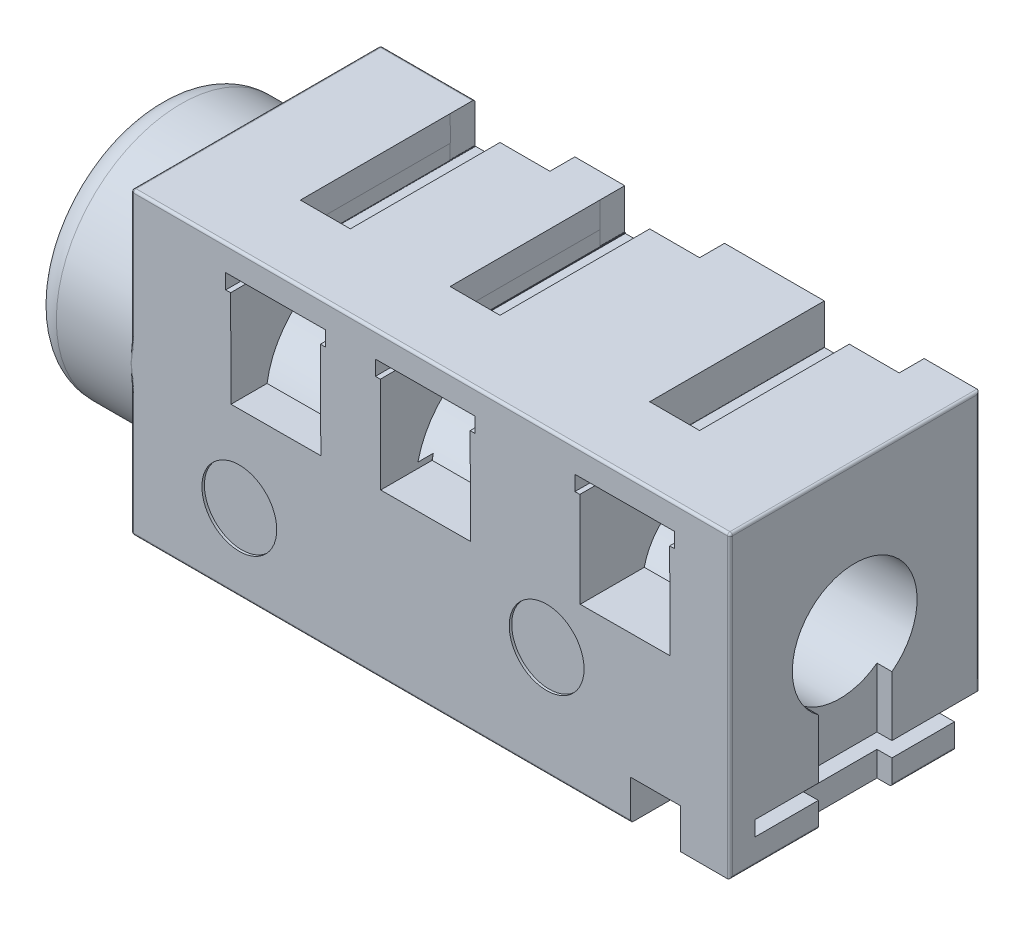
ISO-10303-21;
HEADER;
FILE_DESCRIPTION(('STEP AP214'),'2;1');
FILE_NAME('part.step','',(''),(''),'','','');
FILE_SCHEMA(('AUTOMOTIVE_DESIGN { 1 0 10303 214 1 1 1 1 }'));
ENDSEC;
DATA;
#1=APPLICATION_CONTEXT('core data for automotive mechanical design processes');
#2=APPLICATION_PROTOCOL_DEFINITION('international standard','automotive_design',2000,#1);
#3=PRODUCT_CONTEXT('',#1,'mechanical');
#4=PRODUCT('Part','Part','',(#3));
#5=PRODUCT_RELATED_PRODUCT_CATEGORY('part','',(#4));
#6=PRODUCT_DEFINITION_FORMATION('','',#4);
#7=PRODUCT_DEFINITION_CONTEXT('part definition',#1,'design');
#8=PRODUCT_DEFINITION('design','',#6,#7);
#9=PRODUCT_DEFINITION_SHAPE('','',#8);
#10=(LENGTH_UNIT() NAMED_UNIT(*) SI_UNIT(.MILLI.,.METRE.));
#11=(NAMED_UNIT(*) PLANE_ANGLE_UNIT() SI_UNIT($,.RADIAN.));
#12=(NAMED_UNIT(*) SI_UNIT($,.STERADIAN.) SOLID_ANGLE_UNIT());
#13=UNCERTAINTY_MEASURE_WITH_UNIT(LENGTH_MEASURE(1.E-05),#10,'distance_accuracy_value','');
#14=(GEOMETRIC_REPRESENTATION_CONTEXT(3) GLOBAL_UNCERTAINTY_ASSIGNED_CONTEXT((#13)) GLOBAL_UNIT_ASSIGNED_CONTEXT((#10,
#11,#12)) REPRESENTATION_CONTEXT('',''));
#15=CARTESIAN_POINT('',(0.,0.,0.));
#16=DIRECTION('',(0.,0.,1.));
#17=DIRECTION('',(1.,0.,0.));
#18=AXIS2_PLACEMENT_3D('',#15,#16,#17);
#19=CARTESIAN_POINT('',(6.,3.,5.));
#20=DIRECTION('',(1.,0.,0.));
#21=DIRECTION('',(0.,1.,0.));
#22=AXIS2_PLACEMENT_3D('',#19,#20,#21);
#23=PLANE('',#22);
#24=DIRECTION('',(0.,-1.,0.));
#25=VECTOR('',#24,1.);
#26=CARTESIAN_POINT('',(6.,-0.105337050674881,3.22845210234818));
#27=LINE('',#26,#25);
#28=CARTESIAN_POINT('',(6.,-1.01580388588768,3.22845210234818));
#29=VERTEX_POINT('',#28);
#30=CARTESIAN_POINT('',(6.,-2.20001705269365,3.22845210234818));
#31=VERTEX_POINT('',#30);
#32=EDGE_CURVE('E654',#29,#31,#27,.T.);
#33=ORIENTED_EDGE('',*,*,#32,.F.);
#34=CARTESIAN_POINT('',(6.,0.,2.5));
#35=DIRECTION('',(1.,0.,0.));
#36=DIRECTION('',(0.,1.,0.));
#37=AXIS2_PLACEMENT_3D('',#34,#35,#36);
#38=CIRCLE('',#37,1.25);
#39=CARTESIAN_POINT('',(6.,-1.00320356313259,1.75429053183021));
#40=VERTEX_POINT('',#39);
#41=EDGE_CURVE('E669',#40,#29,#38,.T.);
#42=ORIENTED_EDGE('',*,*,#41,.F.);
#43=DIRECTION('',(0.,1.,0.));
#44=VECTOR('',#43,1.);
#45=CARTESIAN_POINT('',(6.,-0.105337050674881,1.75429053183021));
#46=LINE('',#45,#44);
#47=CARTESIAN_POINT('',(6.,-2.20001705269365,1.7542905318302));
#48=VERTEX_POINT('',#47);
#49=EDGE_CURVE('E673',#48,#40,#46,.T.);
#50=ORIENTED_EDGE('',*,*,#49,.F.);
#51=DIRECTION('',(0.,0.,1.));
#52=VECTOR('',#51,1.);
#53=CARTESIAN_POINT('',(6.,-2.20001705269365,5.));
#54=LINE('',#53,#52);
#55=CARTESIAN_POINT('',(6.,-2.20001705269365,0.0499999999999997));
#56=VERTEX_POINT('',#55);
#57=EDGE_CURVE('E919',#56,#48,#54,.T.);
#58=ORIENTED_EDGE('',*,*,#57,.F.);
#59=DIRECTION('',(0.,-1.,0.));
#60=VECTOR('',#59,1.);
#61=CARTESIAN_POINT('',(6.,3.,0.05));
#62=LINE('',#61,#60);
#63=CARTESIAN_POINT('',(6.,2.95,0.05));
#64=VERTEX_POINT('',#63);
#65=EDGE_CURVE('E1257',#56,#64,#62,.F.);
#66=ORIENTED_EDGE('',*,*,#65,.T.);
#67=DIRECTION('',(0.,0.,-1.));
#68=VECTOR('',#67,1.);
#69=CARTESIAN_POINT('',(6.,2.95,5.));
#70=LINE('',#69,#68);
#71=CARTESIAN_POINT('',(6.,2.95,4.95));
#72=VERTEX_POINT('',#71);
#73=EDGE_CURVE('E1250',#64,#72,#70,.F.);
#74=ORIENTED_EDGE('',*,*,#73,.T.);
#75=DIRECTION('',(0.,-1.,0.));
#76=VECTOR('',#75,1.);
#77=CARTESIAN_POINT('',(6.,3.,4.95));
#78=LINE('',#77,#76);
#79=CARTESIAN_POINT('',(6.,-2.95,4.95));
#80=VERTEX_POINT('',#79);
#81=EDGE_CURVE('E1244',#72,#80,#78,.T.);
#82=ORIENTED_EDGE('',*,*,#81,.T.);
#83=DIRECTION('',(0.,0.,-1.));
#84=VECTOR('',#83,1.);
#85=CARTESIAN_POINT('',(6.,-2.95,0.5));
#86=LINE('',#85,#84);
#87=CARTESIAN_POINT('',(6.,-2.95,3.22845210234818));
#88=VERTEX_POINT('',#87);
#89=EDGE_CURVE('E1243',#80,#88,#86,.T.);
#90=ORIENTED_EDGE('',*,*,#89,.T.);
#91=CARTESIAN_POINT('',(6.,-2.50001937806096,3.22845210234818));
#92=VERTEX_POINT('',#91);
#93=EDGE_CURVE('E674',#92,#88,#27,.T.);
#94=ORIENTED_EDGE('',*,*,#93,.F.);
#95=DIRECTION('',(0.,0.,-1.));
#96=VECTOR('',#95,1.);
#97=CARTESIAN_POINT('',(6.,-2.50001937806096,5.));
#98=LINE('',#97,#96);
#99=CARTESIAN_POINT('',(6.,-2.50001937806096,4.5));
#100=VERTEX_POINT('',#99);
#101=EDGE_CURVE('E1502',#100,#92,#98,.T.);
#102=ORIENTED_EDGE('',*,*,#101,.F.);
#103=DIRECTION('',(0.,-1.,0.));
#104=VECTOR('',#103,1.);
#105=CARTESIAN_POINT('',(6.,3.,4.5));
#106=LINE('',#105,#104);
#107=CARTESIAN_POINT('',(6.,-2.20001705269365,4.5));
#108=VERTEX_POINT('',#107);
#109=EDGE_CURVE('E1073',#108,#100,#106,.T.);
#110=ORIENTED_EDGE('',*,*,#109,.F.);
#111=EDGE_CURVE('E671',#31,#108,#54,.T.);
#112=ORIENTED_EDGE('',*,*,#111,.F.);
#113=EDGE_LOOP('',(#33,#42,#50,#58,#66,#74,#82,#90,#94,#102,#110,#112));
#114=FACE_BOUND('',#113,.T.);
#115=ADVANCED_FACE('F50',(#114),#23,.T.);
#116=CARTESIAN_POINT('',(5.95,-2.95,5.));
#117=DIRECTION('',(0.,0.,1.));
#118=DIRECTION('',(1.,0.,0.));
#119=AXIS2_PLACEMENT_3D('',#116,#117,#118);
#120=CYLINDRICAL_SURFACE('',#119,0.05);
#121=CARTESIAN_POINT('',(5.95,-2.95,3.22845210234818));
#122=DIRECTION('',(0.,0.,1.));
#123=DIRECTION('',(0.,-1.,0.));
#124=AXIS2_PLACEMENT_3D('',#121,#122,#123);
#125=CIRCLE('',#124,0.05);
#126=CARTESIAN_POINT('',(5.95,-3.,3.22845210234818));
#127=VERTEX_POINT('',#126);
#128=EDGE_CURVE('E1182',#88,#127,#125,.F.);
#129=ORIENTED_EDGE('',*,*,#128,.F.);
#130=ORIENTED_EDGE('',*,*,#89,.F.);
#131=CARTESIAN_POINT('',(5.95,-2.95,4.95));
#132=DIRECTION('',(0.,-0.707106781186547,-0.707106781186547));
#133=DIRECTION('',(0.,-0.707106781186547,0.707106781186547));
#134=AXIS2_PLACEMENT_3D('',#131,#132,#133);
#135=ELLIPSE('',#134,0.0707106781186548,0.05);
#136=CARTESIAN_POINT('',(5.95,-3.,5.));
#137=VERTEX_POINT('',#136);
#138=EDGE_CURVE('E2061',#137,#80,#135,.F.);
#139=ORIENTED_EDGE('',*,*,#138,.F.);
#140=DIRECTION('',(0.,0.,-1.));
#141=VECTOR('',#140,1.);
#142=CARTESIAN_POINT('',(5.95,-3.,5.));
#143=LINE('',#142,#141);
#144=EDGE_CURVE('E1274',#127,#137,#143,.F.);
#145=ORIENTED_EDGE('',*,*,#144,.F.);
#146=EDGE_LOOP('',(#129,#130,#139,#145));
#147=FACE_BOUND('',#146,.T.);
#148=ADVANCED_FACE('F1206',(#147),#120,.T.);
#149=CARTESIAN_POINT('',(-3.09993376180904,2.1885987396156,3.5));
#150=DIRECTION('',(0.99994209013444,0.0107618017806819,0.));
#151=DIRECTION('',(-0.0107618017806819,0.99994209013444,0.));
#152=AXIS2_PLACEMENT_3D('',#149,#150,#151);
#153=PLANE('',#152);
#154=DIRECTION('',(0.0107618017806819,-0.99994209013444,0.));
#155=VECTOR('',#154,1.);
#156=CARTESIAN_POINT('',(-3.09993376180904,2.1885987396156,3.));
#157=LINE('',#156,#155);
#158=CARTESIAN_POINT('',(-3.10001445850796,2.19609674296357,3.));
#159=VERTEX_POINT('',#158);
#160=CARTESIAN_POINT('',(-3.09993376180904,2.1885987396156,3.));
#161=VERTEX_POINT('',#160);
#162=EDGE_CURVE('E1529',#159,#161,#157,.T.);
#163=ORIENTED_EDGE('',*,*,#162,.F.);
#164=DIRECTION('',(0.,0.,-1.));
#165=VECTOR('',#164,1.);
#166=CARTESIAN_POINT('',(-3.10001445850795,2.19609674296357,3.5));
#167=LINE('',#166,#165);
#168=CARTESIAN_POINT('',(-3.10001445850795,2.19609674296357,0.));
#169=VERTEX_POINT('',#168);
#170=EDGE_CURVE('E1827',#159,#169,#167,.T.);
#171=ORIENTED_EDGE('',*,*,#170,.T.);
#172=DIRECTION('',(0.0107618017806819,-0.99994209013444,0.));
#173=VECTOR('',#172,1.);
#174=CARTESIAN_POINT('',(-3.09993376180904,2.1885987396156,0.));
#175=LINE('',#174,#173);
#176=CARTESIAN_POINT('',(-3.09993376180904,2.1885987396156,0.));
#177=VERTEX_POINT('',#176);
#178=EDGE_CURVE('E688',#169,#177,#175,.T.);
#179=ORIENTED_EDGE('',*,*,#178,.T.);
#180=DIRECTION('',(0.,0.,-1.));
#181=VECTOR('',#180,1.);
#182=CARTESIAN_POINT('',(-3.09993376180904,2.1885987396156,3.5));
#183=LINE('',#182,#181);
#184=EDGE_CURVE('E776',#161,#177,#183,.T.);
#185=ORIENTED_EDGE('',*,*,#184,.F.);
#186=EDGE_LOOP('',(#163,#171,#179,#185));
#187=FACE_BOUND('',#186,.T.);
#188=ADVANCED_FACE('F1211',(#187),#153,.F.);
#189=CARTESIAN_POINT('',(0.891333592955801,2.2,5.));
#190=DIRECTION('',(0.00393729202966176,-0.999992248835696,0.));
#191=DIRECTION('',(0.999992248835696,0.00393729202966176,0.));
#192=AXIS2_PLACEMENT_3D('',#189,#190,#191);
#193=PLANE('',#192);
#194=DIRECTION('',(-0.999992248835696,-0.00393729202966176,0.));
#195=VECTOR('',#194,1.);
#196=CARTESIAN_POINT('',(0.891333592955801,2.2,5.));
#197=LINE('',#196,#195);
#198=CARTESIAN_POINT('',(-1.00712407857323,2.19252515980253,5.));
#199=VERTEX_POINT('',#198);
#200=CARTESIAN_POINT('',(-1.10559570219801,2.19213744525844,5.));
#201=VERTEX_POINT('',#200);
#202=EDGE_CURVE('E1700',#199,#201,#197,.T.);
#203=ORIENTED_EDGE('',*,*,#202,.F.);
#204=DIRECTION('',(0.,0.,-1.));
#205=VECTOR('',#204,1.);
#206=CARTESIAN_POINT('',(-1.00712407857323,2.19252515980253,5.));
#207=LINE('',#206,#205);
#208=CARTESIAN_POINT('',(-1.00712407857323,2.19252515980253,3.5));
#209=VERTEX_POINT('',#208);
#210=EDGE_CURVE('E1046',#199,#209,#207,.T.);
#211=ORIENTED_EDGE('',*,*,#210,.T.);
#212=DIRECTION('',(0.999992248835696,0.00393729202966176,0.));
#213=VECTOR('',#212,1.);
#214=CARTESIAN_POINT('',(-0.00864815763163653,2.19645648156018,3.5));
#215=LINE('',#214,#213);
#216=CARTESIAN_POINT('',(-1.09712924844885,2.19217078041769,3.5));
#217=VERTEX_POINT('',#216);
#218=EDGE_CURVE('E1004',#217,#209,#215,.T.);
#219=ORIENTED_EDGE('',*,*,#218,.F.);
#220=DIRECTION('',(0.,0.,1.));
#221=VECTOR('',#220,1.);
#222=CARTESIAN_POINT('',(-1.09712924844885,2.19217078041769,3.5));
#223=LINE('',#222,#221);
#224=CARTESIAN_POINT('',(-1.09712924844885,2.19217078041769,0.));
#225=VERTEX_POINT('',#224);
#226=EDGE_CURVE('E1802',#225,#217,#223,.T.);
#227=ORIENTED_EDGE('',*,*,#226,.F.);
#228=DIRECTION('',(-0.999992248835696,-0.00393729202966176,0.));
#229=VECTOR('',#228,1.);
#230=CARTESIAN_POINT('',(0.891333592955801,2.2,0.));
#231=LINE('',#230,#229);
#232=CARTESIAN_POINT('',(-1.10559570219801,2.19213744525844,0.));
#233=VERTEX_POINT('',#232);
#234=EDGE_CURVE('E1718',#225,#233,#231,.T.);
#235=ORIENTED_EDGE('',*,*,#234,.T.);
#236=DIRECTION('',(0.,0.,-1.));
#237=VECTOR('',#236,1.);
#238=CARTESIAN_POINT('',(-1.10559570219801,2.19213744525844,5.));
#239=LINE('',#238,#237);
#240=EDGE_CURVE('E1712',#201,#233,#239,.T.);
#241=ORIENTED_EDGE('',*,*,#240,.F.);
#242=EDGE_LOOP('',(#203,#211,#219,#227,#235,#241));
#243=FACE_BOUND('',#242,.T.);
#244=ADVANCED_FACE('F1877',(#243),#193,.F.);
#245=CARTESIAN_POINT('',(-2.1086664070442,2.2,5.));
#246=DIRECTION('',(0.00393729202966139,-0.999992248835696,0.));
#247=DIRECTION('',(0.999992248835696,0.00393729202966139,0.));
#248=AXIS2_PLACEMENT_3D('',#245,#246,#247);
#249=PLANE('',#248);
#250=DIRECTION('',(-0.999992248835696,-0.00393729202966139,0.));
#251=VECTOR('',#250,1.);
#252=CARTESIAN_POINT('',(-2.1086664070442,2.2,5.));
#253=LINE('',#252,#251);
#254=CARTESIAN_POINT('',(-4.00714733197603,2.19252506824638,5.));
#255=VERTEX_POINT('',#254);
#256=CARTESIAN_POINT('',(-4.1056422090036,2.19213726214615,5.));
#257=VERTEX_POINT('',#256);
#258=EDGE_CURVE('E1740',#255,#257,#253,.T.);
#259=ORIENTED_EDGE('',*,*,#258,.F.);
#260=DIRECTION('',(0.,0.,-1.));
#261=VECTOR('',#260,1.);
#262=CARTESIAN_POINT('',(-4.00714733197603,2.19252506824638,5.));
#263=LINE('',#262,#261);
#264=CARTESIAN_POINT('',(-4.00714733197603,2.19252506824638,3.5));
#265=VERTEX_POINT('',#264);
#266=EDGE_CURVE('E1034',#255,#265,#263,.T.);
#267=ORIENTED_EDGE('',*,*,#266,.T.);
#268=DIRECTION('',(0.999992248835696,0.00393729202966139,0.));
#269=VECTOR('',#268,1.);
#270=CARTESIAN_POINT('',(-0.00869466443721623,2.20826826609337,3.5));
#271=LINE('',#270,#269);
#272=CARTESIAN_POINT('',(-4.09698445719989,2.19217135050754,3.5));
#273=VERTEX_POINT('',#272);
#274=EDGE_CURVE('E1012',#273,#265,#271,.T.);
#275=ORIENTED_EDGE('',*,*,#274,.F.);
#276=DIRECTION('',(0.,0.,1.));
#277=VECTOR('',#276,1.);
#278=CARTESIAN_POINT('',(-4.09698445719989,2.19217135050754,3.5));
#279=LINE('',#278,#277);
#280=CARTESIAN_POINT('',(-4.09698445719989,2.19217135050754,0.));
#281=VERTEX_POINT('',#280);
#282=EDGE_CURVE('E1823',#281,#273,#279,.T.);
#283=ORIENTED_EDGE('',*,*,#282,.F.);
#284=DIRECTION('',(-0.999992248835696,-0.00393729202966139,0.));
#285=VECTOR('',#284,1.);
#286=CARTESIAN_POINT('',(-2.1086664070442,2.2,0.));
#287=LINE('',#286,#285);
#288=CARTESIAN_POINT('',(-4.1056422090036,2.19213726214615,0.));
#289=VERTEX_POINT('',#288);
#290=EDGE_CURVE('E1653',#281,#289,#287,.T.);
#291=ORIENTED_EDGE('',*,*,#290,.T.);
#292=DIRECTION('',(0.,0.,-1.));
#293=VECTOR('',#292,1.);
#294=CARTESIAN_POINT('',(-4.1056422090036,2.19213726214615,5.));
#295=LINE('',#294,#293);
#296=EDGE_CURVE('E1752',#257,#289,#295,.T.);
#297=ORIENTED_EDGE('',*,*,#296,.F.);
#298=EDGE_LOOP('',(#259,#267,#275,#283,#291,#297));
#299=FACE_BOUND('',#298,.T.);
#300=ADVANCED_FACE('F2569',(#299),#249,.F.);
#301=CARTESIAN_POINT('',(-4.09693279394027,2.1885987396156,3.5));
#302=DIRECTION('',(-0.999895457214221,-0.0144594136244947,0.));
#303=DIRECTION('',(0.0144594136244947,-0.999895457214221,0.));
#304=AXIS2_PLACEMENT_3D('',#301,#302,#303);
#305=PLANE('',#304);
#306=DIRECTION('',(-0.0144594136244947,0.999895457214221,0.));
#307=VECTOR('',#306,1.);
#308=CARTESIAN_POINT('',(-4.09693279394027,2.1885987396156,0.));
#309=LINE('',#308,#307);
#310=CARTESIAN_POINT('',(-4.09693279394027,2.1885987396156,0.));
#311=VERTEX_POINT('',#310);
#312=EDGE_CURVE('E764',#311,#281,#309,.T.);
#313=ORIENTED_EDGE('',*,*,#312,.T.);
#314=ORIENTED_EDGE('',*,*,#282,.T.);
#315=DIRECTION('',(-0.0144594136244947,0.999895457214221,0.));
#316=VECTOR('',#315,1.);
#317=CARTESIAN_POINT('',(-4.09693279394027,2.1885987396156,3.5));
#318=LINE('',#317,#316);
#319=CARTESIAN_POINT('',(-4.09693279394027,2.1885987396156,3.5));
#320=VERTEX_POINT('',#319);
#321=EDGE_CURVE('E768',#320,#273,#318,.T.);
#322=ORIENTED_EDGE('',*,*,#321,.F.);
#323=DIRECTION('',(0.,0.,-1.));
#324=VECTOR('',#323,1.);
#325=CARTESIAN_POINT('',(-4.09693279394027,2.1885987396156,3.5));
#326=LINE('',#325,#324);
#327=EDGE_CURVE('E793',#320,#311,#326,.T.);
#328=ORIENTED_EDGE('',*,*,#327,.T.);
#329=EDGE_LOOP('',(#313,#314,#322,#328));
#330=FACE_BOUND('',#329,.T.);
#331=ADVANCED_FACE('F2609',(#330),#305,.F.);
#332=CARTESIAN_POINT('',(0.,0.,3.5));
#333=DIRECTION('',(0.,0.,1.));
#334=DIRECTION('',(1.,0.,0.));
#335=AXIS2_PLACEMENT_3D('',#332,#333,#334);
#336=PLANE('',#335);
#337=ORIENTED_EDGE('',*,*,#274,.T.);
#338=DIRECTION('',(0.0039372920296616,-0.999992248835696,0.));
#339=VECTOR('',#338,1.);
#340=CARTESIAN_POINT('',(-3.99845266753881,-0.0157431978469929,3.5));
#341=LINE('',#340,#339);
#342=CARTESIAN_POINT('',(-4.00713187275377,2.1885987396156,3.5));
#343=VERTEX_POINT('',#342);
#344=EDGE_CURVE('E1589',#265,#343,#341,.T.);
#345=ORIENTED_EDGE('',*,*,#344,.T.);
#346=DIRECTION('',(-1.,0.,0.));
#347=VECTOR('',#346,1.);
#348=CARTESIAN_POINT('',(-3.09993376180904,2.1885987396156,3.5));
#349=LINE('',#348,#347);
#350=EDGE_CURVE('E763',#343,#320,#349,.T.);
#351=ORIENTED_EDGE('',*,*,#350,.T.);
#352=ORIENTED_EDGE('',*,*,#321,.T.);
#353=EDGE_LOOP('',(#337,#345,#351,#352));
#354=FACE_BOUND('',#353,.T.);
#355=ADVANCED_FACE('F2603',(#354),#336,.F.);
#356=CARTESIAN_POINT('',(-0.0999570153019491,2.17678686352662,3.5));
#357=DIRECTION('',(0.99994403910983,0.0105791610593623,0.));
#358=DIRECTION('',(-0.0105791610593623,0.99994403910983,0.));
#359=AXIS2_PLACEMENT_3D('',#356,#357,#358);
#360=PLANE('',#359);
#361=DIRECTION('',(0.,0.,-1.));
#362=VECTOR('',#361,1.);
#363=CARTESIAN_POINT('',(-0.0999570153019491,2.17678686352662,3.5));
#364=LINE('',#363,#362);
#365=CARTESIAN_POINT('',(-0.0999570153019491,2.17678686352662,3.));
#366=VERTEX_POINT('',#365);
#367=CARTESIAN_POINT('',(-0.0999570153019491,2.17678686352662,0.));
#368=VERTEX_POINT('',#367);
#369=EDGE_CURVE('E734',#366,#368,#364,.T.);
#370=ORIENTED_EDGE('',*,*,#369,.F.);
#371=DIRECTION('',(-0.0105791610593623,0.99994403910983,0.));
#372=VECTOR('',#371,1.);
#373=CARTESIAN_POINT('',(-0.0999570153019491,2.17678686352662,3.));
#374=LINE('',#373,#372);
#375=CARTESIAN_POINT('',(-0.100161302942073,2.19609616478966,3.));
#376=VERTEX_POINT('',#375);
#377=EDGE_CURVE('E1601',#366,#376,#374,.T.);
#378=ORIENTED_EDGE('',*,*,#377,.T.);
#379=DIRECTION('',(0.,0.,-1.));
#380=VECTOR('',#379,1.);
#381=CARTESIAN_POINT('',(-0.100161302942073,2.19609616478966,3.5));
#382=LINE('',#381,#380);
#383=CARTESIAN_POINT('',(-0.100161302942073,2.19609616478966,0.));
#384=VERTEX_POINT('',#383);
#385=EDGE_CURVE('E1806',#376,#384,#382,.T.);
#386=ORIENTED_EDGE('',*,*,#385,.T.);
#387=DIRECTION('',(0.0105791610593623,-0.999944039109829,0.));
#388=VECTOR('',#387,1.);
#389=CARTESIAN_POINT('',(-0.0999570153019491,2.17678686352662,0.));
#390=LINE('',#389,#388);
#391=EDGE_CURVE('E735',#384,#368,#390,.T.);
#392=ORIENTED_EDGE('',*,*,#391,.T.);
#393=EDGE_LOOP('',(#370,#378,#386,#392));
#394=FACE_BOUND('',#393,.T.);
#395=ADVANCED_FACE('F2598',(#394),#360,.F.);
#396=CARTESIAN_POINT('',(-1.09690954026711,2.17678686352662,3.5));
#397=DIRECTION('',(-0.999898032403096,-0.0142802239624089,0.));
#398=DIRECTION('',(0.0142802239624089,-0.999898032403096,0.));
#399=AXIS2_PLACEMENT_3D('',#396,#397,#398);
#400=PLANE('',#399);
#401=DIRECTION('',(-0.0142802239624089,0.999898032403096,0.));
#402=VECTOR('',#401,1.);
#403=CARTESIAN_POINT('',(-1.09690954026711,2.17678686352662,0.));
#404=LINE('',#403,#402);
#405=CARTESIAN_POINT('',(-1.09690954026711,2.17678686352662,0.));
#406=VERTEX_POINT('',#405);
#407=EDGE_CURVE('E722',#406,#225,#404,.T.);
#408=ORIENTED_EDGE('',*,*,#407,.T.);
#409=ORIENTED_EDGE('',*,*,#226,.T.);
#410=DIRECTION('',(-0.0142802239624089,0.999898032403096,0.));
#411=VECTOR('',#410,1.);
#412=CARTESIAN_POINT('',(-1.09690954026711,2.17678686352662,3.5));
#413=LINE('',#412,#411);
#414=CARTESIAN_POINT('',(-1.09690954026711,2.17678686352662,3.5));
#415=VERTEX_POINT('',#414);
#416=EDGE_CURVE('E726',#415,#217,#413,.T.);
#417=ORIENTED_EDGE('',*,*,#416,.F.);
#418=DIRECTION('',(0.,0.,-1.));
#419=VECTOR('',#418,1.);
#420=CARTESIAN_POINT('',(-1.09690954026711,2.17678686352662,3.5));
#421=LINE('',#420,#419);
#422=EDGE_CURVE('E754',#415,#406,#421,.T.);
#423=ORIENTED_EDGE('',*,*,#422,.T.);
#424=EDGE_LOOP('',(#408,#409,#417,#423));
#425=FACE_BOUND('',#424,.T.);
#426=ADVANCED_FACE('F2590',(#425),#400,.F.);
#427=CARTESIAN_POINT('',(0.,0.,3.5));
#428=DIRECTION('',(0.,0.,1.));
#429=DIRECTION('',(1.,0.,0.));
#430=AXIS2_PLACEMENT_3D('',#427,#428,#429);
#431=PLANE('',#430);
#432=ORIENTED_EDGE('',*,*,#218,.T.);
#433=DIRECTION('',(0.00393729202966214,-0.999992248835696,0.));
#434=VECTOR('',#433,1.);
#435=CARTESIAN_POINT('',(-0.998475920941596,-0.00393132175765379,3.5));
#436=LINE('',#435,#434);
#437=CARTESIAN_POINT('',(-1.00706211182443,2.17678686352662,3.5));
#438=VERTEX_POINT('',#437);
#439=EDGE_CURVE('E1623',#209,#438,#436,.T.);
#440=ORIENTED_EDGE('',*,*,#439,.T.);
#441=DIRECTION('',(-1.,0.,0.));
#442=VECTOR('',#441,1.);
#443=CARTESIAN_POINT('',(-0.0999570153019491,2.17678686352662,3.5));
#444=LINE('',#443,#442);
#445=EDGE_CURVE('E721',#438,#415,#444,.T.);
#446=ORIENTED_EDGE('',*,*,#445,.T.);
#447=ORIENTED_EDGE('',*,*,#416,.T.);
#448=EDGE_LOOP('',(#432,#440,#446,#447));
#449=FACE_BOUND('',#448,.T.);
#450=ADVANCED_FACE('F2586',(#449),#431,.F.);
#451=CARTESIAN_POINT('',(0.,0.,3.5));
#452=DIRECTION('',(0.,0.,-1.));
#453=DIRECTION('',(-1.,0.,0.));
#454=AXIS2_PLACEMENT_3D('',#451,#452,#453);
#455=PLANE('',#454);
#456=DIRECTION('',(0.999992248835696,0.00393729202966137,0.));
#457=VECTOR('',#456,1.);
#458=CARTESIAN_POINT('',(-0.00976310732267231,2.47963106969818,3.5));
#459=LINE('',#458,#457);
#460=CARTESIAN_POINT('',(2.8913335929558,2.49105362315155,3.5));
#461=VERTEX_POINT('',#460);
#462=CARTESIAN_POINT('',(3.8913335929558,2.49499094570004,3.5));
#463=VERTEX_POINT('',#462);
#464=EDGE_CURVE('E997',#461,#463,#459,.T.);
#465=ORIENTED_EDGE('',*,*,#464,.F.);
#466=DIRECTION('',(0.,1.,0.));
#467=VECTOR('',#466,1.);
#468=CARTESIAN_POINT('',(2.8913335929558,2.19892594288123,3.5));
#469=LINE('',#468,#467);
#470=CARTESIAN_POINT('',(2.8913335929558,3.,3.5));
#471=VERTEX_POINT('',#470);
#472=EDGE_CURVE('E707',#461,#471,#469,.T.);
#473=ORIENTED_EDGE('',*,*,#472,.T.);
#474=DIRECTION('',(1.,0.,0.));
#475=VECTOR('',#474,1.);
#476=CARTESIAN_POINT('',(3.8913335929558,3.,3.5));
#477=LINE('',#476,#475);
#478=CARTESIAN_POINT('',(3.8913335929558,3.,3.5));
#479=VERTEX_POINT('',#478);
#480=EDGE_CURVE('E695',#471,#479,#477,.T.);
#481=ORIENTED_EDGE('',*,*,#480,.T.);
#482=DIRECTION('',(0.,-1.,0.));
#483=VECTOR('',#482,1.);
#484=CARTESIAN_POINT('',(3.8913335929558,2.19892594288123,3.5));
#485=LINE('',#484,#483);
#486=EDGE_CURVE('E699',#479,#463,#485,.T.);
#487=ORIENTED_EDGE('',*,*,#486,.T.);
#488=EDGE_LOOP('',(#465,#473,#481,#487));
#489=FACE_BOUND('',#488,.T.);
#490=ADVANCED_FACE('F2577',(#489),#455,.T.);
#491=CARTESIAN_POINT('',(0.,0.,0.5));
#492=DIRECTION('',(0.,0.,1.));
#493=DIRECTION('',(1.,0.,0.));
#494=AXIS2_PLACEMENT_3D('',#491,#492,#493);
#495=PLANE('',#494);
#496=DIRECTION('',(0.,-1.,0.));
#497=VECTOR('',#496,1.);
#498=CARTESIAN_POINT('',(0.891333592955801,3.,0.5));
#499=LINE('',#498,#497);
#500=CARTESIAN_POINT('',(0.891333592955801,3.,0.5));
#501=VERTEX_POINT('',#500);
#502=CARTESIAN_POINT('',(0.891333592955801,2.2,0.5));
#503=VERTEX_POINT('',#502);
#504=EDGE_CURVE('E819',#501,#503,#499,.T.);
#505=ORIENTED_EDGE('',*,*,#504,.T.);
#506=DIRECTION('',(-0.00393729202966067,0.999992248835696,0.));
#507=VECTOR('',#506,1.);
#508=CARTESIAN_POINT('',(0.899981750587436,0.00354351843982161,0.5));
#509=LINE('',#508,#507);
#510=CARTESIAN_POINT('',(0.890152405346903,2.49999767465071,0.5));
#511=VERTEX_POINT('',#510);
#512=EDGE_CURVE('E682',#503,#511,#509,.T.);
#513=ORIENTED_EDGE('',*,*,#512,.T.);
#514=DIRECTION('',(-0.999992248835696,-0.00393729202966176,0.));
#515=VECTOR('',#514,1.);
#516=CARTESIAN_POINT('',(-0.00982934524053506,2.49645415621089,0.5));
#517=LINE('',#516,#515);
#518=CARTESIAN_POINT('',(-0.103335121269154,2.49608599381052,0.5));
#519=VERTEX_POINT('',#518);
#520=EDGE_CURVE('E1798',#511,#519,#517,.T.);
#521=ORIENTED_EDGE('',*,*,#520,.T.);
#522=DIRECTION('',(-0.0105791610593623,0.99994403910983,0.));
#523=VECTOR('',#522,1.);
#524=CARTESIAN_POINT('',(-0.0769185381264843,-0.000813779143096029,0.5));
#525=LINE('',#524,#523);
#526=CARTESIAN_POINT('',(-0.108666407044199,3.00000000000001,0.5));
#527=VERTEX_POINT('',#526);
#528=EDGE_CURVE('E988',#519,#527,#525,.T.);
#529=ORIENTED_EDGE('',*,*,#528,.T.);
#530=DIRECTION('',(1.,0.,0.));
#531=VECTOR('',#530,1.);
#532=CARTESIAN_POINT('',(-1.1086664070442,3.00000000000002,0.5));
#533=LINE('',#532,#531);
#534=EDGE_CURVE('E815',#527,#501,#533,.T.);
#535=ORIENTED_EDGE('',*,*,#534,.T.);
#536=EDGE_LOOP('',(#505,#513,#521,#529,#535));
#537=FACE_BOUND('',#536,.T.);
#538=ADVANCED_FACE('F2628',(#537),#495,.F.);
#539=CARTESIAN_POINT('',(0.,0.,0.5));
#540=DIRECTION('',(0.,0.,-1.));
#541=DIRECTION('',(-1.,0.,0.));
#542=AXIS2_PLACEMENT_3D('',#539,#540,#541);
#543=PLANE('',#542);
#544=DIRECTION('',(0.00393729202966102,-0.999992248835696,0.));
#545=VECTOR('',#544,1.);
#546=CARTESIAN_POINT('',(-2.09997174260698,-0.00826826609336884,0.5));
#547=LINE('',#546,#545);
#548=CARTESIAN_POINT('',(-2.1098475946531,2.49999767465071,0.5));
#549=VERTEX_POINT('',#548);
#550=CARTESIAN_POINT('',(-2.1086664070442,2.2,0.5));
#551=VERTEX_POINT('',#550);
#552=EDGE_CURVE('E1834',#549,#551,#547,.T.);
#553=ORIENTED_EDGE('',*,*,#552,.F.);
#554=DIRECTION('',(0.999992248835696,0.00393729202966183,0.));
#555=VECTOR('',#554,1.);
#556=CARTESIAN_POINT('',(-0.00987585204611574,2.50826594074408,0.5));
#557=LINE('',#556,#555);
#558=CARTESIAN_POINT('',(-3.10324307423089,2.4960863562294,0.5));
#559=VERTEX_POINT('',#558);
#560=EDGE_CURVE('E1820',#559,#549,#557,.T.);
#561=ORIENTED_EDGE('',*,*,#560,.F.);
#562=DIRECTION('',(0.0107618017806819,-0.99994209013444,0.));
#563=VECTOR('',#562,1.);
#564=CARTESIAN_POINT('',(-3.07602283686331,-0.0331054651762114,0.5));
#565=LINE('',#564,#563);
#566=CARTESIAN_POINT('',(-3.1086664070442,3.,0.5));
#567=VERTEX_POINT('',#566);
#568=EDGE_CURVE('E980',#567,#559,#565,.T.);
#569=ORIENTED_EDGE('',*,*,#568,.F.);
#570=DIRECTION('',(1.,0.,0.));
#571=VECTOR('',#570,1.);
#572=CARTESIAN_POINT('',(-4.1086664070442,3.,0.5));
#573=LINE('',#572,#571);
#574=CARTESIAN_POINT('',(-2.1086664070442,3.,0.5));
#575=VERTEX_POINT('',#574);
#576=EDGE_CURVE('E849',#567,#575,#573,.T.);
#577=ORIENTED_EDGE('',*,*,#576,.T.);
#578=DIRECTION('',(0.,-1.,0.));
#579=VECTOR('',#578,1.);
#580=CARTESIAN_POINT('',(-2.1086664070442,3.,0.5));
#581=LINE('',#580,#579);
#582=EDGE_CURVE('E852',#575,#551,#581,.T.);
#583=ORIENTED_EDGE('',*,*,#582,.T.);
#584=EDGE_LOOP('',(#553,#561,#569,#577,#583));
#585=FACE_BOUND('',#584,.T.);
#586=ADVANCED_FACE('F2640',(#585),#543,.T.);
#587=CARTESIAN_POINT('',(-6.,3.,5.));
#588=DIRECTION('',(1.,0.,0.));
#589=DIRECTION('',(0.,1.,0.));
#590=AXIS2_PLACEMENT_3D('',#587,#588,#589);
#591=PLANE('',#590);
#592=DIRECTION('',(0.,0.,-1.));
#593=VECTOR('',#592,1.);
#594=CARTESIAN_POINT('',(-6.,2.95,0.));
#595=LINE('',#594,#593);
#596=CARTESIAN_POINT('',(-6.,2.95,4.95));
#597=VERTEX_POINT('',#596);
#598=CARTESIAN_POINT('',(-6.,2.95,0.0499999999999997));
#599=VERTEX_POINT('',#598);
#600=EDGE_CURVE('E1102',#597,#599,#595,.T.);
#601=ORIENTED_EDGE('',*,*,#600,.T.);
#602=DIRECTION('',(0.,-1.,0.));
#603=VECTOR('',#602,1.);
#604=CARTESIAN_POINT('',(-6.,3.,0.0499999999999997));
#605=LINE('',#604,#603);
#606=CARTESIAN_POINT('',(-6.,0.473869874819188,0.0499999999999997));
#607=VERTEX_POINT('',#606);
#608=EDGE_CURVE('E1105',#599,#607,#605,.T.);
#609=ORIENTED_EDGE('',*,*,#608,.T.);
#610=CARTESIAN_POINT('',(-6.,-0.0236238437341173,2.5));
#611=DIRECTION('',(-1.,0.,0.));
#612=DIRECTION('',(0.,0.,1.));
#613=AXIS2_PLACEMENT_3D('',#610,#611,#612);
#614=CIRCLE('',#613,2.5);
#615=CARTESIAN_POINT('',(-6.,0.473869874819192,4.95));
#616=VERTEX_POINT('',#615);
#617=EDGE_CURVE('E949',#616,#607,#614,.T.);
#618=ORIENTED_EDGE('',*,*,#617,.F.);
#619=DIRECTION('',(0.,-1.,0.));
#620=VECTOR('',#619,1.);
#621=CARTESIAN_POINT('',(-6.,3.,4.95));
#622=LINE('',#621,#620);
#623=EDGE_CURVE('E1099',#616,#597,#622,.F.);
#624=ORIENTED_EDGE('',*,*,#623,.T.);
#625=EDGE_LOOP('',(#601,#609,#618,#624));
#626=FACE_BOUND('',#625,.T.);
#627=ADVANCED_FACE('F2408',(#626),#591,.F.);
#628=DIRECTION('',(0.,0.,-1.));
#629=VECTOR('',#628,1.);
#630=CARTESIAN_POINT('',(-6.,-2.95,5.));
#631=LINE('',#630,#629);
#632=CARTESIAN_POINT('',(-6.,-2.95,0.0499999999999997));
#633=VERTEX_POINT('',#632);
#634=CARTESIAN_POINT('',(-6.,-2.95,4.95));
#635=VERTEX_POINT('',#634);
#636=EDGE_CURVE('E2343',#633,#635,#631,.F.);
#637=ORIENTED_EDGE('',*,*,#636,.T.);
#638=DIRECTION('',(0.,-1.,0.));
#639=VECTOR('',#638,1.);
#640=CARTESIAN_POINT('',(-6.,-0.0236238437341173,4.95));
#641=LINE('',#640,#639);
#642=CARTESIAN_POINT('',(-6.,-0.521117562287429,4.95));
#643=VERTEX_POINT('',#642);
#644=EDGE_CURVE('E2373',#635,#643,#641,.F.);
#645=ORIENTED_EDGE('',*,*,#644,.T.);
#646=CARTESIAN_POINT('',(-6.,-0.521117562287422,0.0499999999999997));
#647=VERTEX_POINT('',#646);
#648=EDGE_CURVE('E2158',#647,#643,#614,.T.);
#649=ORIENTED_EDGE('',*,*,#648,.F.);
#650=DIRECTION('',(0.,-1.,0.));
#651=VECTOR('',#650,1.);
#652=CARTESIAN_POINT('',(-6.,3.,0.0499999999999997));
#653=LINE('',#652,#651);
#654=EDGE_CURVE('E1381',#647,#633,#653,.T.);
#655=ORIENTED_EDGE('',*,*,#654,.T.);
#656=EDGE_LOOP('',(#637,#645,#649,#655));
#657=FACE_BOUND('',#656,.T.);
#658=ADVANCED_FACE('F1224',(#657),#591,.F.);
#659=CARTESIAN_POINT('',(-6.,-3.,5.));
#660=DIRECTION('',(0.,1.,0.));
#661=DIRECTION('',(0.,0.,1.));
#662=AXIS2_PLACEMENT_3D('',#659,#660,#661);
#663=PLANE('',#662);
#664=DIRECTION('',(0.,0.,1.));
#665=VECTOR('',#664,1.);
#666=CARTESIAN_POINT('',(5.7,-3.,5.));
#667=LINE('',#666,#665);
#668=CARTESIAN_POINT('',(5.7,-3.,1.7542905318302));
#669=VERTEX_POINT('',#668);
#670=CARTESIAN_POINT('',(5.7,-3.,3.22845210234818));
#671=VERTEX_POINT('',#670);
#672=EDGE_CURVE('E1414',#669,#671,#667,.T.);
#673=ORIENTED_EDGE('',*,*,#672,.T.);
#674=DIRECTION('',(1.,0.,0.));
#675=VECTOR('',#674,1.);
#676=CARTESIAN_POINT('',(-6.,-3.,3.22845210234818));
#677=LINE('',#676,#675);
#678=EDGE_CURVE('E2278',#671,#127,#677,.T.);
#679=ORIENTED_EDGE('',*,*,#678,.T.);
#680=ORIENTED_EDGE('',*,*,#144,.T.);
#681=DIRECTION('',(1.,0.,0.));
#682=VECTOR('',#681,1.);
#683=CARTESIAN_POINT('',(-6.,-3.,5.));
#684=LINE('',#683,#682);
#685=CARTESIAN_POINT('',(5.0118042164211,-3.,5.));
#686=VERTEX_POINT('',#685);
#687=EDGE_CURVE('E952',#686,#137,#684,.T.);
#688=ORIENTED_EDGE('',*,*,#687,.F.);
#689=DIRECTION('',(0.,0.,-1.));
#690=VECTOR('',#689,1.);
#691=CARTESIAN_POINT('',(5.01180421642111,-3.,5.));
#692=LINE('',#691,#690);
#693=CARTESIAN_POINT('',(5.0118042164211,-3.,3.));
#694=VERTEX_POINT('',#693);
#695=EDGE_CURVE('E1476',#686,#694,#692,.T.);
#696=ORIENTED_EDGE('',*,*,#695,.T.);
#697=DIRECTION('',(1.,0.,0.));
#698=VECTOR('',#697,1.);
#699=CARTESIAN_POINT('',(-6.,-3.,3.));
#700=LINE('',#699,#698);
#701=CARTESIAN_POINT('',(4.01179646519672,-3.,3.));
#702=VERTEX_POINT('',#701);
#703=EDGE_CURVE('E1484',#702,#694,#700,.T.);
#704=ORIENTED_EDGE('',*,*,#703,.F.);
#705=DIRECTION('',(0.,0.,1.));
#706=VECTOR('',#705,1.);
#707=CARTESIAN_POINT('',(4.01179646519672,-3.,5.));
#708=LINE('',#707,#706);
#709=CARTESIAN_POINT('',(4.01179646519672,-3.,4.95));
#710=VERTEX_POINT('',#709);
#711=EDGE_CURVE('E1480',#702,#710,#708,.T.);
#712=ORIENTED_EDGE('',*,*,#711,.T.);
#713=DIRECTION('',(1.,0.,0.));
#714=VECTOR('',#713,1.);
#715=CARTESIAN_POINT('',(-6.,-3.,4.95));
#716=LINE('',#715,#714);
#717=CARTESIAN_POINT('',(-5.95,-3.,4.95));
#718=VERTEX_POINT('',#717);
#719=EDGE_CURVE('E1265',#710,#718,#716,.F.);
#720=ORIENTED_EDGE('',*,*,#719,.T.);
#721=DIRECTION('',(0.,0.,-1.));
#722=VECTOR('',#721,1.);
#723=CARTESIAN_POINT('',(-5.95,-3.,5.));
#724=LINE('',#723,#722);
#725=CARTESIAN_POINT('',(-5.95,-3.,0.0499999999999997));
#726=VERTEX_POINT('',#725);
#727=EDGE_CURVE('E1268',#718,#726,#724,.T.);
#728=ORIENTED_EDGE('',*,*,#727,.T.);
#729=DIRECTION('',(1.,0.,0.));
#730=VECTOR('',#729,1.);
#731=CARTESIAN_POINT('',(-6.,-3.,0.0499999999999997));
#732=LINE('',#731,#730);
#733=CARTESIAN_POINT('',(4.01179646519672,-3.,0.0499999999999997));
#734=VERTEX_POINT('',#733);
#735=EDGE_CURVE('E1271',#726,#734,#732,.T.);
#736=ORIENTED_EDGE('',*,*,#735,.T.);
#737=DIRECTION('',(0.,0.,1.));
#738=VECTOR('',#737,1.);
#739=CARTESIAN_POINT('',(4.01179646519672,-3.,5.));
#740=LINE('',#739,#738);
#741=CARTESIAN_POINT('',(4.01179646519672,-3.,0.5));
#742=VERTEX_POINT('',#741);
#743=EDGE_CURVE('E907',#734,#742,#740,.T.);
#744=ORIENTED_EDGE('',*,*,#743,.T.);
#745=DIRECTION('',(-1.,0.,0.));
#746=VECTOR('',#745,1.);
#747=CARTESIAN_POINT('',(-6.,-3.,0.5));
#748=LINE('',#747,#746);
#749=CARTESIAN_POINT('',(5.95,-3.,0.5));
#750=VERTEX_POINT('',#749);
#751=EDGE_CURVE('E923',#750,#742,#748,.T.);
#752=ORIENTED_EDGE('',*,*,#751,.F.);
#753=CARTESIAN_POINT('',(5.95,-3.,1.7542905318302));
#754=VERTEX_POINT('',#753);
#755=EDGE_CURVE('E1275',#750,#754,#143,.F.);
#756=ORIENTED_EDGE('',*,*,#755,.T.);
#757=DIRECTION('',(-1.,0.,0.));
#758=VECTOR('',#757,1.);
#759=CARTESIAN_POINT('',(-6.,-3.,1.7542905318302));
#760=LINE('',#759,#758);
#761=EDGE_CURVE('E74',#754,#669,#760,.T.);
#762=ORIENTED_EDGE('',*,*,#761,.T.);
#763=EDGE_LOOP('',(#673,#679,#680,#688,#696,#704,#712,#720,#728,#736,#744,#752,#756,#762));
#764=FACE_BOUND('',#763,.T.);
#765=ADVANCED_FACE('F1217',(#764),#663,.F.);
#766=CARTESIAN_POINT('',(6.,-2.95,1.7542905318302));
#767=VERTEX_POINT('',#766);
#768=CARTESIAN_POINT('',(6.,-2.50001937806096,1.7542905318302));
#769=VERTEX_POINT('',#768);
#770=EDGE_CURVE('E1228',#767,#769,#46,.T.);
#771=ORIENTED_EDGE('',*,*,#770,.F.);
#772=CARTESIAN_POINT('',(6.,-2.95,0.5));
#773=VERTEX_POINT('',#772);
#774=EDGE_CURVE('E1230',#767,#773,#86,.T.);
#775=ORIENTED_EDGE('',*,*,#774,.T.);
#776=DIRECTION('',(0.,1.,0.));
#777=VECTOR('',#776,1.);
#778=CARTESIAN_POINT('',(6.,3.,0.5));
#779=LINE('',#778,#777);
#780=CARTESIAN_POINT('',(6.,-2.50001937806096,0.5));
#781=VERTEX_POINT('',#780);
#782=EDGE_CURVE('E973',#773,#781,#779,.T.);
#783=ORIENTED_EDGE('',*,*,#782,.T.);
#784=EDGE_CURVE('E1232',#769,#781,#98,.T.);
#785=ORIENTED_EDGE('',*,*,#784,.F.);
#786=EDGE_LOOP('',(#771,#775,#783,#785));
#787=FACE_BOUND('',#786,.T.);
#788=ADVANCED_FACE('F1207',(#787),#23,.T.);
#789=CARTESIAN_POINT('',(-6.,3.,5.));
#790=DIRECTION('',(0.,1.,0.));
#791=DIRECTION('',(0.,0.,1.));
#792=AXIS2_PLACEMENT_3D('',#789,#790,#791);
#793=PLANE('',#792);
#794=DIRECTION('',(0.,0.,-1.));
#795=VECTOR('',#794,1.);
#796=CARTESIAN_POINT('',(-4.1086664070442,3.,0.5));
#797=LINE('',#796,#795);
#798=CARTESIAN_POINT('',(-4.1086664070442,3.,0.5));
#799=VERTEX_POINT('',#798);
#800=CARTESIAN_POINT('',(-4.1086664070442,3.,0.05));
#801=VERTEX_POINT('',#800);
#802=EDGE_CURVE('E831',#799,#801,#797,.T.);
#803=ORIENTED_EDGE('',*,*,#802,.T.);
#804=DIRECTION('',(1.,0.,0.));
#805=VECTOR('',#804,1.);
#806=CARTESIAN_POINT('',(-6.,3.,0.05));
#807=LINE('',#806,#805);
#808=CARTESIAN_POINT('',(-5.95,3.,0.05));
#809=VERTEX_POINT('',#808);
#810=EDGE_CURVE('E1251',#801,#809,#807,.F.);
#811=ORIENTED_EDGE('',*,*,#810,.T.);
#812=DIRECTION('',(0.,0.,-1.));
#813=VECTOR('',#812,1.);
#814=CARTESIAN_POINT('',(-5.95,3.,5.));
#815=LINE('',#814,#813);
#816=CARTESIAN_POINT('',(-5.95,3.,4.95));
#817=VERTEX_POINT('',#816);
#818=EDGE_CURVE('E2379',#809,#817,#815,.F.);
#819=ORIENTED_EDGE('',*,*,#818,.T.);
#820=DIRECTION('',(1.,0.,0.));
#821=VECTOR('',#820,1.);
#822=CARTESIAN_POINT('',(-6.,3.,4.95));
#823=LINE('',#822,#821);
#824=CARTESIAN_POINT('',(5.95,3.,4.95));
#825=VERTEX_POINT('',#824);
#826=EDGE_CURVE('E2376',#817,#825,#823,.T.);
#827=ORIENTED_EDGE('',*,*,#826,.T.);
#828=DIRECTION('',(0.,0.,-1.));
#829=VECTOR('',#828,1.);
#830=CARTESIAN_POINT('',(5.95,3.,5.));
#831=LINE('',#830,#829);
#832=CARTESIAN_POINT('',(5.95,3.,0.));
#833=VERTEX_POINT('',#832);
#834=EDGE_CURVE('E2382',#825,#833,#831,.T.);
#835=ORIENTED_EDGE('',*,*,#834,.T.);
#836=DIRECTION('',(1.,0.,0.));
#837=VECTOR('',#836,1.);
#838=CARTESIAN_POINT('',(-6.,3.,0.));
#839=LINE('',#838,#837);
#840=CARTESIAN_POINT('',(4.8913335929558,3.,0.));
#841=VERTEX_POINT('',#840);
#842=EDGE_CURVE('E948',#841,#833,#839,.T.);
#843=ORIENTED_EDGE('',*,*,#842,.F.);
#844=DIRECTION('',(0.,0.,-1.));
#845=VECTOR('',#844,1.);
#846=CARTESIAN_POINT('',(4.8913335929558,3.,0.5));
#847=LINE('',#846,#845);
#848=CARTESIAN_POINT('',(4.8913335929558,3.,0.5));
#849=VERTEX_POINT('',#848);
#850=EDGE_CURVE('E911',#849,#841,#847,.T.);
#851=ORIENTED_EDGE('',*,*,#850,.F.);
#852=DIRECTION('',(1.,0.,0.));
#853=VECTOR('',#852,1.);
#854=CARTESIAN_POINT('',(2.89133359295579,3.,0.5));
#855=LINE('',#854,#853);
#856=CARTESIAN_POINT('',(3.8913335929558,3.,0.5));
#857=VERTEX_POINT('',#856);
#858=EDGE_CURVE('E886',#857,#849,#855,.T.);
#859=ORIENTED_EDGE('',*,*,#858,.F.);
#860=DIRECTION('',(0.,0.,-1.));
#861=VECTOR('',#860,1.);
#862=CARTESIAN_POINT('',(3.8913335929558,3.,3.5));
#863=LINE('',#862,#861);
#864=EDGE_CURVE('E712',#479,#857,#863,.T.);
#865=ORIENTED_EDGE('',*,*,#864,.F.);
#866=ORIENTED_EDGE('',*,*,#480,.F.);
#867=DIRECTION('',(0.,0.,-1.));
#868=VECTOR('',#867,1.);
#869=CARTESIAN_POINT('',(2.89133359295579,3.,0.5));
#870=LINE('',#869,#868);
#871=CARTESIAN_POINT('',(2.89133359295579,3.,0.));
#872=VERTEX_POINT('',#871);
#873=EDGE_CURVE('E894',#471,#872,#870,.T.);
#874=ORIENTED_EDGE('',*,*,#873,.T.);
#875=CARTESIAN_POINT('',(0.891333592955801,3.,0.));
#876=VERTEX_POINT('',#875);
#877=EDGE_CURVE('E960',#876,#872,#839,.T.);
#878=ORIENTED_EDGE('',*,*,#877,.F.);
#879=DIRECTION('',(0.,0.,-1.));
#880=VECTOR('',#879,1.);
#881=CARTESIAN_POINT('',(0.891333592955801,3.,0.5));
#882=LINE('',#881,#880);
#883=EDGE_CURVE('E843',#501,#876,#882,.T.);
#884=ORIENTED_EDGE('',*,*,#883,.F.);
#885=ORIENTED_EDGE('',*,*,#534,.F.);
#886=DIRECTION('',(0.,0.,-1.));
#887=VECTOR('',#886,1.);
#888=CARTESIAN_POINT('',(-0.108666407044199,3.00000000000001,3.5));
#889=LINE('',#888,#887);
#890=CARTESIAN_POINT('',(-0.108666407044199,3.00000000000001,3.5));
#891=VERTEX_POINT('',#890);
#892=EDGE_CURVE('E700',#891,#527,#889,.T.);
#893=ORIENTED_EDGE('',*,*,#892,.F.);
#894=DIRECTION('',(1.,0.,0.));
#895=VECTOR('',#894,1.);
#896=CARTESIAN_POINT('',(-0.108666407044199,3.00000000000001,3.5));
#897=LINE('',#896,#895);
#898=CARTESIAN_POINT('',(-1.1086664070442,3.00000000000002,3.5));
#899=VERTEX_POINT('',#898);
#900=EDGE_CURVE('E730',#899,#891,#897,.T.);
#901=ORIENTED_EDGE('',*,*,#900,.F.);
#902=DIRECTION('',(0.,0.,-1.));
#903=VECTOR('',#902,1.);
#904=CARTESIAN_POINT('',(-1.1086664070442,3.00000000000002,3.5));
#905=LINE('',#904,#903);
#906=CARTESIAN_POINT('',(-1.1086664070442,3.00000000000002,0.5));
#907=VERTEX_POINT('',#906);
#908=EDGE_CURVE('E750',#899,#907,#905,.T.);
#909=ORIENTED_EDGE('',*,*,#908,.T.);
#910=DIRECTION('',(0.,0.,-1.));
#911=VECTOR('',#910,1.);
#912=CARTESIAN_POINT('',(-1.1086664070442,3.00000000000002,0.5));
#913=LINE('',#912,#911);
#914=CARTESIAN_POINT('',(-1.1086664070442,3.00000000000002,0.));
#915=VERTEX_POINT('',#914);
#916=EDGE_CURVE('E826',#907,#915,#913,.T.);
#917=ORIENTED_EDGE('',*,*,#916,.T.);
#918=CARTESIAN_POINT('',(-2.1086664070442,3.,0.));
#919=VERTEX_POINT('',#918);
#920=EDGE_CURVE('E956',#919,#915,#839,.T.);
#921=ORIENTED_EDGE('',*,*,#920,.F.);
#922=DIRECTION('',(0.,0.,-1.));
#923=VECTOR('',#922,1.);
#924=CARTESIAN_POINT('',(-2.1086664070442,3.,0.5));
#925=LINE('',#924,#923);
#926=EDGE_CURVE('E864',#575,#919,#925,.T.);
#927=ORIENTED_EDGE('',*,*,#926,.F.);
#928=ORIENTED_EDGE('',*,*,#576,.F.);
#929=DIRECTION('',(0.,0.,-1.));
#930=VECTOR('',#929,1.);
#931=CARTESIAN_POINT('',(-3.1086664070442,3.,3.5));
#932=LINE('',#931,#930);
#933=CARTESIAN_POINT('',(-3.1086664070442,3.,3.5));
#934=VERTEX_POINT('',#933);
#935=EDGE_CURVE('E740',#934,#567,#932,.T.);
#936=ORIENTED_EDGE('',*,*,#935,.F.);
#937=DIRECTION('',(1.,0.,0.));
#938=VECTOR('',#937,1.);
#939=CARTESIAN_POINT('',(-3.1086664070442,3.,3.5));
#940=LINE('',#939,#938);
#941=CARTESIAN_POINT('',(-4.1086664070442,3.,3.5));
#942=VERTEX_POINT('',#941);
#943=EDGE_CURVE('E772',#942,#934,#940,.T.);
#944=ORIENTED_EDGE('',*,*,#943,.F.);
#945=DIRECTION('',(0.,0.,-1.));
#946=VECTOR('',#945,1.);
#947=CARTESIAN_POINT('',(-4.1086664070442,3.,3.5));
#948=LINE('',#947,#946);
#949=EDGE_CURVE('E789',#942,#799,#948,.T.);
#950=ORIENTED_EDGE('',*,*,#949,.T.);
#951=EDGE_LOOP('',(#803,#811,#819,#827,#835,#843,#851,#859,#865,#866,#874,#878,#884,#885,#893,
#901,#909,#917,#921,#927,#928,#936,#944,#950));
#952=FACE_BOUND('',#951,.T.);
#953=ADVANCED_FACE('F1144',(#952),#793,.T.);
#954=CARTESIAN_POINT('',(0.,0.,5.));
#955=DIRECTION('',(0.,0.,1.));
#956=DIRECTION('',(1.,0.,0.));
#957=AXIS2_PLACEMENT_3D('',#954,#955,#956);
#958=PLANE('',#957);
#959=CARTESIAN_POINT('',(-3.83316850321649,-1.45922391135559,5.));
#960=DIRECTION('',(0.,0.,1.));
#961=DIRECTION('',(1.,0.,0.));
#962=AXIS2_PLACEMENT_3D('',#959,#960,#961);
#963=CIRCLE('',#962,0.75);
#964=CARTESIAN_POINT('',(-3.08316850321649,-1.45922391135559,5.));
#965=VERTEX_POINT('',#964);
#966=EDGE_CURVE('E1437',#965,#965,#963,.T.);
#967=ORIENTED_EDGE('',*,*,#966,.F.);
#968=EDGE_LOOP('',(#967));
#969=FACE_BOUND('',#968,.T.);
#970=CARTESIAN_POINT('',(2.32589346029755,-0.795940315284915,5.));
#971=DIRECTION('',(0.,0.,1.));
#972=DIRECTION('',(1.,0.,0.));
#973=AXIS2_PLACEMENT_3D('',#970,#971,#972);
#974=CIRCLE('',#973,0.75);
#975=CARTESIAN_POINT('',(3.07589346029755,-0.795940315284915,5.));
#976=VERTEX_POINT('',#975);
#977=EDGE_CURVE('E1445',#976,#976,#974,.T.);
#978=ORIENTED_EDGE('',*,*,#977,.F.);
#979=EDGE_LOOP('',(#978));
#980=FACE_BOUND('',#979,.T.);
#981=ORIENTED_EDGE('',*,*,#687,.T.);
#982=DIRECTION('',(0.,-1.,0.));
#983=VECTOR('',#982,1.);
#984=CARTESIAN_POINT('',(5.95,0.,5.));
#985=LINE('',#984,#983);
#986=CARTESIAN_POINT('',(5.95,2.95,5.));
#987=VERTEX_POINT('',#986);
#988=EDGE_CURVE('E2310',#137,#987,#985,.F.);
#989=ORIENTED_EDGE('',*,*,#988,.T.);
#990=DIRECTION('',(1.,0.,0.));
#991=VECTOR('',#990,1.);
#992=CARTESIAN_POINT('',(0.,2.95,5.));
#993=LINE('',#992,#991);
#994=CARTESIAN_POINT('',(-5.95,2.95,5.));
#995=VERTEX_POINT('',#994);
#996=EDGE_CURVE('E2360',#987,#995,#993,.F.);
#997=ORIENTED_EDGE('',*,*,#996,.T.);
#998=DIRECTION('',(0.,-1.,0.));
#999=VECTOR('',#998,1.);
#1000=CARTESIAN_POINT('',(-5.95,-0.0236238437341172,5.));
#1001=LINE('',#1000,#999);
#1002=CARTESIAN_POINT('',(-5.95,0.473869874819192,5.));
#1003=VERTEX_POINT('',#1002);
#1004=EDGE_CURVE('E2367',#995,#1003,#1001,.T.);
#1005=ORIENTED_EDGE('',*,*,#1004,.T.);
#1006=CARTESIAN_POINT('',(-6.,0.626722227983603,4.91392833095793));
#1007=CARTESIAN_POINT('',(-6.02339064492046,0.619882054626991,4.93732067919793));
#1008=CARTESIAN_POINT('',(-6.01129036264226,0.623420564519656,4.96866033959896));
#1009=CARTESIAN_POINT('',(-5.99919008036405,0.626959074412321,5.));
#1010=CARTESIAN_POINT('',(-5.96676762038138,0.636440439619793,5.));
#1011=CARTESIAN_POINT('',(-6.,0.621624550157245,4.91530184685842));
#1012=CARTESIAN_POINT('',(-6.02217463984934,0.615799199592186,4.93914444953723));
#1013=CARTESIAN_POINT('',(-6.00964250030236,0.619098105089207,4.96957741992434));
#1014=CARTESIAN_POINT('',(-5.99712980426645,0.622455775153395,5.));
#1015=CARTESIAN_POINT('',(-5.96515455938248,0.630890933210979,5.));
#1016=CARTESIAN_POINT('',(-6.,0.616466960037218,4.91667392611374));
#1017=CARTESIAN_POINT('',(-6.02097918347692,0.611421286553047,4.94085539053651));
#1018=CARTESIAN_POINT('',(-6.00809808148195,0.61452509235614,4.97043205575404));
#1019=CARTESIAN_POINT('',(-5.99523289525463,0.617683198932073,5.));
#1020=CARTESIAN_POINT('',(-5.96373698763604,0.625290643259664,5.));
#1021=CARTESIAN_POINT('',(-6.,0.606065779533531,4.91940482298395));
#1022=CARTESIAN_POINT('',(-6.01867250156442,0.602298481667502,4.94407201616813));
#1023=CARTESIAN_POINT('',(-6.00520247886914,0.605033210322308,4.9720407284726));
#1024=CARTESIAN_POINT('',(-5.99174923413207,0.607820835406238,5.));
#1025=CARTESIAN_POINT('',(-5.96121376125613,0.614025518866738,5.));
#1026=CARTESIAN_POINT('',(-6.,0.600822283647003,4.92076365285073));
#1027=CARTESIAN_POINT('',(-6.01755846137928,0.597550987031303,4.94558269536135));
#1028=CARTESIAN_POINT('',(-6.00385109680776,0.600114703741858,4.97279486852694));
#1029=CARTESIAN_POINT('',(-5.99015600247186,0.602727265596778,5.));
#1030=CARTESIAN_POINT('',(-5.96010778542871,0.608360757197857,5.));
#1031=CARTESIAN_POINT('',(-6.,0.585026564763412,4.924801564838));
#1032=CARTESIAN_POINT('',(-6.01439416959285,0.583080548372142,4.94985563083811));
#1033=CARTESIAN_POINT('',(-6.00006825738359,0.585086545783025,4.9749415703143));
#1034=CARTESIAN_POINT('',(-5.98579109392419,0.587286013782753,5.));
#1035=CARTESIAN_POINT('',(-5.95714008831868,0.59133905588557,5.));
#1036=CARTESIAN_POINT('',(-6.,0.574380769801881,4.92744971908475));
#1037=CARTESIAN_POINT('',(-6.01247115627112,0.572944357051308,4.95242793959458));
#1038=CARTESIAN_POINT('',(-5.99789921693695,0.574678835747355,4.97622317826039));
#1039=CARTESIAN_POINT('',(-5.98335691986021,0.576576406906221,5.));
#1040=CARTESIAN_POINT('',(-5.95562061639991,0.579923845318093,5.));
#1041=CARTESIAN_POINT('',(-6.,0.553000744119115,4.93261676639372));
#1042=CARTESIAN_POINT('',(-6.00901296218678,0.552322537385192,4.95714138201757));
#1043=CARTESIAN_POINT('',(-5.99411105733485,0.553548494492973,4.97857941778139));
#1044=CARTESIAN_POINT('',(-5.9792371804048,0.554932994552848,5.));
#1045=CARTESIAN_POINT('',(-5.95320831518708,0.557109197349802,5.));
#1046=CARTESIAN_POINT('',(-6.,0.542267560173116,4.93513639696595));
#1047=CARTESIAN_POINT('',(-6.00746500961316,0.541817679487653,4.95929783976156));
#1048=CARTESIAN_POINT('',(-5.99248840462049,0.542828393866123,4.97965535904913));
#1049=CARTESIAN_POINT('',(-5.97753027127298,0.543975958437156,5.));
#1050=CARTESIAN_POINT('',(-5.95231141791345,0.545710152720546,5.));
#1051=CARTESIAN_POINT('',(-6.,0.520669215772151,4.94005492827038));
#1052=CARTESIAN_POINT('',(-6.00468046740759,0.52054277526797,4.96330785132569));
#1053=CARTESIAN_POINT('',(-5.9896646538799,0.521150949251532,4.98165994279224));
#1054=CARTESIAN_POINT('',(-5.97466546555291,0.521891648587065,5.));
#1055=CARTESIAN_POINT('',(-5.95097967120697,0.522876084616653,5.));
#1056=CARTESIAN_POINT('',(-6.,0.509803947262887,4.94245372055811));
#1057=CARTESIAN_POINT('',(-6.00343744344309,0.509753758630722,4.96516901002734));
#1058=CARTESIAN_POINT('',(-5.98846392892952,0.510193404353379,4.98258845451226));
#1059=CARTESIAN_POINT('',(-5.97349833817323,0.510743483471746,5.));
#1060=CARTESIAN_POINT('',(-5.95054523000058,0.511441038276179,5.));
#1061=CARTESIAN_POINT('',(-6.,0.457964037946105,4.95353243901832));
#1062=CARTESIAN_POINT('',(-5.99823360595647,0.458902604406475,4.97333741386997));
#1063=CARTESIAN_POINT('',(-5.98354699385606,0.457842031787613,4.98673400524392));
#1064=CARTESIAN_POINT('',(-5.96902056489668,0.458391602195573,5.));
#1065=CARTESIAN_POINT('',(-5.94930951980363,0.457118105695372,5.));
#1066=CARTESIAN_POINT('',(-6.,0.416332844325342,4.96135029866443));
#1067=CARTESIAN_POINT('',(-5.9957823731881,0.416694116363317,4.97839529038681));
#1068=CARTESIAN_POINT('',(-5.98199032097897,0.415590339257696,4.98922494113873));
#1069=CARTESIAN_POINT('',(-5.96822285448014,0.415485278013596,5.));
#1070=CARTESIAN_POINT('',(-5.95078327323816,0.414186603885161,5.));
#1071=CARTESIAN_POINT('',(-6.,0.332197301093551,4.97491728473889));
#1072=CARTESIAN_POINT('',(-5.99305478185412,0.332079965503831,4.98659921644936));
#1073=CARTESIAN_POINT('',(-5.98134070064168,0.330634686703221,4.993318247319));
#1074=CARTESIAN_POINT('',(-5.96961695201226,0.330094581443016,5.));
#1075=CARTESIAN_POINT('',(-5.95620879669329,0.328496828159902,5.));
#1076=CARTESIAN_POINT('',(-6.,0.289692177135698,4.98066448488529));
#1077=CARTESIAN_POINT('',(-5.99271863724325,0.289245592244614,4.98982752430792));
#1078=CARTESIAN_POINT('',(-5.98225004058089,0.287930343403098,4.99491979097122));
#1079=CARTESIAN_POINT('',(-5.97175289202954,0.287164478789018,5.));
#1080=CARTESIAN_POINT('',(-5.96016286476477,0.285738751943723,5.));
#1081=CARTESIAN_POINT('',(-6.,0.160832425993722,4.99468441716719));
#1082=CARTESIAN_POINT('',(-5.99357531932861,0.161125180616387,4.99738059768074));
#1083=CARTESIAN_POINT('',(-5.98710642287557,0.159065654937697,4.99872815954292));
#1084=CARTESIAN_POINT('',(-5.98056695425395,0.159289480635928,5.));
#1085=CARTESIAN_POINT('',(-5.97418405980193,0.157206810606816,5.));
#1086=CARTESIAN_POINT('',(-6.,0.0736166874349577,4.99963065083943));
#1087=CARTESIAN_POINT('',(-5.99659824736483,0.0731715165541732,4.99981591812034));
#1088=CARTESIAN_POINT('',(-5.99319584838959,0.0726461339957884,4.9999083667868));
#1089=CARTESIAN_POINT('',(-5.98978899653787,0.0721995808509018,4.99999999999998));
#1090=CARTESIAN_POINT('',(-5.98638881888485,0.0716740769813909,5.));
#1091=CARTESIAN_POINT('',(-6.,-0.0152908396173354,4.99998667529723));
#1092=CARTESIAN_POINT('',(-5.9997084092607,-0.01533252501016,4.99999332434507));
#1093=CARTESIAN_POINT('',(-5.99941677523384,-0.0153741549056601,4.99999665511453));
#1094=CARTESIAN_POINT('',(-5.99912512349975,-0.0154158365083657,5.));
#1095=CARTESIAN_POINT('',(-5.99883346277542,-0.0154574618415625,5.));
#1096=CARTESIAN_POINT('',(-6.,-0.0169577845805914,4.99999167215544));
#1097=CARTESIAN_POINT('',(-5.99976671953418,-0.0169911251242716,4.99999582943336));
#1098=CARTESIAN_POINT('',(-5.99953341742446,-0.017024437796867,4.99999791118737));
#1099=CARTESIAN_POINT('',(-5.99930010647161,-0.0170577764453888,5.));
#1100=CARTESIAN_POINT('',(-5.99906679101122,-0.017091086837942,5.));
#1101=CARTESIAN_POINT('',(-6.,-0.0202910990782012,4.99999833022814));
#1102=CARTESIAN_POINT('',(-5.99988334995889,-0.0203077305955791,4.99999917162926));
#1103=CARTESIAN_POINT('',(-5.99976669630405,-0.0203244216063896,4.99999958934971));
#1104=CARTESIAN_POINT('',(-5.99965004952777,-0.0203410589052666,5.));
#1105=CARTESIAN_POINT('',(-5.99953340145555,-0.0203577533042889,5.));
#1106=CARTESIAN_POINT('',(-6.,-0.0219574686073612,4.99999999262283));
#1107=CARTESIAN_POINT('',(-5.99994167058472,-0.0219657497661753,5.00000000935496));
#1108=CARTESIAN_POINT('',(-5.99988333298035,-0.0219741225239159,5.00000001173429));
#1109=CARTESIAN_POINT('',(-5.99982501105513,-0.0219824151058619,5.));
#1110=CARTESIAN_POINT('',(-5.99976668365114,-0.0219907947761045,5.));
#1111=CARTESIAN_POINT('',(-6.,-0.0236238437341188,5.));
#1112=CARTESIAN_POINT('',(-6.,-0.0236238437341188,5.));
#1113=CARTESIAN_POINT('',(-6.,-0.0236238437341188,5.));
#1114=CARTESIAN_POINT('',(-6.,-0.0236238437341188,5.));
#1115=CARTESIAN_POINT('',(-6.,-0.0236238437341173,5.));
#1116=(BOUNDED_SURFACE() B_SPLINE_SURFACE(3,2,((#1006,#1007,#1008,#1009,#1010),(#1011,#1012,
#1013,#1014,#1015),(#1016,#1017,#1018,#1019,#1020),(#1021,#1022,#1023,#1024,#1025),(#1026,#1027,
#1028,#1029,#1030),(#1031,#1032,#1033,#1034,#1035),(#1036,#1037,#1038,#1039,#1040),(#1041,#1042,
#1043,#1044,#1045),(#1046,#1047,#1048,#1049,#1050),(#1051,#1052,#1053,#1054,#1055),(#1056,#1057,
#1058,#1059,#1060),(#1061,#1062,#1063,#1064,#1065),(#1066,#1067,#1068,#1069,#1070),(#1071,#1072,
#1073,#1074,#1075),(#1076,#1077,#1078,#1079,#1080),(#1081,#1082,#1083,#1084,#1085),(#1086,#1087,
#1088,#1089,#1090),(#1091,#1092,#1093,#1094,#1095),(#1096,#1097,#1098,#1099,#1100),(#1101,#1102,
#1103,#1104,#1105),(#1106,#1107,#1108,#1109,#1110),(#1111,#1112,#1113,#1114,#1115)),
.UNSPECIFIED.,.F.,.F.,.F.) B_SPLINE_SURFACE_WITH_KNOTS((4,2,2,2,2,2,2,2,2,2,4),(3,2,3),(0.,
0.017325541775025,0.0346331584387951,0.0691531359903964,0.103445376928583,0.137767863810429,
0.26644896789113,0.395249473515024,0.654344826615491,0.659295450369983,0.664244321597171),(0.,
0.5,1.),.UNSPECIFIED.) GEOMETRIC_REPRESENTATION_ITEM() RATIONAL_B_SPLINE_SURFACE(((1.,
0.828615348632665,1.,0.828615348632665,1.),(1.,0.834146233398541,1.,0.834146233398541,1.),(1.,
0.83925093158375,1.,0.83925093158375,1.),(1.,0.84878214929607,1.,0.84878214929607,1.),(1.,
0.853209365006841,1.,0.853209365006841,1.),(1.,0.865728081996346,1.,0.865728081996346,1.),(1.,
0.87308508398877,1.,0.87308508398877,1.),(1.,0.886475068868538,1.,0.886475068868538,1.),(1.,
0.892516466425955,1.,0.892516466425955,1.),(1.,0.903675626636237,1.,0.903675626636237,1.),(1.,
0.90879256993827,1.,0.90879256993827,1.),(1.,0.931490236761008,1.,0.931490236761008,1.),(1.,
0.944662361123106,1.,0.944662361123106,1.),(1.,0.966060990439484,1.,0.966060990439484,1.),(1.,
0.974282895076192,1.,0.974282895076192,1.),(1.,0.993717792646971,1.,0.993717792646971,1.),(1.,
0.999542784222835,1.,0.999542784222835,1.),(1.,0.999983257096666,1.,0.999983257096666,1.),(1.,
0.999989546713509,1.,0.999989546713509,1.),(1.,0.999997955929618,1.,0.999997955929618,1.),(1.,
1.00000007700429,1.,1.00000007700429,1.),(1.,1.,1.,1.,1.))) REPRESENTATION_ITEM('') SURFACE());
#1117=CARTESIAN_POINT('',(-5.96676762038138,0.636440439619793,5.));
#1118=CARTESIAN_POINT('',(-5.96515455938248,0.630890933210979,5.));
#1119=CARTESIAN_POINT('',(-5.96373698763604,0.625290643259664,5.));
#1120=CARTESIAN_POINT('',(-5.96121376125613,0.614025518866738,5.));
#1121=CARTESIAN_POINT('',(-5.96010778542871,0.608360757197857,5.));
#1122=CARTESIAN_POINT('',(-5.95714008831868,0.59133905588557,5.));
#1123=CARTESIAN_POINT('',(-5.95562061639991,0.579923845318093,5.));
#1124=CARTESIAN_POINT('',(-5.95320831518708,0.557109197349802,5.));
#1125=CARTESIAN_POINT('',(-5.95231141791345,0.545710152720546,5.));
#1126=CARTESIAN_POINT('',(-5.95097967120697,0.522876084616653,5.));
#1127=CARTESIAN_POINT('',(-5.95054523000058,0.511441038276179,5.));
#1128=CARTESIAN_POINT('',(-5.94930951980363,0.457118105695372,5.));
#1129=CARTESIAN_POINT('',(-5.95078327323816,0.414186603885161,5.));
#1130=CARTESIAN_POINT('',(-5.95620879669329,0.328496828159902,5.));
#1131=CARTESIAN_POINT('',(-5.96016286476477,0.285738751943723,5.));
#1132=CARTESIAN_POINT('',(-5.97418405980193,0.157206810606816,5.));
#1133=CARTESIAN_POINT('',(-5.98638881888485,0.0716740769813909,5.));
#1134=CARTESIAN_POINT('',(-5.99883346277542,-0.0154574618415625,5.));
#1135=CARTESIAN_POINT('',(-5.99906679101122,-0.017091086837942,5.));
#1136=CARTESIAN_POINT('',(-5.99953340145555,-0.0203577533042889,5.));
#1137=CARTESIAN_POINT('',(-5.99976668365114,-0.0219907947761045,5.));
#1138=CARTESIAN_POINT('',(-6.,-0.0236238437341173,5.));
#1139=B_SPLINE_CURVE_WITH_KNOTS('',3,(#1117,#1118,#1119,#1120,#1121,#1122,#1123,#1124,#1125,
#1126,#1127,#1128,#1129,#1130,#1131,#1132,#1133,#1134,#1135,#1136,#1137,#1138),.UNSPECIFIED.,
.F.,.F.,(4,2,2,2,2,2,2,2,2,2,4),(0.,0.017325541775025,0.0346331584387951,0.0691531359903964,
0.103445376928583,0.137767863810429,0.26644896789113,0.395249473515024,0.654344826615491,
0.659295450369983,0.664244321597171),.UNSPECIFIED.);
#1140=CARTESIAN_POINT('',(-6.,-0.0236238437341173,5.));
#1141=VERTEX_POINT('',#1140);
#1142=EDGE_CURVE('E2418',#1003,#1141,#1139,.T.);
#1143=ORIENTED_EDGE('',*,*,#1142,.T.);
#1144=CARTESIAN_POINT('',(-5.96676762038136,-0.683688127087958,5.));
#1145=CARTESIAN_POINT('',(-5.99919008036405,-0.674206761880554,5.));
#1146=CARTESIAN_POINT('',(-6.01129036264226,-0.670668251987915,4.96866033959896));
#1147=CARTESIAN_POINT('',(-6.02339064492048,-0.667129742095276,4.93732067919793));
#1148=CARTESIAN_POINT('',(-6.,-0.673969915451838,4.91392833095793));
#1149=CARTESIAN_POINT('',(-5.96515455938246,-0.678138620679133,5.));
#1150=CARTESIAN_POINT('',(-5.99712980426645,-0.669703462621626,5.));
#1151=CARTESIAN_POINT('',(-6.00964250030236,-0.666345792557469,4.96957741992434));
#1152=CARTESIAN_POINT('',(-6.02217463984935,-0.663046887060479,4.93914444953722));
#1153=CARTESIAN_POINT('',(-6.,-0.668872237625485,4.91530184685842));
#1154=CARTESIAN_POINT('',(-5.96373698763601,-0.672538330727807,5.));
#1155=CARTESIAN_POINT('',(-5.99523289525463,-0.664930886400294,5.));
#1156=CARTESIAN_POINT('',(-6.00809808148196,-0.661772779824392,4.97043205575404));
#1157=CARTESIAN_POINT('',(-6.02097918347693,-0.658668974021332,4.94085539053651));
#1158=CARTESIAN_POINT('',(-6.,-0.663714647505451,4.91667392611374));
#1159=CARTESIAN_POINT('',(-5.96121376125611,-0.661273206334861,5.));
#1160=CARTESIAN_POINT('',(-5.99174923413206,-0.655068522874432,5.));
#1161=CARTESIAN_POINT('',(-6.00520247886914,-0.652280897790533,4.97204072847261));
#1162=CARTESIAN_POINT('',(-6.01867250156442,-0.649546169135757,4.94407201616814));
#1163=CARTESIAN_POINT('',(-6.,-0.653313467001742,4.91940482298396));
#1164=CARTESIAN_POINT('',(-5.96010778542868,-0.655608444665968,5.));
#1165=CARTESIAN_POINT('',(-5.99015600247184,-0.649974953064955,5.));
#1166=CARTESIAN_POINT('',(-6.00385109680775,-0.647362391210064,4.97279486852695));
#1167=CARTESIAN_POINT('',(-6.01755846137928,-0.644798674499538,4.94558269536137));
#1168=CARTESIAN_POINT('',(-6.,-0.648069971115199,4.92076365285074));
#1169=CARTESIAN_POINT('',(-5.95714008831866,-0.638586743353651,5.));
#1170=CARTESIAN_POINT('',(-5.98579109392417,-0.63453370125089,5.));
#1171=CARTESIAN_POINT('',(-6.00006825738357,-0.632334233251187,4.97494157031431));
#1172=CARTESIAN_POINT('',(-6.01439416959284,-0.630328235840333,4.94985563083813));
#1173=CARTESIAN_POINT('',(-6.,-0.632274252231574,4.92480156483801));
#1174=CARTESIAN_POINT('',(-5.95562061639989,-0.627171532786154,5.));
#1175=CARTESIAN_POINT('',(-5.98335691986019,-0.62382409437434,5.));
#1176=CARTESIAN_POINT('',(-5.99789921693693,-0.621926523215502,4.9762231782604));
#1177=CARTESIAN_POINT('',(-6.01247115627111,-0.620192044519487,4.9524279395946));
#1178=CARTESIAN_POINT('',(-6.,-0.621628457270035,4.92744971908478));
#1179=CARTESIAN_POINT('',(-5.95320831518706,-0.604356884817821,5.));
#1180=CARTESIAN_POINT('',(-5.97923718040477,-0.602180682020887,5.));
#1181=CARTESIAN_POINT('',(-5.99411105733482,-0.600796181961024,4.97857941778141));
#1182=CARTESIAN_POINT('',(-6.00901296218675,-0.599570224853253,4.95714138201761));
#1183=CARTESIAN_POINT('',(-6.,-0.600248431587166,4.93261676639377));
#1184=CARTESIAN_POINT('',(-5.95231141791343,-0.592957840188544,5.));
#1185=CARTESIAN_POINT('',(-5.97753027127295,-0.591223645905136,5.));
#1186=CARTESIAN_POINT('',(-5.99248840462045,-0.590076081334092,4.97965535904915));
#1187=CARTESIAN_POINT('',(-6.00746500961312,-0.589065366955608,4.95929783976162));
#1188=CARTESIAN_POINT('',(-6.,-0.589515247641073,4.93513639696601));
#1189=CARTESIAN_POINT('',(-5.95097967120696,-0.570123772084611,5.));
#1190=CARTESIAN_POINT('',(-5.97466546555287,-0.56913933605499,5.));
#1191=CARTESIAN_POINT('',(-5.98966465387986,-0.568398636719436,4.98165994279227));
#1192=CARTESIAN_POINT('',(-6.00468046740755,-0.567790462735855,4.96330785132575));
#1193=CARTESIAN_POINT('',(-6.,-0.567916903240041,4.94005492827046));
#1194=CARTESIAN_POINT('',(-5.95054523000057,-0.558688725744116,5.));
#1195=CARTESIAN_POINT('',(-5.9734983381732,-0.557991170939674,5.));
#1196=CARTESIAN_POINT('',(-5.98846392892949,-0.557441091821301,4.98258845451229));
#1197=CARTESIAN_POINT('',(-6.00343744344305,-0.557001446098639,4.9651690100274));
#1198=CARTESIAN_POINT('',(-6.,-0.557051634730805,4.94245372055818));
#1199=CARTESIAN_POINT('',(-5.94930951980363,-0.504365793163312,5.));
#1200=CARTESIAN_POINT('',(-5.96902056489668,-0.505639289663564,5.));
#1201=CARTESIAN_POINT('',(-5.98354699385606,-0.505089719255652,4.98673400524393));
#1202=CARTESIAN_POINT('',(-5.99823360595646,-0.506150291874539,4.97333741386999));
#1203=CARTESIAN_POINT('',(-6.,-0.505211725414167,4.95353243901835));
#1204=CARTESIAN_POINT('',(-5.95078327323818,-0.461434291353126,5.));
#1205=CARTESIAN_POINT('',(-5.96822285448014,-0.462732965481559,5.));
#1206=CARTESIAN_POINT('',(-5.98199032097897,-0.462838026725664,4.98922494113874));
#1207=CARTESIAN_POINT('',(-5.99578237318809,-0.463941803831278,4.97839529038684));
#1208=CARTESIAN_POINT('',(-6.,-0.463580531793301,4.96135029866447));
#1209=CARTESIAN_POINT('',(-5.9562087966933,-0.375744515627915,5.));
#1210=CARTESIAN_POINT('',(-5.96961695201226,-0.377342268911,5.));
#1211=CARTESIAN_POINT('',(-5.98134070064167,-0.377882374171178,4.99331824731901));
#1212=CARTESIAN_POINT('',(-5.99305478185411,-0.379327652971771,4.98659921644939));
#1213=CARTESIAN_POINT('',(-6.,-0.379444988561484,4.97491728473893));
#1214=CARTESIAN_POINT('',(-5.96016286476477,-0.332986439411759,5.));
#1215=CARTESIAN_POINT('',(-5.97175289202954,-0.334412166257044,5.));
#1216=CARTESIAN_POINT('',(-5.98225004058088,-0.335178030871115,4.99491979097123));
#1217=CARTESIAN_POINT('',(-5.99271863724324,-0.336493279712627,4.98982752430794));
#1218=CARTESIAN_POINT('',(-6.,-0.336939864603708,4.98066448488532));
#1219=CARTESIAN_POINT('',(-5.97418405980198,-0.204454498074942,5.));
#1220=CARTESIAN_POINT('',(-5.98056695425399,-0.206537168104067,5.));
#1221=CARTESIAN_POINT('',(-5.98710642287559,-0.206313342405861,4.99872815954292));
#1222=CARTESIAN_POINT('',(-5.99357531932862,-0.208372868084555,4.99738059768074));
#1223=CARTESIAN_POINT('',(-6.,-0.208080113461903,4.99468441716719));
#1224=CARTESIAN_POINT('',(-5.98638881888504,-0.118921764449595,5.));
#1225=CARTESIAN_POINT('',(-5.98978899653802,-0.11944726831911,4.99999999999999));
#1226=CARTESIAN_POINT('',(-5.99319584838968,-0.119893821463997,4.9999083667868));
#1227=CARTESIAN_POINT('',(-5.99659824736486,-0.120419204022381,4.99981591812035));
#1228=CARTESIAN_POINT('',(-6.,-0.120864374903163,4.99963065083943));
#1229=CARTESIAN_POINT('',(-5.99883346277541,-0.0317902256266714,5.));
#1230=CARTESIAN_POINT('',(-5.99912512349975,-0.0318318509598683,5.));
#1231=CARTESIAN_POINT('',(-5.99941677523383,-0.0318735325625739,4.99999665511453));
#1232=CARTESIAN_POINT('',(-5.9997084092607,-0.0319151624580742,4.99999332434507));
#1233=CARTESIAN_POINT('',(-6.,-0.0319568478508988,4.99998667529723));
#1234=CARTESIAN_POINT('',(-5.99906679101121,-0.0301566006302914,5.));
#1235=CARTESIAN_POINT('',(-5.9993001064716,-0.0301899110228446,5.));
#1236=CARTESIAN_POINT('',(-5.99953341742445,-0.0302232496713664,4.99999791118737));
#1237=CARTESIAN_POINT('',(-5.99976671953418,-0.030256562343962,4.99999582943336));
#1238=CARTESIAN_POINT('',(-6.,-0.0302899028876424,4.99999167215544));
#1239=CARTESIAN_POINT('',(-5.99953340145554,-0.0268899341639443,5.));
#1240=CARTESIAN_POINT('',(-5.99965004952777,-0.0269066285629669,5.));
#1241=CARTESIAN_POINT('',(-5.99976669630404,-0.026923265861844,4.99999958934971));
#1242=CARTESIAN_POINT('',(-5.99988334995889,-0.0269399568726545,4.99999917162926));
#1243=CARTESIAN_POINT('',(-6.,-0.0269565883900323,4.99999833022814));
#1244=CARTESIAN_POINT('',(-5.99976668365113,-0.025256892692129,5.));
#1245=CARTESIAN_POINT('',(-5.99982501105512,-0.0252652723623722,5.));
#1246=CARTESIAN_POINT('',(-5.99988333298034,-0.0252735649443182,5.00000001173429));
#1247=CARTESIAN_POINT('',(-5.99994167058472,-0.0252819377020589,5.00000000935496));
#1248=CARTESIAN_POINT('',(-6.,-0.0252902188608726,4.99999999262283));
#1249=CARTESIAN_POINT('',(-6.,-0.0236238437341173,5.));
#1250=CARTESIAN_POINT('',(-6.,-0.0236238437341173,5.));
#1251=CARTESIAN_POINT('',(-6.,-0.0236238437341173,5.));
#1252=CARTESIAN_POINT('',(-6.,-0.0236238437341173,5.));
#1253=CARTESIAN_POINT('',(-6.,-0.023623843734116,5.));
#1254=(BOUNDED_SURFACE() B_SPLINE_SURFACE(3,2,((#1144,#1145,#1146,#1147,#1148),(#1149,#1150,
#1151,#1152,#1153),(#1154,#1155,#1156,#1157,#1158),(#1159,#1160,#1161,#1162,#1163),(#1164,#1165,
#1166,#1167,#1168),(#1169,#1170,#1171,#1172,#1173),(#1174,#1175,#1176,#1177,#1178),(#1179,#1180,
#1181,#1182,#1183),(#1184,#1185,#1186,#1187,#1188),(#1189,#1190,#1191,#1192,#1193),(#1194,#1195,
#1196,#1197,#1198),(#1199,#1200,#1201,#1202,#1203),(#1204,#1205,#1206,#1207,#1208),(#1209,#1210,
#1211,#1212,#1213),(#1214,#1215,#1216,#1217,#1218),(#1219,#1220,#1221,#1222,#1223),(#1224,#1225,
#1226,#1227,#1228),(#1229,#1230,#1231,#1232,#1233),(#1234,#1235,#1236,#1237,#1238),(#1239,#1240,
#1241,#1242,#1243),(#1244,#1245,#1246,#1247,#1248),(#1249,#1250,#1251,#1252,#1253)),
.UNSPECIFIED.,.F.,.F.,.F.) B_SPLINE_SURFACE_WITH_KNOTS((4,2,2,2,2,2,2,2,2,2,4),(3,2,3),(0.,
0.0173255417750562,0.0346331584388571,0.0691531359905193,0.103445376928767,0.137767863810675,
0.266448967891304,0.395249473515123,0.654344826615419,0.65929545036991,0.664244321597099),(0.,
0.5,1.),.UNSPECIFIED.) GEOMETRIC_REPRESENTATION_ITEM() RATIONAL_B_SPLINE_SURFACE(((1.,
0.828615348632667,1.,0.828615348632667,1.),(1.,0.83414623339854,1.,0.83414623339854,1.),(1.,
0.839250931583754,1.,0.839250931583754,1.),(1.,0.84878214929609,1.,0.84878214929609,1.),(1.,
0.853209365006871,1.,0.853209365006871,1.),(1.,0.865728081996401,1.,0.865728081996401,1.),(1.,
0.87308508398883,1.,0.87308508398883,1.),(1.,0.886475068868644,1.,0.886475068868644,1.),(1.,
0.892516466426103,1.,0.892516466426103,1.),(1.,0.903675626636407,1.,0.903675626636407,1.),(1.,
0.908792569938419,1.,0.908792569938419,1.),(1.,0.931490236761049,1.,0.931490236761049,1.),(1.,
0.944662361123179,1.,0.944662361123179,1.),(1.,0.966060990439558,1.,0.966060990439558,1.),(1.,
0.974282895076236,1.,0.974282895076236,1.),(1.,0.993717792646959,1.,0.993717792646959,1.),(1.,
0.999542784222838,1.,0.999542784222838,1.),(1.,0.999983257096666,1.,0.999983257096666,1.),(1.,
0.999989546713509,1.,0.999989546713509,1.),(1.,0.999997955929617,1.,0.999997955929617,1.),(1.,
1.00000007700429,1.,1.00000007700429,1.),(1.,1.,1.,1.,1.))) REPRESENTATION_ITEM('') SURFACE());
#1255=CARTESIAN_POINT('',(-5.96676762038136,-0.683688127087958,5.));
#1256=CARTESIAN_POINT('',(-5.96515455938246,-0.678138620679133,5.));
#1257=CARTESIAN_POINT('',(-5.96373698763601,-0.672538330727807,5.));
#1258=CARTESIAN_POINT('',(-5.96121376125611,-0.661273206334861,5.));
#1259=CARTESIAN_POINT('',(-5.96010778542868,-0.655608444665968,5.));
#1260=CARTESIAN_POINT('',(-5.95714008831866,-0.638586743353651,5.));
#1261=CARTESIAN_POINT('',(-5.95562061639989,-0.627171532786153,5.));
#1262=CARTESIAN_POINT('',(-5.95320831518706,-0.604356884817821,5.));
#1263=CARTESIAN_POINT('',(-5.95231141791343,-0.592957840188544,5.));
#1264=CARTESIAN_POINT('',(-5.95097967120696,-0.570123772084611,5.));
#1265=CARTESIAN_POINT('',(-5.95054523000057,-0.558688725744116,5.));
#1266=CARTESIAN_POINT('',(-5.94930951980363,-0.504365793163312,5.));
#1267=CARTESIAN_POINT('',(-5.95078327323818,-0.461434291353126,5.));
#1268=CARTESIAN_POINT('',(-5.9562087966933,-0.375744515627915,5.));
#1269=CARTESIAN_POINT('',(-5.96016286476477,-0.332986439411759,5.));
#1270=CARTESIAN_POINT('',(-5.97418405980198,-0.204454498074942,5.));
#1271=CARTESIAN_POINT('',(-5.98638881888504,-0.118921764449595,5.));
#1272=CARTESIAN_POINT('',(-5.99883346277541,-0.0317902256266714,5.));
#1273=CARTESIAN_POINT('',(-5.99906679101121,-0.0301566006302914,5.));
#1274=CARTESIAN_POINT('',(-5.99953340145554,-0.0268899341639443,5.));
#1275=CARTESIAN_POINT('',(-5.99976668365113,-0.025256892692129,5.));
#1276=CARTESIAN_POINT('',(-6.,-0.0236238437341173,5.));
#1277=B_SPLINE_CURVE_WITH_KNOTS('',3,(#1255,#1256,#1257,#1258,#1259,#1260,#1261,#1262,#1263,
#1264,#1265,#1266,#1267,#1268,#1269,#1270,#1271,#1272,#1273,#1274,#1275,#1276),.UNSPECIFIED.,
.F.,.F.,(4,2,2,2,2,2,2,2,2,2,4),(0.,0.0173255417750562,0.0346331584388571,0.0691531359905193,
0.103445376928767,0.137767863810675,0.266448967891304,0.395249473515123,0.654344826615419,
0.65929545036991,0.664244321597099),.UNSPECIFIED.);
#1278=CARTESIAN_POINT('',(-5.95,-0.52111756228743,5.));
#1279=VERTEX_POINT('',#1278);
#1280=EDGE_CURVE('E3621',#1141,#1279,#1277,.F.);
#1281=ORIENTED_EDGE('',*,*,#1280,.T.);
#1282=DIRECTION('',(0.,-1.,0.));
#1283=VECTOR('',#1282,1.);
#1284=CARTESIAN_POINT('',(-5.95,-3.,5.));
#1285=LINE('',#1284,#1283);
#1286=CARTESIAN_POINT('',(-5.95,-2.95,5.));
#1287=VERTEX_POINT('',#1286);
#1288=EDGE_CURVE('E3622',#1279,#1287,#1285,.T.);
#1289=ORIENTED_EDGE('',*,*,#1288,.T.);
#1290=DIRECTION('',(1.,0.,0.));
#1291=VECTOR('',#1290,1.);
#1292=CARTESIAN_POINT('',(4.01179646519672,-2.95,5.));
#1293=LINE('',#1292,#1291);
#1294=CARTESIAN_POINT('',(4.0115995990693,-2.95,5.));
#1295=VERTEX_POINT('',#1294);
#1296=EDGE_CURVE('E2330',#1287,#1295,#1293,.T.);
#1297=ORIENTED_EDGE('',*,*,#1296,.T.);
#1298=DIRECTION('',(0.00393729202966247,-0.999992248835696,0.));
#1299=VECTOR('',#1298,1.);
#1300=CARTESIAN_POINT('',(4.00867754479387,-2.20785753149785,5.));
#1301=LINE('',#1300,#1299);
#1302=CARTESIAN_POINT('',(4.00867754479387,-2.20785753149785,5.));
#1303=VERTEX_POINT('',#1302);
#1304=EDGE_CURVE('E1436',#1303,#1295,#1301,.T.);
#1305=ORIENTED_EDGE('',*,*,#1304,.F.);
#1306=DIRECTION('',(-0.999992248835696,-0.0039372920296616,0.));
#1307=VECTOR('',#1306,1.);
#1308=CARTESIAN_POINT('',(4.00867754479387,-2.20785753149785,5.));
#1309=LINE('',#1308,#1307);
#1310=CARTESIAN_POINT('',(5.00866979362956,-2.20392023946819,5.));
#1311=VERTEX_POINT('',#1310);
#1312=EDGE_CURVE('E1455',#1311,#1303,#1309,.T.);
#1313=ORIENTED_EDGE('',*,*,#1312,.F.);
#1314=DIRECTION('',(-0.00393729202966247,0.999992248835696,0.));
#1315=VECTOR('',#1314,1.);
#1316=CARTESIAN_POINT('',(5.00866979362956,-2.20392023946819,5.));
#1317=LINE('',#1316,#1315);
#1318=EDGE_CURVE('E1463',#686,#1311,#1317,.T.);
#1319=ORIENTED_EDGE('',*,*,#1318,.F.);
#1320=EDGE_LOOP('',(#981,#989,#997,#1005,#1143,#1281,#1289,#1297,#1305,#1313,#1319));
#1321=FACE_BOUND('',#1320,.T.);
#1322=DIRECTION('',(0.00393729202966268,-0.999992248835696,0.));
#1323=VECTOR('',#1322,1.);
#1324=CARTESIAN_POINT('',(2.99884981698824,0.288185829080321,5.));
#1325=LINE('',#1324,#1323);
#1326=CARTESIAN_POINT('',(2.9913560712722,2.19144511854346,5.));
#1327=VERTEX_POINT('',#1326);
#1328=CARTESIAN_POINT('',(2.99884981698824,0.288185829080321,5.));
#1329=VERTEX_POINT('',#1328);
#1330=EDGE_CURVE('E1515',#1327,#1329,#1325,.T.);
#1331=ORIENTED_EDGE('',*,*,#1330,.F.);
#1332=DIRECTION('',(-0.999992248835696,-0.0039372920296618,0.));
#1333=VECTOR('',#1332,1.);
#1334=CARTESIAN_POINT('',(4.89133359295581,2.19892594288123,5.));
#1335=LINE('',#1334,#1333);
#1336=CARTESIAN_POINT('',(2.8925147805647,2.19105594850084,5.));
#1337=VERTEX_POINT('',#1336);
#1338=EDGE_CURVE('E1659',#1327,#1337,#1335,.T.);
#1339=ORIENTED_EDGE('',*,*,#1338,.T.);
#1340=DIRECTION('',(-0.0039372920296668,0.999992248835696,0.));
#1341=VECTOR('',#1340,1.);
#1342=CARTESIAN_POINT('',(2.8925147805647,2.19105594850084,5.));
#1343=LINE('',#1342,#1341);
#1344=CARTESIAN_POINT('',(2.8913335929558,2.49105362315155,5.));
#1345=VERTEX_POINT('',#1344);
#1346=EDGE_CURVE('E1658',#1337,#1345,#1343,.T.);
#1347=ORIENTED_EDGE('',*,*,#1346,.T.);
#1348=DIRECTION('',(0.999992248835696,0.00393729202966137,0.));
#1349=VECTOR('',#1348,1.);
#1350=CARTESIAN_POINT('',(4.8901524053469,2.49892361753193,5.));
#1351=LINE('',#1350,#1349);
#1352=CARTESIAN_POINT('',(4.8901524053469,2.49892361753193,5.));
#1353=VERTEX_POINT('',#1352);
#1354=EDGE_CURVE('E1663',#1345,#1353,#1351,.T.);
#1355=ORIENTED_EDGE('',*,*,#1354,.T.);
#1356=DIRECTION('',(0.00393729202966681,-0.999992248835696,0.));
#1357=VECTOR('',#1356,1.);
#1358=CARTESIAN_POINT('',(4.89133359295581,2.19892594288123,5.));
#1359=LINE('',#1358,#1357);
#1360=CARTESIAN_POINT('',(4.89133359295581,2.19892594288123,5.));
#1361=VERTEX_POINT('',#1360);
#1362=EDGE_CURVE('E1667',#1353,#1361,#1359,.T.);
#1363=ORIENTED_EDGE('',*,*,#1362,.T.);
#1364=CARTESIAN_POINT('',(4.79134211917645,2.19853224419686,5.));
#1365=VERTEX_POINT('',#1364);
#1366=EDGE_CURVE('E1654',#1361,#1365,#1335,.T.);
#1367=ORIENTED_EDGE('',*,*,#1366,.T.);
#1368=DIRECTION('',(-0.00393729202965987,0.999992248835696,0.));
#1369=VECTOR('',#1368,1.);
#1370=CARTESIAN_POINT('',(4.79883586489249,0.295272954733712,5.));
#1371=LINE('',#1370,#1369);
#1372=CARTESIAN_POINT('',(4.79883586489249,0.295272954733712,5.));
#1373=VERTEX_POINT('',#1372);
#1374=EDGE_CURVE('E1511',#1373,#1365,#1371,.T.);
#1375=ORIENTED_EDGE('',*,*,#1374,.F.);
#1376=DIRECTION('',(0.999992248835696,0.00393729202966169,0.));
#1377=VECTOR('',#1376,1.);
#1378=CARTESIAN_POINT('',(2.99884981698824,0.288185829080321,5.));
#1379=LINE('',#1378,#1377);
#1380=EDGE_CURVE('E1519',#1329,#1373,#1379,.T.);
#1381=ORIENTED_EDGE('',*,*,#1380,.F.);
#1382=EDGE_LOOP('',(#1331,#1339,#1347,#1355,#1363,#1367,#1375,#1381));
#1383=FACE_BOUND('',#1382,.T.);
#1384=DIRECTION('',(0.00393729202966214,-0.999992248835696,0.));
#1385=VECTOR('',#1384,1.);
#1386=CARTESIAN_POINT('',(-0.999564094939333,0.27244278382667,5.));
#1387=LINE('',#1386,#1385);
#1388=CARTESIAN_POINT('',(-0.999564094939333,0.27244278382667,5.));
#1389=VERTEX_POINT('',#1388);
#1390=EDGE_CURVE('E1541',#199,#1389,#1387,.T.);
#1391=ORIENTED_EDGE('',*,*,#1390,.F.);
#1392=ORIENTED_EDGE('',*,*,#202,.T.);
#1393=DIRECTION('',(-0.00393729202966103,0.999992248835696,0.));
#1394=VECTOR('',#1393,1.);
#1395=CARTESIAN_POINT('',(-1.10559570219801,2.19213744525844,5.));
#1396=LINE('',#1395,#1394);
#1397=CARTESIAN_POINT('',(-1.10677688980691,2.49213511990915,5.));
#1398=VERTEX_POINT('',#1397);
#1399=EDGE_CURVE('E1699',#201,#1398,#1396,.T.);
#1400=ORIENTED_EDGE('',*,*,#1399,.T.);
#1401=DIRECTION('',(0.999992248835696,0.00393729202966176,0.));
#1402=VECTOR('',#1401,1.);
#1403=CARTESIAN_POINT('',(0.890152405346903,2.49999767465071,5.));
#1404=LINE('',#1403,#1402);
#1405=CARTESIAN_POINT('',(0.890152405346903,2.49999767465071,5.));
#1406=VERTEX_POINT('',#1405);
#1407=EDGE_CURVE('E1704',#1398,#1406,#1404,.T.);
#1408=ORIENTED_EDGE('',*,*,#1407,.T.);
#1409=DIRECTION('',(0.00393729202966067,-0.999992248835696,0.));
#1410=VECTOR('',#1409,1.);
#1411=CARTESIAN_POINT('',(0.891333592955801,2.2,5.));
#1412=LINE('',#1411,#1410);
#1413=CARTESIAN_POINT('',(0.891333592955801,2.2,5.));
#1414=VERTEX_POINT('',#1413);
#1415=EDGE_CURVE('E1708',#1406,#1414,#1412,.T.);
#1416=ORIENTED_EDGE('',*,*,#1415,.T.);
#1417=CARTESIAN_POINT('',(0.792861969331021,2.19961228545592,5.));
#1418=VERTEX_POINT('',#1417);
#1419=EDGE_CURVE('E1695',#1414,#1418,#197,.T.);
#1420=ORIENTED_EDGE('',*,*,#1419,.T.);
#1421=DIRECTION('',(-0.00393729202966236,0.999992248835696,0.));
#1422=VECTOR('',#1421,1.);
#1423=CARTESIAN_POINT('',(0.800421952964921,0.279529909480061,5.));
#1424=LINE('',#1423,#1422);
#1425=CARTESIAN_POINT('',(0.800421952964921,0.279529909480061,5.));
#1426=VERTEX_POINT('',#1425);
#1427=EDGE_CURVE('E1537',#1426,#1418,#1424,.T.);
#1428=ORIENTED_EDGE('',*,*,#1427,.F.);
#1429=DIRECTION('',(0.999992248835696,0.00393729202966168,0.));
#1430=VECTOR('',#1429,1.);
#1431=CARTESIAN_POINT('',(-0.999564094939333,0.27244278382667,5.));
#1432=LINE('',#1431,#1430);
#1433=EDGE_CURVE('E1545',#1389,#1426,#1432,.T.);
#1434=ORIENTED_EDGE('',*,*,#1433,.F.);
#1435=EDGE_LOOP('',(#1391,#1392,#1400,#1408,#1416,#1420,#1428,#1434));
#1436=FACE_BOUND('',#1435,.T.);
#1437=DIRECTION('',(0.0039372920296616,-0.999992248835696,0.));
#1438=VECTOR('',#1437,1.);
#1439=CARTESIAN_POINT('',(-3.99954084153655,0.26063090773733,5.));
#1440=LINE('',#1439,#1438);
#1441=CARTESIAN_POINT('',(-3.99954084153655,0.26063090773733,5.));
#1442=VERTEX_POINT('',#1441);
#1443=EDGE_CURVE('E1560',#255,#1442,#1440,.T.);
#1444=ORIENTED_EDGE('',*,*,#1443,.F.);
#1445=ORIENTED_EDGE('',*,*,#258,.T.);
#1446=DIRECTION('',(-0.00393729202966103,0.999992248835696,0.));
#1447=VECTOR('',#1446,1.);
#1448=CARTESIAN_POINT('',(-4.1056422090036,2.19213726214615,5.));
#1449=LINE('',#1448,#1447);
#1450=CARTESIAN_POINT('',(-4.10682339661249,2.49213493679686,5.));
#1451=VERTEX_POINT('',#1450);
#1452=EDGE_CURVE('E1739',#257,#1451,#1449,.T.);
#1453=ORIENTED_EDGE('',*,*,#1452,.T.);
#1454=DIRECTION('',(0.999992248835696,0.00393729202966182,0.));
#1455=VECTOR('',#1454,1.);
#1456=CARTESIAN_POINT('',(-2.1098475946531,2.49999767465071,5.));
#1457=LINE('',#1456,#1455);
#1458=CARTESIAN_POINT('',(-2.1098475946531,2.49999767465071,5.));
#1459=VERTEX_POINT('',#1458);
#1460=EDGE_CURVE('E1744',#1451,#1459,#1457,.T.);
#1461=ORIENTED_EDGE('',*,*,#1460,.T.);
#1462=DIRECTION('',(0.00393729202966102,-0.999992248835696,0.));
#1463=VECTOR('',#1462,1.);
#1464=CARTESIAN_POINT('',(-2.1086664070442,2.2,5.));
#1465=LINE('',#1464,#1463);
#1466=CARTESIAN_POINT('',(-2.1086664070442,2.2,5.));
#1467=VERTEX_POINT('',#1466);
#1468=EDGE_CURVE('E1748',#1459,#1467,#1465,.T.);
#1469=ORIENTED_EDGE('',*,*,#1468,.T.);
#1470=CARTESIAN_POINT('',(-2.20716128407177,2.19961219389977,5.));
#1471=VERTEX_POINT('',#1470);
#1472=EDGE_CURVE('E1735',#1467,#1471,#253,.T.);
#1473=ORIENTED_EDGE('',*,*,#1472,.T.);
#1474=DIRECTION('',(-0.00393729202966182,0.999992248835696,0.));
#1475=VECTOR('',#1474,1.);
#1476=CARTESIAN_POINT('',(-2.19955479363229,0.267718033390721,5.));
#1477=LINE('',#1476,#1475);
#1478=CARTESIAN_POINT('',(-2.19955479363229,0.267718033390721,5.));
#1479=VERTEX_POINT('',#1478);
#1480=EDGE_CURVE('E1567',#1479,#1471,#1477,.T.);
#1481=ORIENTED_EDGE('',*,*,#1480,.F.);
#1482=DIRECTION('',(0.999992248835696,0.00393729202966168,0.));
#1483=VECTOR('',#1482,1.);
#1484=CARTESIAN_POINT('',(-3.99954084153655,0.26063090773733,5.));
#1485=LINE('',#1484,#1483);
#1486=EDGE_CURVE('E1506',#1442,#1479,#1485,.T.);
#1487=ORIENTED_EDGE('',*,*,#1486,.F.);
#1488=EDGE_LOOP('',(#1444,#1445,#1453,#1461,#1469,#1473,#1481,#1487));
#1489=FACE_BOUND('',#1488,.T.);
#1490=ADVANCED_FACE('F1140',(#969,#980,#1321,#1383,#1436,#1489),#958,.T.);
#1491=CARTESIAN_POINT('',(0.,0.,0.));
#1492=DIRECTION('',(0.,0.,1.));
#1493=DIRECTION('',(1.,0.,0.));
#1494=AXIS2_PLACEMENT_3D('',#1491,#1492,#1493);
#1495=PLANE('',#1494);
#1496=CARTESIAN_POINT('',(2.49999709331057,-0.00689029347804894,0.));
#1497=DIRECTION('',(0.,0.,1.));
#1498=DIRECTION('',(1.,0.,0.));
#1499=AXIS2_PLACEMENT_3D('',#1496,#1497,#1498);
#1500=CIRCLE('',#1499,0.4);
#1501=CARTESIAN_POINT('',(2.89999709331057,-0.00689029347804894,0.));
#1502=VERTEX_POINT('',#1501);
#1503=EDGE_CURVE('E965',#1502,#1502,#1500,.F.);
#1504=ORIENTED_EDGE('',*,*,#1503,.F.);
#1505=EDGE_LOOP('',(#1504));
#1506=FACE_BOUND('',#1505,.T.);
#1507=CARTESIAN_POINT('',(-4.50000290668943,-0.0206708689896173,0.));
#1508=DIRECTION('',(0.,0.,1.));
#1509=DIRECTION('',(1.,0.,0.));
#1510=AXIS2_PLACEMENT_3D('',#1507,#1508,#1509);
#1511=CIRCLE('',#1510,0.4);
#1512=CARTESIAN_POINT('',(-4.10000290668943,-0.0206708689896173,0.));
#1513=VERTEX_POINT('',#1512);
#1514=EDGE_CURVE('E961',#1513,#1513,#1511,.F.);
#1515=ORIENTED_EDGE('',*,*,#1514,.F.);
#1516=EDGE_LOOP('',(#1515));
#1517=FACE_BOUND('',#1516,.T.);
#1518=ORIENTED_EDGE('',*,*,#842,.T.);
#1519=DIRECTION('',(0.,-1.,0.));
#1520=VECTOR('',#1519,1.);
#1521=CARTESIAN_POINT('',(5.95,-2.20001705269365,0.));
#1522=LINE('',#1521,#1520);
#1523=CARTESIAN_POINT('',(5.95,-2.20021391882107,0.));
#1524=VERTEX_POINT('',#1523);
#1525=EDGE_CURVE('E2297',#833,#1524,#1522,.T.);
#1526=ORIENTED_EDGE('',*,*,#1525,.T.);
#1527=DIRECTION('',(0.999992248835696,0.0039372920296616,0.));
#1528=VECTOR('',#1527,1.);
#1529=CARTESIAN_POINT('',(6.00866204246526,-2.19998294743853,0.));
#1530=LINE('',#1529,#1528);
#1531=CARTESIAN_POINT('',(4.00867754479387,-2.20785753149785,0.));
#1532=VERTEX_POINT('',#1531);
#1533=EDGE_CURVE('E803',#1532,#1524,#1530,.T.);
#1534=ORIENTED_EDGE('',*,*,#1533,.F.);
#1535=DIRECTION('',(0.00393729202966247,-0.999992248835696,0.));
#1536=VECTOR('',#1535,1.);
#1537=CARTESIAN_POINT('',(3.99992248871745,0.0157489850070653,0.));
#1538=LINE('',#1537,#1536);
#1539=CARTESIAN_POINT('',(4.0115995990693,-2.95,0.));
#1540=VERTEX_POINT('',#1539);
#1541=EDGE_CURVE('E969',#1532,#1540,#1538,.T.);
#1542=ORIENTED_EDGE('',*,*,#1541,.T.);
#1543=DIRECTION('',(1.,0.,0.));
#1544=VECTOR('',#1543,1.);
#1545=CARTESIAN_POINT('',(0.,-2.95,0.));
#1546=LINE('',#1545,#1544);
#1547=CARTESIAN_POINT('',(-5.95,-2.95,0.));
#1548=VERTEX_POINT('',#1547);
#1549=EDGE_CURVE('E2346',#1540,#1548,#1546,.F.);
#1550=ORIENTED_EDGE('',*,*,#1549,.T.);
#1551=DIRECTION('',(0.,-1.,0.));
#1552=VECTOR('',#1551,1.);
#1553=CARTESIAN_POINT('',(-5.95,0.,0.));
#1554=LINE('',#1553,#1552);
#1555=CARTESIAN_POINT('',(-5.95,-0.521117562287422,0.));
#1556=VERTEX_POINT('',#1555);
#1557=EDGE_CURVE('E1379',#1548,#1556,#1554,.F.);
#1558=ORIENTED_EDGE('',*,*,#1557,.T.);
#1559=CARTESIAN_POINT('',(-6.,-0.673969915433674,0.0860716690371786));
#1560=CARTESIAN_POINT('',(-6.02339064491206,-0.667129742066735,0.0626793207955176));
#1561=CARTESIAN_POINT('',(-6.01129036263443,-0.670668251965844,0.0313396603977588));
#1562=CARTESIAN_POINT('',(-5.99919008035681,-0.674206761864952,0.));
#1563=CARTESIAN_POINT('',(-5.96676762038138,-0.683688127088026,0.));
#1564=CARTESIAN_POINT('',(-6.,-0.668872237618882,0.0846981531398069));
#1565=CARTESIAN_POINT('',(-6.02217463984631,-0.66304688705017,0.0608555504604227));
#1566=CARTESIAN_POINT('',(-6.00964250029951,-0.666345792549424,0.0304225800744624));
#1567=CARTESIAN_POINT('',(-5.99712980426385,-0.669703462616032,0.));
#1568=CARTESIAN_POINT('',(-5.96515455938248,-0.678138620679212,0.));
#1569=CARTESIAN_POINT('',(-6.,-0.663714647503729,0.0833260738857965));
#1570=CARTESIAN_POINT('',(-6.02097918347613,-0.658668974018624,0.0591446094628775));
#1571=CARTESIAN_POINT('',(-6.0080980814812,-0.661772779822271,0.0295679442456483));
#1572=CARTESIAN_POINT('',(-5.99523289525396,-0.66493088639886,0.));
#1573=CARTESIAN_POINT('',(-5.96373698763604,-0.672538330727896,0.));
#1574=CARTESIAN_POINT('',(-6.,-0.653313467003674,0.0805951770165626));
#1575=CARTESIAN_POINT('',(-6.01867250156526,-0.64954616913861,0.055927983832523));
#1576=CARTESIAN_POINT('',(-6.00520247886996,-0.65228089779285,0.0279592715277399));
#1577=CARTESIAN_POINT('',(-5.99174923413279,-0.65506852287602,0.));
#1578=CARTESIAN_POINT('',(-5.96121376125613,-0.66127320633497,0.));
#1579=CARTESIAN_POINT('',(-6.,-0.64806997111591,0.0792363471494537));
#1580=CARTESIAN_POINT('',(-6.01755846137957,-0.64479867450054,0.0544173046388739));
#1581=CARTESIAN_POINT('',(-6.00385109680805,-0.647362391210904,0.0272051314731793));
#1582=CARTESIAN_POINT('',(-5.99015600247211,-0.649974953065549,0.));
#1583=CARTESIAN_POINT('',(-5.96010778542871,-0.655608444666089,0.));
#1584=CARTESIAN_POINT('',(-6.,-0.632274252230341,0.0751984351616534));
#1585=CARTESIAN_POINT('',(-6.01439416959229,-0.630328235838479,0.0501443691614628));
#1586=CARTESIAN_POINT('',(-6.00006825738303,-0.632334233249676,0.0250584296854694));
#1587=CARTESIAN_POINT('',(-5.98579109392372,-0.634533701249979,0.));
#1588=CARTESIAN_POINT('',(-5.95714008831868,-0.638586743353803,0.));
#1589=CARTESIAN_POINT('',(-6.,-0.62162845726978,0.0725502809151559));
#1590=CARTESIAN_POINT('',(-6.01247115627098,-0.620192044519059,0.0475720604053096));
#1591=CARTESIAN_POINT('',(-5.9978992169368,-0.621926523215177,0.0237768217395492));
#1592=CARTESIAN_POINT('',(-5.98335691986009,-0.6238240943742,0.));
#1593=CARTESIAN_POINT('',(-5.95562061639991,-0.627171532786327,0.));
#1594=CARTESIAN_POINT('',(-6.,-0.600248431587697,0.0673832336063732));
#1595=CARTESIAN_POINT('',(-6.00901296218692,-0.599570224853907,0.0428586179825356));
#1596=CARTESIAN_POINT('',(-5.994111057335,-0.60079618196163,0.021420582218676));
#1597=CARTESIAN_POINT('',(-5.97923718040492,-0.60218068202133,0.));
#1598=CARTESIAN_POINT('',(-5.95320831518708,-0.604356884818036,0.));
#1599=CARTESIAN_POINT('',(-6.,-0.589515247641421,0.0648636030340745));
#1600=CARTESIAN_POINT('',(-6.00746500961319,-0.589065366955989,0.0407021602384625));
#1601=CARTESIAN_POINT('',(-5.99248840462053,-0.590076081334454,0.0203446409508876));
#1602=CARTESIAN_POINT('',(-5.97753027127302,-0.591223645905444,0.));
#1603=CARTESIAN_POINT('',(-5.95231141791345,-0.592957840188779,0.));
#1604=CARTESIAN_POINT('',(-6.,-0.567916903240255,0.0599450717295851));
#1605=CARTESIAN_POINT('',(-6.00468046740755,-0.56779046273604,0.0366921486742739));
#1606=CARTESIAN_POINT('',(-5.98966465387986,-0.568398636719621,0.0183400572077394));
#1607=CARTESIAN_POINT('',(-5.97466546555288,-0.569139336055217,0.));
#1608=CARTESIAN_POINT('',(-5.95097967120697,-0.570123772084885,0.));
#1609=CARTESIAN_POINT('',(-6.,-0.557051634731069,0.0575462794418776));
#1610=CARTESIAN_POINT('',(-6.00343744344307,-0.557001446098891,0.0348309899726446));
#1611=CARTESIAN_POINT('',(-5.9884639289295,-0.557441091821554,0.0174115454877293));
#1612=CARTESIAN_POINT('',(-5.97349833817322,-0.557991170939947,0.));
#1613=CARTESIAN_POINT('',(-5.95054523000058,-0.55868872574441,0.));
#1614=CARTESIAN_POINT('',(-6.,-0.505211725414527,0.0464675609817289));
#1615=CARTESIAN_POINT('',(-5.99823360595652,-0.506150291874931,0.0266625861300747));
#1616=CARTESIAN_POINT('',(-5.98354699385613,-0.505089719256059,0.0132659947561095));
#1617=CARTESIAN_POINT('',(-5.96902056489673,-0.505639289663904,0.));
#1618=CARTESIAN_POINT('',(-5.94930951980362,-0.504365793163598,0.));
#1619=CARTESIAN_POINT('',(-6.,-0.46358053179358,0.0386497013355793));
#1620=CARTESIAN_POINT('',(-5.99578237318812,-0.463941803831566,0.0216047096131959));
#1621=CARTESIAN_POINT('',(-5.981990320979,-0.462838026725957,0.0107750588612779));
#1622=CARTESIAN_POINT('',(-5.96822285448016,-0.462732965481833,0.));
#1623=CARTESIAN_POINT('',(-5.95078327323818,-0.461434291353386,0.));
#1624=CARTESIAN_POINT('',(-6.,-0.379444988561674,0.0250827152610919));
#1625=CARTESIAN_POINT('',(-5.9930547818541,-0.379327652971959,0.013400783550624));
#1626=CARTESIAN_POINT('',(-5.98134070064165,-0.377882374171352,0.00668175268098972));
#1627=CARTESIAN_POINT('',(-5.96961695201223,-0.377342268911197,0.));
#1628=CARTESIAN_POINT('',(-5.95620879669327,-0.375744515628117,0.));
#1629=CARTESIAN_POINT('',(-6.,-0.336939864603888,0.019335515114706));
#1630=CARTESIAN_POINT('',(-5.99271863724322,-0.336493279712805,0.0101724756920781));
#1631=CARTESIAN_POINT('',(-5.98225004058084,-0.335178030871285,0.00508020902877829));
#1632=CARTESIAN_POINT('',(-5.97175289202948,-0.334412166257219,0.));
#1633=CARTESIAN_POINT('',(-5.96016286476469,-0.332986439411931,0.));
#1634=CARTESIAN_POINT('',(-6.,-0.20808011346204,0.00531558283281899));
#1635=CARTESIAN_POINT('',(-5.99357531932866,-0.20837286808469,0.0026194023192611));
#1636=CARTESIAN_POINT('',(-5.98710642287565,-0.206313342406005,0.00127184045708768));
#1637=CARTESIAN_POINT('',(-5.98056695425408,-0.206537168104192,0.));
#1638=CARTESIAN_POINT('',(-5.97418405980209,-0.204454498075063,0.));
#1639=CARTESIAN_POINT('',(-6.,-0.120864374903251,0.000369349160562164));
#1640=CARTESIAN_POINT('',(-5.99659824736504,-0.120419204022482,0.000184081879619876));
#1641=CARTESIAN_POINT('',(-5.99319584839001,-0.119893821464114,9.1633213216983E-05));
#1642=CARTESIAN_POINT('',(-5.98978899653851,-0.119447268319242,0.));
#1643=CARTESIAN_POINT('',(-5.98638881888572,-0.118921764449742,0.));
#1644=CARTESIAN_POINT('',(-6.,-0.0319568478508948,1.33247027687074E-05));
#1645=CARTESIAN_POINT('',(-5.99970840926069,-0.03191516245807,6.67565492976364E-06));
#1646=CARTESIAN_POINT('',(-5.99941677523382,-0.0318735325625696,3.34488546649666E-06));
#1647=CARTESIAN_POINT('',(-5.99912512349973,-0.0318318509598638,0.));
#1648=CARTESIAN_POINT('',(-5.99883346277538,-0.0317902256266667,0.));
#1649=CARTESIAN_POINT('',(-6.,-0.0302899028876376,8.32784455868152E-06));
#1650=CARTESIAN_POINT('',(-5.99976671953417,-0.0302565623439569,4.17056664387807E-06));
#1651=CARTESIAN_POINT('',(-5.99953341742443,-0.0302232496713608,2.08881262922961E-06));
#1652=CARTESIAN_POINT('',(-5.99930010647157,-0.0301899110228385,0.));
#1653=CARTESIAN_POINT('',(-5.99906679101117,-0.0301566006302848,0.));
#1654=CARTESIAN_POINT('',(-6.,-0.0269565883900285,1.6697718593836E-06));
#1655=CARTESIAN_POINT('',(-5.99988334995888,-0.0269399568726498,8.28370739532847E-07));
#1656=CARTESIAN_POINT('',(-5.99976669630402,-0.0269232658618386,4.10650286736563E-07));
#1657=CARTESIAN_POINT('',(-5.99965004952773,-0.0269066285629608,0.));
#1658=CARTESIAN_POINT('',(-5.9995334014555,-0.0268899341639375,0.));
#1659=CARTESIAN_POINT('',(-6.,-0.0252902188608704,7.37717404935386E-09));
#1660=CARTESIAN_POINT('',(-5.99994167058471,-0.0252819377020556,-9.35496228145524E-09));
#1661=CARTESIAN_POINT('',(-5.99988333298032,-0.0252735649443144,-1.173429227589E-08));
#1662=CARTESIAN_POINT('',(-5.9998250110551,-0.0252652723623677,0.));
#1663=CARTESIAN_POINT('',(-5.9997666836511,-0.0252568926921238,0.));
#1664=CARTESIAN_POINT('',(-6.,-0.0236238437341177,0.));
#1665=CARTESIAN_POINT('',(-6.,-0.0236238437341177,0.));
#1666=CARTESIAN_POINT('',(-6.,-0.0236238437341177,0.));
#1667=CARTESIAN_POINT('',(-6.,-0.0236238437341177,0.));
#1668=CARTESIAN_POINT('',(-6.,-0.0236238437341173,0.));
#1669=(BOUNDED_SURFACE() B_SPLINE_SURFACE(3,2,((#1559,#1560,#1561,#1562,#1563),(#1564,#1565,
#1566,#1567,#1568),(#1569,#1570,#1571,#1572,#1573),(#1574,#1575,#1576,#1577,#1578),(#1579,#1580,
#1581,#1582,#1583),(#1584,#1585,#1586,#1587,#1588),(#1589,#1590,#1591,#1592,#1593),(#1594,#1595,
#1596,#1597,#1598),(#1599,#1600,#1601,#1602,#1603),(#1604,#1605,#1606,#1607,#1608),(#1609,#1610,
#1611,#1612,#1613),(#1614,#1615,#1616,#1617,#1618),(#1619,#1620,#1621,#1622,#1623),(#1624,#1625,
#1626,#1627,#1628),(#1629,#1630,#1631,#1632,#1633),(#1634,#1635,#1636,#1637,#1638),(#1639,#1640,
#1641,#1642,#1643),(#1644,#1645,#1646,#1647,#1648),(#1649,#1650,#1651,#1652,#1653),(#1654,#1655,
#1656,#1657,#1658),(#1659,#1660,#1661,#1662,#1663),(#1664,#1665,#1666,#1667,#1668)),
.UNSPECIFIED.,.F.,.F.,.F.) B_SPLINE_SURFACE_WITH_KNOTS((4,2,2,2,2,2,2,2,2,2,4),(3,2,3),(0.,
0.0173255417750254,0.0346331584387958,0.0691531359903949,0.103445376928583,0.137767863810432,
0.266448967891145,0.395249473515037,0.654344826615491,0.659295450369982,0.66424432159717),(0.,
0.5,1.),.UNSPECIFIED.) GEOMETRIC_REPRESENTATION_ITEM() RATIONAL_B_SPLINE_SURFACE(((1.,
0.828615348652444,1.,0.828615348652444,1.),(1.,0.83414623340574,1.,0.83414623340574,1.),(1.,
0.839250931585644,1.,0.839250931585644,1.),(1.,0.848782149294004,1.,0.848782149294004,1.),(1.,
0.853209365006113,1.,0.853209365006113,1.),(1.,0.865728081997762,1.,0.865728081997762,1.),(1.,
0.87308508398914,1.,0.87308508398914,1.),(1.,0.886475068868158,1.,0.886475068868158,1.),(1.,
0.892516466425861,1.,0.892516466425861,1.),(1.,0.903675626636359,1.,0.903675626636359,1.),(1.,
0.90879256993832,1.,0.90879256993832,1.),(1.,0.931490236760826,1.,0.931490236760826,1.),(1.,
0.944662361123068,1.,0.944662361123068,1.),(1.,0.966060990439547,1.,0.966060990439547,1.),(1.,
0.974282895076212,1.,0.974282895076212,1.),(1.,0.993717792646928,1.,0.993717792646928,1.),(1.,
0.999542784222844,1.,0.999542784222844,1.),(1.,0.999983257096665,1.,0.999983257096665,1.),(1.,
0.999989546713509,1.,0.999989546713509,1.),(1.,0.999997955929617,1.,0.999997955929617,1.),(1.,
1.00000007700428,1.,1.00000007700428,1.),(1.,1.,1.,1.,1.))) REPRESENTATION_ITEM('') SURFACE());
#1670=CARTESIAN_POINT('',(-5.96676762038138,-0.683688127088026,0.));
#1671=CARTESIAN_POINT('',(-5.96515455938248,-0.678138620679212,0.));
#1672=CARTESIAN_POINT('',(-5.96373698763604,-0.672538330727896,0.));
#1673=CARTESIAN_POINT('',(-5.96121376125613,-0.66127320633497,0.));
#1674=CARTESIAN_POINT('',(-5.96010778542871,-0.655608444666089,0.));
#1675=CARTESIAN_POINT('',(-5.95714008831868,-0.638586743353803,0.));
#1676=CARTESIAN_POINT('',(-5.95562061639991,-0.627171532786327,0.));
#1677=CARTESIAN_POINT('',(-5.95320831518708,-0.604356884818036,0.));
#1678=CARTESIAN_POINT('',(-5.95231141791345,-0.592957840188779,0.));
#1679=CARTESIAN_POINT('',(-5.95097967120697,-0.570123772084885,0.));
#1680=CARTESIAN_POINT('',(-5.95054523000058,-0.55868872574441,0.));
#1681=CARTESIAN_POINT('',(-5.94930951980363,-0.504365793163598,0.));
#1682=CARTESIAN_POINT('',(-5.95078327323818,-0.461434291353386,0.));
#1683=CARTESIAN_POINT('',(-5.95620879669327,-0.375744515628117,0.));
#1684=CARTESIAN_POINT('',(-5.96016286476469,-0.332986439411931,0.));
#1685=CARTESIAN_POINT('',(-5.97418405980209,-0.204454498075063,0.));
#1686=CARTESIAN_POINT('',(-5.98638881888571,-0.118921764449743,0.));
#1687=CARTESIAN_POINT('',(-5.99883346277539,-0.0317902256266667,0.));
#1688=CARTESIAN_POINT('',(-5.99906679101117,-0.0301566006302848,0.));
#1689=CARTESIAN_POINT('',(-5.9995334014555,-0.0268899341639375,0.));
#1690=CARTESIAN_POINT('',(-5.9997666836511,-0.0252568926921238,0.));
#1691=CARTESIAN_POINT('',(-6.,-0.0236238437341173,0.));
#1692=B_SPLINE_CURVE_WITH_KNOTS('',3,(#1670,#1671,#1672,#1673,#1674,#1675,#1676,#1677,#1678,
#1679,#1680,#1681,#1682,#1683,#1684,#1685,#1686,#1687,#1688,#1689,#1690,#1691),.UNSPECIFIED.,
.F.,.F.,(4,2,2,2,2,2,2,2,2,2,4),(0.,0.0173255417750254,0.0346331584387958,0.0691531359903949,
0.103445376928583,0.137767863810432,0.266448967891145,0.395249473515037,0.654344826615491,
0.659295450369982,0.66424432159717),.UNSPECIFIED.);
#1693=CARTESIAN_POINT('',(-6.,-0.0236238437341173,0.));
#1694=VERTEX_POINT('',#1693);
#1695=EDGE_CURVE('E1124',#1556,#1694,#1692,.T.);
#1696=ORIENTED_EDGE('',*,*,#1695,.T.);
#1697=CARTESIAN_POINT('',(-5.96676762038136,0.636440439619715,0.));
#1698=CARTESIAN_POINT('',(-5.99919007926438,0.62695907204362,0.));
#1699=CARTESIAN_POINT('',(-6.0112903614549,0.623420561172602,0.0313396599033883));
#1700=CARTESIAN_POINT('',(-6.02339064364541,0.619882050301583,0.0626793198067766));
#1701=CARTESIAN_POINT('',(-6.,0.626722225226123,0.0860716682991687));
#1702=CARTESIAN_POINT('',(-5.96515455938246,0.63089093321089,0.));
#1703=CARTESIAN_POINT('',(-5.99712980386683,0.622455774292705,0.));
#1704=CARTESIAN_POINT('',(-6.00964249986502,0.619098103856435,0.0304225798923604));
#1705=CARTESIAN_POINT('',(-6.02217463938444,0.615799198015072,0.0608555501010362));
#1706=CARTESIAN_POINT('',(-6.,0.62162454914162,0.0846981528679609));
#1707=CARTESIAN_POINT('',(-5.96373698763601,0.625290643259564,0.));
#1708=CARTESIAN_POINT('',(-5.99523289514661,0.617683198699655,0.));
#1709=CARTESIAN_POINT('',(-6.00809808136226,0.614525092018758,0.0295679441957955));
#1710=CARTESIAN_POINT('',(-6.02097918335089,0.611421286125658,0.0591446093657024));
#1711=CARTESIAN_POINT('',(-6.,0.616466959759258,0.0833260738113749));
#1712=CARTESIAN_POINT('',(-5.96121376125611,0.614025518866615,0.));
#1713=CARTESIAN_POINT('',(-5.99174923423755,0.607820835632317,0.));
#1714=CARTESIAN_POINT('',(-6.00520247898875,0.60503321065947,0.0279592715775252));
#1715=CARTESIAN_POINT('',(-6.01867250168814,0.602298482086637,0.0559279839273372));
#1716=CARTESIAN_POINT('',(-6.,0.606065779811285,0.0805951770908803));
#1717=CARTESIAN_POINT('',(-5.96010778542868,0.608360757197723,0.));
#1718=CARTESIAN_POINT('',(-5.99015600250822,0.602727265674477,0.));
#1719=CARTESIAN_POINT('',(-6.00385109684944,0.600114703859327,0.0272051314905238));
#1720=CARTESIAN_POINT('',(-6.01755846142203,0.597550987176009,0.0544173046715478));
#1721=CARTESIAN_POINT('',(-6.,0.600822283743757,0.0792363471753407));
#1722=CARTESIAN_POINT('',(-5.95714008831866,0.591339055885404,0.));
#1723=CARTESIAN_POINT('',(-5.98579109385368,0.587286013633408,0.));
#1724=CARTESIAN_POINT('',(-6.00006825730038,0.585086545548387,0.0250584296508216));
#1725=CARTESIAN_POINT('',(-6.01439416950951,0.583080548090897,0.0501443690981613));
#1726=CARTESIAN_POINT('',(-6.,0.585026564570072,0.0751984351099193));
#1727=CARTESIAN_POINT('',(-5.95562061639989,0.579923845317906,0.));
#1728=CARTESIAN_POINT('',(-5.98335691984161,0.576576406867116,0.));
#1729=CARTESIAN_POINT('',(-5.99789921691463,0.574678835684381,0.0237768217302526));
#1730=CARTESIAN_POINT('',(-6.01247115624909,0.572944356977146,0.0475720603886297));
#1731=CARTESIAN_POINT('',(-6.,0.574380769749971,0.0725502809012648));
#1732=CARTESIAN_POINT('',(-5.95320831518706,0.557109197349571,0.));
#1733=CARTESIAN_POINT('',(-5.97923718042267,0.554932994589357,0.));
#1734=CARTESIAN_POINT('',(-5.99411105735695,0.553548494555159,0.0214205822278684));
#1735=CARTESIAN_POINT('',(-6.00901296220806,0.552322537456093,0.0428586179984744));
#1736=CARTESIAN_POINT('',(-6.,0.553000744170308,0.0673832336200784));
#1737=CARTESIAN_POINT('',(-5.95231141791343,0.545710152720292,0.));
#1738=CARTESIAN_POINT('',(-5.97753027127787,0.543975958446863,0.));
#1739=CARTESIAN_POINT('',(-5.99248840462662,0.542828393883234,0.0203446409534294));
#1740=CARTESIAN_POINT('',(-6.00746500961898,0.541817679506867,0.0407021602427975));
#1741=CARTESIAN_POINT('',(-6.,0.542267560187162,0.0648636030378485));
#1742=CARTESIAN_POINT('',(-5.95097967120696,0.522876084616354,0.));
#1743=CARTESIAN_POINT('',(-5.97466546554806,0.521891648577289,0.));
#1744=CARTESIAN_POINT('',(-5.9896646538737,0.521150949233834,0.0183400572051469));
#1745=CARTESIAN_POINT('',(-6.00468046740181,0.520542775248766,0.0366921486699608));
#1746=CARTESIAN_POINT('',(-6.,0.52066921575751,0.0599450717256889));
#1747=CARTESIAN_POINT('',(-5.95054523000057,0.511441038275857,0.));
#1748=CARTESIAN_POINT('',(-5.97349833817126,0.510743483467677,0.));
#1749=CARTESIAN_POINT('',(-5.98846392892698,0.510193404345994,0.0174115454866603));
#1750=CARTESIAN_POINT('',(-6.00343744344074,0.509753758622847,0.0348309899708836));
#1751=CARTESIAN_POINT('',(-6.,0.509803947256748,0.0575462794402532));
#1752=CARTESIAN_POINT('',(-5.94930951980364,0.457118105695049,0.));
#1753=CARTESIAN_POINT('',(-5.96902056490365,0.458391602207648,0.));
#1754=CARTESIAN_POINT('',(-5.98354699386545,0.457842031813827,0.0132659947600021));
#1755=CARTESIAN_POINT('',(-5.99823360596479,0.458902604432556,0.0266625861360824));
#1756=CARTESIAN_POINT('',(-6.,0.457964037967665,0.0464675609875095));
#1757=CARTESIAN_POINT('',(-5.9507832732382,0.414186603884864,0.));
#1758=CARTESIAN_POINT('',(-5.96822285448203,0.415485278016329,0.));
#1759=CARTESIAN_POINT('',(-5.98199032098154,0.415590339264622,0.01077505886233));
#1760=CARTESIAN_POINT('',(-5.99578237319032,0.416694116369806,0.0216047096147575));
#1761=CARTESIAN_POINT('',(-6.,0.416332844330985,0.0386497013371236));
#1762=CARTESIAN_POINT('',(-5.95620879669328,0.328496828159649,0.));
#1763=CARTESIAN_POINT('',(-5.9696169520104,0.330094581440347,0.));
#1764=CARTESIAN_POINT('',(-5.9813407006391,0.330634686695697,0.00668175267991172));
#1765=CARTESIAN_POINT('',(-5.99305478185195,0.332079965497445,0.013400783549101));
#1766=CARTESIAN_POINT('',(-6.,0.332197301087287,0.0250827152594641));
#1767=CARTESIAN_POINT('',(-5.96016286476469,0.285738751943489,0.));
#1768=CARTESIAN_POINT('',(-5.97175289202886,0.28716447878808,0.));
#1769=CARTESIAN_POINT('',(-5.98225004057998,0.287930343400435,0.00508020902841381));
#1770=CARTESIAN_POINT('',(-5.9927186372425,0.289245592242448,0.0101724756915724));
#1771=CARTESIAN_POINT('',(-6.,0.289692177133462,0.0193355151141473));
#1772=CARTESIAN_POINT('',(-5.97418405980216,0.15720681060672,0.));
#1773=CARTESIAN_POINT('',(-5.98056695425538,0.159289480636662,0.));
#1774=CARTESIAN_POINT('',(-5.9871064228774,0.159065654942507,0.00127184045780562));
#1775=CARTESIAN_POINT('',(-5.99357531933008,0.161125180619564,0.0026194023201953));
#1776=CARTESIAN_POINT('',(-6.,0.160832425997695,0.00531558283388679));
#1777=CARTESIAN_POINT('',(-5.98638881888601,0.0716740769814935,0.));
#1778=CARTESIAN_POINT('',(-5.98978899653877,0.0721995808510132,0.));
#1779=CARTESIAN_POINT('',(-5.99319584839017,0.0726461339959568,9.16332132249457E-05));
#1780=CARTESIAN_POINT('',(-5.99659824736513,0.0731715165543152,0.000184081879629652));
#1781=CARTESIAN_POINT('',(-6.,0.0736166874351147,0.000369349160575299));
#1782=CARTESIAN_POINT('',(-5.99883346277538,-0.0154574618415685,0.));
#1783=CARTESIAN_POINT('',(-5.99912512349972,-0.0154158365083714,0.));
#1784=CARTESIAN_POINT('',(-5.99941677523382,-0.0153741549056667,3.34488546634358E-06));
#1785=CARTESIAN_POINT('',(-5.99970840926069,-0.0153325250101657,6.67565492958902E-06));
#1786=CARTESIAN_POINT('',(-6.,-0.0152908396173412,1.33247027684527E-05));
#1787=CARTESIAN_POINT('',(-5.99906679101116,-0.0170910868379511,0.));
#1788=CARTESIAN_POINT('',(-5.99930010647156,-0.0170577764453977,0.));
#1789=CARTESIAN_POINT('',(-5.99953341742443,-0.0170244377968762,2.08881262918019E-06));
#1790=CARTESIAN_POINT('',(-5.99976671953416,-0.0169911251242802,4.17056664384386E-06));
#1791=CARTESIAN_POINT('',(-6.,-0.0169577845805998,8.32784455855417E-06));
#1792=CARTESIAN_POINT('',(-5.99953340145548,-0.0203577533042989,0.));
#1793=CARTESIAN_POINT('',(-5.99965004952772,-0.0203410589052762,0.));
#1794=CARTESIAN_POINT('',(-5.99976669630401,-0.0203244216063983,4.10650286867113E-07));
#1795=CARTESIAN_POINT('',(-5.99988334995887,-0.0203077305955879,8.28370739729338E-07));
#1796=CARTESIAN_POINT('',(-6.,-0.0202910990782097,1.66977185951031E-06));
#1797=CARTESIAN_POINT('',(-5.99976668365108,-0.0219907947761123,0.));
#1798=CARTESIAN_POINT('',(-5.99982501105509,-0.021982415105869,0.));
#1799=CARTESIAN_POINT('',(-5.99988333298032,-0.0219741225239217,-1.17342920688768E-08));
#1800=CARTESIAN_POINT('',(-5.99994167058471,-0.0219657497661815,-9.35496199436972E-09));
#1801=CARTESIAN_POINT('',(-6.,-0.021957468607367,7.37717430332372E-09));
#1802=CARTESIAN_POINT('',(-6.,-0.0236238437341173,0.));
#1803=CARTESIAN_POINT('',(-6.,-0.0236238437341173,0.));
#1804=CARTESIAN_POINT('',(-6.,-0.0236238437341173,0.));
#1805=CARTESIAN_POINT('',(-6.,-0.0236238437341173,0.));
#1806=CARTESIAN_POINT('',(-6.,-0.0236238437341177,0.));
#1807=(BOUNDED_SURFACE() B_SPLINE_SURFACE(3,2,((#1697,#1698,#1699,#1700,#1701),(#1702,#1703,
#1704,#1705,#1706),(#1707,#1708,#1709,#1710,#1711),(#1712,#1713,#1714,#1715,#1716),(#1717,#1718,
#1719,#1720,#1721),(#1722,#1723,#1724,#1725,#1726),(#1727,#1728,#1729,#1730,#1731),(#1732,#1733,
#1734,#1735,#1736),(#1737,#1738,#1739,#1740,#1741),(#1742,#1743,#1744,#1745,#1746),(#1747,#1748,
#1749,#1750,#1751),(#1752,#1753,#1754,#1755,#1756),(#1757,#1758,#1759,#1760,#1761),(#1762,#1763,
#1764,#1765,#1766),(#1767,#1768,#1769,#1770,#1771),(#1772,#1773,#1774,#1775,#1776),(#1777,#1778,
#1779,#1780,#1781),(#1782,#1783,#1784,#1785,#1786),(#1787,#1788,#1789,#1790,#1791),(#1792,#1793,
#1794,#1795,#1796),(#1797,#1798,#1799,#1800,#1801),(#1802,#1803,#1804,#1805,#1806)),
.UNSPECIFIED.,.F.,.F.,.F.) B_SPLINE_SURFACE_WITH_KNOTS((4,2,2,2,2,2,2,2,2,2,4),(3,2,3),(0.,
0.0173255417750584,0.0346331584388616,0.0691531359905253,0.103445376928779,0.137767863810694,
0.266448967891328,0.395249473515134,0.654344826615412,0.659295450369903,0.664244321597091),(0.,
0.5,1.),.UNSPECIFIED.) GEOMETRIC_REPRESENTATION_ITEM() RATIONAL_B_SPLINE_SURFACE(((1.,
0.828615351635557,1.,0.828615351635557,1.),(1.,0.834146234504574,1.,0.834146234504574,1.),(1.,
0.839250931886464,1.,0.839250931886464,1.),(1.,0.84878214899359,1.,0.84878214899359,1.),(1.,
0.85320936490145,1.,0.85320936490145,1.),(1.,0.865728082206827,1.,0.865728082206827,1.),(1.,
0.873085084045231,1.,0.873085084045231,1.),(1.,0.88647506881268,1.,0.88647506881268,1.),(1.,
0.892516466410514,1.,0.892516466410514,1.),(1.,0.90367562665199,1.,0.90367562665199,1.),(1.,
0.908792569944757,1.,0.908792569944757,1.),(1.,0.931490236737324,1.,0.931490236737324,1.),(1.,
0.944662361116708,1.,0.944662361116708,1.),(1.,0.966060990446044,1.,0.966060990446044,1.),(1.,
0.974282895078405,1.,0.974282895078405,1.),(1.,0.993717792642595,1.,0.993717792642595,1.),(1.,
0.999542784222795,1.,0.999542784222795,1.),(1.,0.999983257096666,1.,0.999983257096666,1.),(1.,
0.999989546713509,1.,0.999989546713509,1.),(1.,0.999997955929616,1.,0.999997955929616,1.),(1.,
1.00000007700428,1.,1.00000007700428,1.),(1.,1.,1.,1.,1.))) REPRESENTATION_ITEM('') SURFACE());
#1808=CARTESIAN_POINT('',(-5.96676762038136,0.636440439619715,0.));
#1809=CARTESIAN_POINT('',(-5.96515455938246,0.63089093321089,0.));
#1810=CARTESIAN_POINT('',(-5.96373698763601,0.625290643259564,0.));
#1811=CARTESIAN_POINT('',(-5.96121376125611,0.614025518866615,0.));
#1812=CARTESIAN_POINT('',(-5.96010778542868,0.608360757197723,0.));
#1813=CARTESIAN_POINT('',(-5.95714008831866,0.591339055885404,0.));
#1814=CARTESIAN_POINT('',(-5.95562061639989,0.579923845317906,0.));
#1815=CARTESIAN_POINT('',(-5.95320831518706,0.557109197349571,0.));
#1816=CARTESIAN_POINT('',(-5.95231141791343,0.545710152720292,0.));
#1817=CARTESIAN_POINT('',(-5.95097967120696,0.522876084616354,0.));
#1818=CARTESIAN_POINT('',(-5.95054523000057,0.511441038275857,0.));
#1819=CARTESIAN_POINT('',(-5.94930951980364,0.457118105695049,0.));
#1820=CARTESIAN_POINT('',(-5.9507832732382,0.414186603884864,0.));
#1821=CARTESIAN_POINT('',(-5.95620879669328,0.328496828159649,0.));
#1822=CARTESIAN_POINT('',(-5.96016286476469,0.285738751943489,0.));
#1823=CARTESIAN_POINT('',(-5.97418405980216,0.15720681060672,0.));
#1824=CARTESIAN_POINT('',(-5.98638881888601,0.0716740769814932,0.));
#1825=CARTESIAN_POINT('',(-5.99883346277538,-0.0154574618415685,0.));
#1826=CARTESIAN_POINT('',(-5.99906679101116,-0.0170910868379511,0.));
#1827=CARTESIAN_POINT('',(-5.99953340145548,-0.0203577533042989,0.));
#1828=CARTESIAN_POINT('',(-5.99976668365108,-0.0219907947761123,0.));
#1829=CARTESIAN_POINT('',(-6.,-0.0236238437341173,0.));
#1830=B_SPLINE_CURVE_WITH_KNOTS('',3,(#1808,#1809,#1810,#1811,#1812,#1813,#1814,#1815,#1816,
#1817,#1818,#1819,#1820,#1821,#1822,#1823,#1824,#1825,#1826,#1827,#1828,#1829),.UNSPECIFIED.,
.F.,.F.,(4,2,2,2,2,2,2,2,2,2,4),(0.,0.0173255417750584,0.0346331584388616,0.0691531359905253,
0.103445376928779,0.137767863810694,0.266448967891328,0.395249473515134,0.654344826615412,
0.659295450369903,0.664244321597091),.UNSPECIFIED.);
#1831=CARTESIAN_POINT('',(-5.95,0.473869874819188,0.));
#1832=VERTEX_POINT('',#1831);
#1833=EDGE_CURVE('E1115',#1694,#1832,#1830,.F.);
#1834=ORIENTED_EDGE('',*,*,#1833,.T.);
#1835=DIRECTION('',(0.,-1.,0.));
#1836=VECTOR('',#1835,1.);
#1837=CARTESIAN_POINT('',(-5.95,0.,0.));
#1838=LINE('',#1837,#1836);
#1839=CARTESIAN_POINT('',(-5.95,2.95,0.));
#1840=VERTEX_POINT('',#1839);
#1841=EDGE_CURVE('E1112',#1832,#1840,#1838,.F.);
#1842=ORIENTED_EDGE('',*,*,#1841,.T.);
#1843=DIRECTION('',(1.,0.,0.));
#1844=VECTOR('',#1843,1.);
#1845=CARTESIAN_POINT('',(-4.1086664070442,2.95,0.));
#1846=LINE('',#1845,#1844);
#1847=CARTESIAN_POINT('',(-4.1086664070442,2.95,0.));
#1848=VERTEX_POINT('',#1847);
#1849=EDGE_CURVE('E1109',#1840,#1848,#1846,.T.);
#1850=ORIENTED_EDGE('',*,*,#1849,.T.);
#1851=DIRECTION('',(0.,1.,0.));
#1852=VECTOR('',#1851,1.);
#1853=CARTESIAN_POINT('',(-4.1086664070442,3.,0.));
#1854=LINE('',#1853,#1852);
#1855=CARTESIAN_POINT('',(-4.1086664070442,2.2,0.));
#1856=VERTEX_POINT('',#1855);
#1857=EDGE_CURVE('E853',#1856,#1848,#1854,.T.);
#1858=ORIENTED_EDGE('',*,*,#1857,.F.);
#1859=DIRECTION('',(-1.,0.,0.));
#1860=VECTOR('',#1859,1.);
#1861=CARTESIAN_POINT('',(-4.1086664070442,2.2,0.));
#1862=LINE('',#1861,#1860);
#1863=CARTESIAN_POINT('',(-4.10567316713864,2.2,0.));
#1864=VERTEX_POINT('',#1863);
#1865=EDGE_CURVE('E868',#1864,#1856,#1862,.T.);
#1866=ORIENTED_EDGE('',*,*,#1865,.F.);
#1867=DIRECTION('',(-0.00393729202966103,0.999992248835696,0.));
#1868=VECTOR('',#1867,1.);
#1869=CARTESIAN_POINT('',(-4.1056422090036,2.19213726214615,0.));
#1870=LINE('',#1869,#1868);
#1871=EDGE_CURVE('E1757',#289,#1864,#1870,.T.);
#1872=ORIENTED_EDGE('',*,*,#1871,.F.);
#1873=ORIENTED_EDGE('',*,*,#290,.F.);
#1874=ORIENTED_EDGE('',*,*,#312,.F.);
#1875=DIRECTION('',(-1.,0.,0.));
#1876=VECTOR('',#1875,1.);
#1877=CARTESIAN_POINT('',(-3.09993376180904,2.1885987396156,0.));
#1878=LINE('',#1877,#1876);
#1879=EDGE_CURVE('E780',#177,#311,#1878,.T.);
#1880=ORIENTED_EDGE('',*,*,#1879,.F.);
#1881=ORIENTED_EDGE('',*,*,#178,.F.);
#1882=CARTESIAN_POINT('',(-2.1086664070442,2.2,0.));
#1883=VERTEX_POINT('',#1882);
#1884=EDGE_CURVE('E1753',#1883,#169,#287,.T.);
#1885=ORIENTED_EDGE('',*,*,#1884,.F.);
#1886=DIRECTION('',(0.,-1.,0.));
#1887=VECTOR('',#1886,1.);
#1888=CARTESIAN_POINT('',(-2.1086664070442,3.,0.));
#1889=LINE('',#1888,#1887);
#1890=EDGE_CURVE('E716',#919,#1883,#1889,.T.);
#1891=ORIENTED_EDGE('',*,*,#1890,.F.);
#1892=ORIENTED_EDGE('',*,*,#920,.T.);
#1893=DIRECTION('',(0.,1.,0.));
#1894=VECTOR('',#1893,1.);
#1895=CARTESIAN_POINT('',(-1.1086664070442,3.00000000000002,0.));
#1896=LINE('',#1895,#1894);
#1897=CARTESIAN_POINT('',(-1.1086664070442,2.20000000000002,0.));
#1898=VERTEX_POINT('',#1897);
#1899=EDGE_CURVE('E827',#1898,#915,#1896,.T.);
#1900=ORIENTED_EDGE('',*,*,#1899,.F.);
#1901=DIRECTION('',(-1.,0.,0.));
#1902=VECTOR('',#1901,1.);
#1903=CARTESIAN_POINT('',(-1.1086664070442,2.20000000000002,0.));
#1904=LINE('',#1903,#1902);
#1905=CARTESIAN_POINT('',(-1.10562665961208,2.20000000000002,0.));
#1906=VERTEX_POINT('',#1905);
#1907=EDGE_CURVE('E816',#1906,#1898,#1904,.T.);
#1908=ORIENTED_EDGE('',*,*,#1907,.F.);
#1909=DIRECTION('',(-0.00393729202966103,0.999992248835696,0.));
#1910=VECTOR('',#1909,1.);
#1911=CARTESIAN_POINT('',(-1.10559570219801,2.19213744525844,0.));
#1912=LINE('',#1911,#1910);
#1913=EDGE_CURVE('E1717',#233,#1906,#1912,.T.);
#1914=ORIENTED_EDGE('',*,*,#1913,.F.);
#1915=ORIENTED_EDGE('',*,*,#234,.F.);
#1916=ORIENTED_EDGE('',*,*,#407,.F.);
#1917=DIRECTION('',(-1.,0.,0.));
#1918=VECTOR('',#1917,1.);
#1919=CARTESIAN_POINT('',(-0.0999570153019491,2.17678686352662,0.));
#1920=LINE('',#1919,#1918);
#1921=EDGE_CURVE('E739',#368,#406,#1920,.T.);
#1922=ORIENTED_EDGE('',*,*,#1921,.F.);
#1923=ORIENTED_EDGE('',*,*,#391,.F.);
#1924=CARTESIAN_POINT('',(0.891333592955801,2.2,0.));
#1925=VERTEX_POINT('',#1924);
#1926=EDGE_CURVE('E1713',#1925,#384,#231,.T.);
#1927=ORIENTED_EDGE('',*,*,#1926,.F.);
#1928=DIRECTION('',(0.,-1.,0.));
#1929=VECTOR('',#1928,1.);
#1930=CARTESIAN_POINT('',(0.891333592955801,3.,0.));
#1931=LINE('',#1930,#1929);
#1932=EDGE_CURVE('E830',#876,#1925,#1931,.T.);
#1933=ORIENTED_EDGE('',*,*,#1932,.F.);
#1934=ORIENTED_EDGE('',*,*,#877,.T.);
#1935=DIRECTION('',(0.,1.,0.));
#1936=VECTOR('',#1935,1.);
#1937=CARTESIAN_POINT('',(2.89133359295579,3.,0.));
#1938=LINE('',#1937,#1936);
#1939=CARTESIAN_POINT('',(2.8913335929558,2.19892594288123,0.));
#1940=VERTEX_POINT('',#1939);
#1941=EDGE_CURVE('E810',#1940,#872,#1938,.T.);
#1942=ORIENTED_EDGE('',*,*,#1941,.F.);
#1943=DIRECTION('',(-1.,0.,0.));
#1944=VECTOR('',#1943,1.);
#1945=CARTESIAN_POINT('',(2.8913335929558,2.19892594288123,0.));
#1946=LINE('',#1945,#1944);
#1947=CARTESIAN_POINT('',(2.89248379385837,2.19892594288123,0.));
#1948=VERTEX_POINT('',#1947);
#1949=EDGE_CURVE('E890',#1948,#1940,#1946,.T.);
#1950=ORIENTED_EDGE('',*,*,#1949,.F.);
#1951=DIRECTION('',(-0.0039372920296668,0.999992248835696,0.));
#1952=VECTOR('',#1951,1.);
#1953=CARTESIAN_POINT('',(2.8925147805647,2.19105594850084,0.));
#1954=LINE('',#1953,#1952);
#1955=CARTESIAN_POINT('',(2.8925147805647,2.19105594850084,0.));
#1956=VERTEX_POINT('',#1955);
#1957=EDGE_CURVE('E1676',#1956,#1948,#1954,.T.);
#1958=ORIENTED_EDGE('',*,*,#1957,.F.);
#1959=DIRECTION('',(-0.999992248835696,-0.0039372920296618,0.));
#1960=VECTOR('',#1959,1.);
#1961=CARTESIAN_POINT('',(4.89133359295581,2.19892594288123,0.));
#1962=LINE('',#1961,#1960);
#1963=CARTESIAN_POINT('',(4.89133359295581,2.19892594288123,0.));
#1964=VERTEX_POINT('',#1963);
#1965=EDGE_CURVE('E1672',#1964,#1956,#1962,.T.);
#1966=ORIENTED_EDGE('',*,*,#1965,.F.);
#1967=DIRECTION('',(0.,-1.,0.));
#1968=VECTOR('',#1967,1.);
#1969=CARTESIAN_POINT('',(4.8913335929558,3.,0.));
#1970=LINE('',#1969,#1968);
#1971=EDGE_CURVE('E897',#841,#1964,#1970,.T.);
#1972=ORIENTED_EDGE('',*,*,#1971,.F.);
#1973=EDGE_LOOP('',(#1518,#1526,#1534,#1542,#1550,#1558,#1696,#1834,#1842,#1850,#1858,#1866,
#1872,#1873,#1874,#1880,#1881,#1885,#1891,#1892,#1900,#1908,#1914,#1915,#1916,#1922,#1923,#1927,
#1933,#1934,#1942,#1950,#1958,#1966,#1972));
#1974=FACE_BOUND('',#1973,.T.);
#1975=ADVANCED_FACE('F1134',(#1506,#1517,#1974),#1495,.F.);
#1976=CARTESIAN_POINT('',(-8.,-0.0236238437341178,2.5));
#1977=DIRECTION('',(-1.,0.,0.));
#1978=DIRECTION('',(0.,-1.,0.));
#1979=AXIS2_PLACEMENT_3D('',#1976,#1977,#1978);
#1980=PLANE('',#1979);
#1981=CARTESIAN_POINT('',(-8.,-0.0236238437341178,2.5));
#1982=DIRECTION('',(-1.,0.,0.));
#1983=DIRECTION('',(0.,-1.,0.));
#1984=AXIS2_PLACEMENT_3D('',#1981,#1982,#1983);
#1985=CIRCLE('',#1984,2.);
#1986=CARTESIAN_POINT('',(-8.,-2.02362384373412,2.5));
#1987=VERTEX_POINT('',#1986);
#1988=EDGE_CURVE('E59',#1987,#1987,#1985,.T.);
#1989=ORIENTED_EDGE('',*,*,#1988,.T.);
#1990=EDGE_LOOP('',(#1989));
#1991=FACE_BOUND('',#1990,.T.);
#1992=CARTESIAN_POINT('',(-8.,-0.0236238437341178,2.5));
#1993=DIRECTION('',(-1.,0.,0.));
#1994=DIRECTION('',(0.,-1.,0.));
#1995=AXIS2_PLACEMENT_3D('',#1992,#1993,#1994);
#1996=CIRCLE('',#1995,1.8);
#1997=CARTESIAN_POINT('',(-8.,-1.82362384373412,2.5));
#1998=VERTEX_POINT('',#1997);
#1999=EDGE_CURVE('E939',#1998,#1998,#1996,.T.);
#2000=ORIENTED_EDGE('',*,*,#1999,.F.);
#2001=EDGE_LOOP('',(#2000));
#2002=FACE_BOUND('',#2001,.T.);
#2003=ADVANCED_FACE('F1139',(#1991,#2002),#1980,.T.);
#2004=CARTESIAN_POINT('',(-8.,-0.0236238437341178,2.5));
#2005=DIRECTION('',(1.,0.,0.));
#2006=DIRECTION('',(0.,1.,0.));
#2007=AXIS2_PLACEMENT_3D('',#2004,#2005,#2006);
#2008=CYLINDRICAL_SURFACE('',#2007,2.5);
#2009=CARTESIAN_POINT('',(-7.5,-0.0236238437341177,2.5));
#2010=DIRECTION('',(-1.,0.,0.));
#2011=DIRECTION('',(0.,-1.,0.));
#2012=AXIS2_PLACEMENT_3D('',#2009,#2010,#2011);
#2013=CIRCLE('',#2012,2.5);
#2014=CARTESIAN_POINT('',(-7.5,-2.52362384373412,2.5));
#2015=VERTEX_POINT('',#2014);
#2016=EDGE_CURVE('E12',#2015,#2015,#2013,.F.);
#2017=ORIENTED_EDGE('',*,*,#2016,.T.);
#2018=EDGE_LOOP('',(#2017));
#2019=FACE_BOUND('',#2018,.T.);
#2020=EDGE_CURVE('E944',#1141,#616,#614,.T.);
#2021=ORIENTED_EDGE('',*,*,#2020,.T.);
#2022=ORIENTED_EDGE('',*,*,#617,.T.);
#2023=EDGE_CURVE('E943',#607,#1694,#614,.T.);
#2024=ORIENTED_EDGE('',*,*,#2023,.T.);
#2025=EDGE_CURVE('E951',#1694,#647,#614,.T.);
#2026=ORIENTED_EDGE('',*,*,#2025,.T.);
#2027=ORIENTED_EDGE('',*,*,#648,.T.);
#2028=EDGE_CURVE('E950',#643,#1141,#614,.T.);
#2029=ORIENTED_EDGE('',*,*,#2028,.T.);
#2030=EDGE_LOOP('',(#2021,#2022,#2024,#2026,#2027,#2029));
#2031=FACE_BOUND('',#2030,.T.);
#2032=ADVANCED_FACE('F1308',(#2019,#2031),#2008,.T.);
#2033=CARTESIAN_POINT('',(-8.,-0.0236238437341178,2.5));
#2034=DIRECTION('',(1.,0.,0.));
#2035=DIRECTION('',(0.,1.,0.));
#2036=AXIS2_PLACEMENT_3D('',#2033,#2034,#2035);
#2037=CYLINDRICAL_SURFACE('',#2036,1.8);
#2038=CARTESIAN_POINT('',(-0.998398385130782,-0.0236238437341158,2.5));
#2039=DIRECTION('',(-0.999992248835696,-0.00393729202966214,0.));
#2040=DIRECTION('',(0.00393729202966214,-0.999992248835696,0.));
#2041=AXIS2_PLACEMENT_3D('',#2038,#2039,#2040);
#2042=ELLIPSE('',#2041,1.80001395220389,1.8);
#2043=CARTESIAN_POINT('',(-0.999999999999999,0.383153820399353,4.25343432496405));
#2044=VERTEX_POINT('',#2043);
#2045=CARTESIAN_POINT('',(-1.00520665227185,1.70553780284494,3.));
#2046=VERTEX_POINT('',#2045);
#2047=EDGE_CURVE('E1638',#2044,#2046,#2042,.T.);
#2048=ORIENTED_EDGE('',*,*,#2047,.F.);
#2049=CARTESIAN_POINT('',(-0.999999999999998,-0.0236238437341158,2.5));
#2050=DIRECTION('',(-1.,0.,0.));
#2051=DIRECTION('',(0.,-1.,0.));
#2052=AXIS2_PLACEMENT_3D('',#2049,#2050,#2051);
#2053=CIRCLE('',#2052,1.8);
#2054=CARTESIAN_POINT('',(-0.999999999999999,1.70553780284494,3.));
#2055=VERTEX_POINT('',#2054);
#2056=EDGE_CURVE('E932',#2055,#2044,#2053,.T.);
#2057=ORIENTED_EDGE('',*,*,#2056,.F.);
#2058=DIRECTION('',(1.,0.,0.));
#2059=VECTOR('',#2058,1.);
#2060=CARTESIAN_POINT('',(-8.,1.70553780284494,3.));
#2061=LINE('',#2060,#2059);
#2062=EDGE_CURVE('E1616',#2046,#2055,#2061,.T.);
#2063=ORIENTED_EDGE('',*,*,#2062,.F.);
#2064=EDGE_LOOP('',(#2048,#2057,#2063));
#2065=FACE_BOUND('',#2064,.T.);
#2066=CARTESIAN_POINT('',(-76.1944773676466,-0.0236238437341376,2.5));
#2067=DIRECTION('',(0.00393729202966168,-0.999992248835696,0.));
#2068=DIRECTION('',(0.999992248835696,0.00393729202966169,0.));
#2069=AXIS2_PLACEMENT_3D('',#2066,#2067,#2068);
#2070=ELLIPSE('',#2069,457.167003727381,1.8);
#2071=CARTESIAN_POINT('',(-2.19955479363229,0.267718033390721,4.276265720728));
#2072=VERTEX_POINT('',#2071);
#2073=CARTESIAN_POINT('',(-3.99954084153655,0.26063090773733,4.2774136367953));
#2074=VERTEX_POINT('',#2073);
#2075=EDGE_CURVE('E1070',#2072,#2074,#2070,.T.);
#2076=ORIENTED_EDGE('',*,*,#2075,.F.);
#2077=CARTESIAN_POINT('',(-2.19840768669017,-0.0236238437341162,2.5));
#2078=DIRECTION('',(0.999992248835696,0.00393729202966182,0.));
#2079=DIRECTION('',(0.00393729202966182,-0.999992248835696,0.));
#2080=AXIS2_PLACEMENT_3D('',#2077,#2078,#2079);
#2081=ELLIPSE('',#2080,1.80001395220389,1.8);
#2082=CARTESIAN_POINT('',(-2.20521595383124,1.70553780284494,3.));
#2083=VERTEX_POINT('',#2082);
#2084=EDGE_CURVE('E1586',#2083,#2072,#2081,.T.);
#2085=ORIENTED_EDGE('',*,*,#2084,.F.);
#2086=DIRECTION('',(1.,0.,0.));
#2087=VECTOR('',#2086,1.);
#2088=CARTESIAN_POINT('',(-8.,1.70553780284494,3.));
#2089=LINE('',#2088,#2087);
#2090=CARTESIAN_POINT('',(-4.00522990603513,1.70553780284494,3.));
#2091=VERTEX_POINT('',#2090);
#2092=EDGE_CURVE('E1582',#2083,#2091,#2089,.F.);
#2093=ORIENTED_EDGE('',*,*,#2092,.T.);
#2094=CARTESIAN_POINT('',(-3.99842163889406,-0.0236238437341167,2.5));
#2095=DIRECTION('',(-0.999992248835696,-0.0039372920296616,0.));
#2096=DIRECTION('',(0.0039372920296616,-0.999992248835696,0.));
#2097=AXIS2_PLACEMENT_3D('',#2094,#2095,#2096);
#2098=ELLIPSE('',#2097,1.80001395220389,1.8);
#2099=EDGE_CURVE('E1597',#2074,#2091,#2098,.T.);
#2100=ORIENTED_EDGE('',*,*,#2099,.F.);
#2101=EDGE_LOOP('',(#2076,#2085,#2093,#2100));
#2102=FACE_BOUND('',#2101,.T.);
#2103=ORIENTED_EDGE('',*,*,#1999,.T.);
#2104=EDGE_LOOP('',(#2103));
#2105=FACE_BOUND('',#2104,.T.);
#2106=ADVANCED_FACE('F1312',(#2065,#2102,#2105),#2037,.F.);
#2107=CARTESIAN_POINT('',(-0.999999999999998,-0.0236238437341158,2.5));
#2108=DIRECTION('',(-1.,0.,0.));
#2109=DIRECTION('',(0.,-1.,0.));
#2110=AXIS2_PLACEMENT_3D('',#2107,#2108,#2109);
#2111=PLANE('',#2110);
#2112=DIRECTION('',(0.,0.,1.));
#2113=VECTOR('',#2112,1.);
#2114=CARTESIAN_POINT('',(-0.999999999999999,0.383153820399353,2.5));
#2115=LINE('',#2114,#2113);
#2116=CARTESIAN_POINT('',(-0.999999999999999,0.38315382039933,3.94379082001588));
#2117=VERTEX_POINT('',#2116);
#2118=EDGE_CURVE('E1635',#2117,#2044,#2115,.T.);
#2119=ORIENTED_EDGE('',*,*,#2118,.F.);
#2120=CARTESIAN_POINT('',(-0.999999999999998,-0.0236238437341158,2.5));
#2121=DIRECTION('',(-1.,0.,0.));
#2122=DIRECTION('',(0.,-1.,0.));
#2123=AXIS2_PLACEMENT_3D('',#2120,#2121,#2122);
#2124=CIRCLE('',#2123,1.5);
#2125=CARTESIAN_POINT('',(-0.999999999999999,1.39058971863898,3.));
#2126=VERTEX_POINT('',#2125);
#2127=EDGE_CURVE('E927',#2126,#2117,#2124,.T.);
#2128=ORIENTED_EDGE('',*,*,#2127,.F.);
#2129=DIRECTION('',(0.,-1.,0.));
#2130=VECTOR('',#2129,1.);
#2131=CARTESIAN_POINT('',(-0.999999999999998,-0.0236238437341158,3.));
#2132=LINE('',#2131,#2130);
#2133=EDGE_CURVE('E1613',#2055,#2126,#2132,.T.);
#2134=ORIENTED_EDGE('',*,*,#2133,.F.);
#2135=ORIENTED_EDGE('',*,*,#2056,.T.);
#2136=EDGE_LOOP('',(#2119,#2128,#2134,#2135));
#2137=FACE_BOUND('',#2136,.T.);
#2138=ADVANCED_FACE('F2689',(#2137),#2111,.T.);
#2139=CARTESIAN_POINT('',(2.,-0.0236238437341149,2.5));
#2140=DIRECTION('',(-1.,0.,0.));
#2141=DIRECTION('',(0.,-1.,0.));
#2142=AXIS2_PLACEMENT_3D('',#2139,#2140,#2141);
#2143=CYLINDRICAL_SURFACE('',#2142,1.5);
#2144=CARTESIAN_POINT('',(2.,-0.0236238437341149,2.5));
#2145=DIRECTION('',(-1.,0.,0.));
#2146=DIRECTION('',(0.,-1.,0.));
#2147=AXIS2_PLACEMENT_3D('',#2144,#2145,#2146);
#2148=CIRCLE('',#2147,1.5);
#2149=CARTESIAN_POINT('',(2.,-1.52362384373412,2.5));
#2150=VERTEX_POINT('',#2149);
#2151=EDGE_CURVE('E928',#2150,#2150,#2148,.T.);
#2152=ORIENTED_EDGE('',*,*,#2151,.F.);
#2153=EDGE_LOOP('',(#2152));
#2154=FACE_BOUND('',#2153,.T.);
#2155=ORIENTED_EDGE('',*,*,#2127,.T.);
#2156=CARTESIAN_POINT('',(-0.998398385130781,-0.0236238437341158,2.5));
#2157=DIRECTION('',(-0.999992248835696,-0.00393729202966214,0.));
#2158=DIRECTION('',(-0.00393729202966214,0.999992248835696,0.));
#2159=AXIS2_PLACEMENT_3D('',#2156,#2157,#2158);
#2160=ELLIPSE('',#2159,1.50001162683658,1.5);
#2161=CARTESIAN_POINT('',(-0.999564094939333,0.27244278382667,3.970491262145));
#2162=VERTEX_POINT('',#2161);
#2163=EDGE_CURVE('E1631',#2117,#2162,#2160,.F.);
#2164=ORIENTED_EDGE('',*,*,#2163,.T.);
#2165=CARTESIAN_POINT('',(-76.1944773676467,-0.0236238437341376,2.5));
#2166=DIRECTION('',(0.00393729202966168,-0.999992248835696,0.));
#2167=DIRECTION('',(-0.999992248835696,-0.00393729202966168,0.));
#2168=AXIS2_PLACEMENT_3D('',#2165,#2166,#2167);
#2169=ELLIPSE('',#2168,380.972503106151,1.5);
#2170=CARTESIAN_POINT('',(0.800421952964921,0.279529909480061,3.96904656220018));
#2171=VERTEX_POINT('',#2170);
#2172=EDGE_CURVE('E1066',#2162,#2171,#2169,.F.);
#2173=ORIENTED_EDGE('',*,*,#2172,.T.);
#2174=CARTESIAN_POINT('',(0.801615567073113,-0.0236238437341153,2.5));
#2175=DIRECTION('',(0.999992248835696,0.00393729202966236,0.));
#2176=DIRECTION('',(-0.00393729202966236,0.999992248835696,0.));
#2177=AXIS2_PLACEMENT_3D('',#2174,#2175,#2176);
#2178=ELLIPSE('',#2177,1.50001162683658,1.5);
#2179=CARTESIAN_POINT('',(0.796047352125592,1.39058971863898,3.));
#2180=VERTEX_POINT('',#2179);
#2181=EDGE_CURVE('E1619',#2171,#2180,#2178,.F.);
#2182=ORIENTED_EDGE('',*,*,#2181,.T.);
#2183=DIRECTION('',(-1.,0.,0.));
#2184=VECTOR('',#2183,1.);
#2185=CARTESIAN_POINT('',(2.,1.39058971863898,3.));
#2186=LINE('',#2185,#2184);
#2187=EDGE_CURVE('E1609',#2180,#2126,#2186,.T.);
#2188=ORIENTED_EDGE('',*,*,#2187,.T.);
#2189=EDGE_LOOP('',(#2155,#2164,#2173,#2182,#2188));
#2190=FACE_BOUND('',#2189,.T.);
#2191=ADVANCED_FACE('F2685',(#2154,#2190),#2143,.F.);
#2192=CARTESIAN_POINT('',(2.,-0.0236238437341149,2.5));
#2193=DIRECTION('',(-1.,0.,0.));
#2194=DIRECTION('',(0.,-1.,0.));
#2195=AXIS2_PLACEMENT_3D('',#2192,#2193,#2194);
#2196=PLANE('',#2195);
#2197=CARTESIAN_POINT('',(2.,0.,2.5));
#2198=DIRECTION('',(-1.,0.,0.));
#2199=DIRECTION('',(0.,-1.,0.));
#2200=AXIS2_PLACEMENT_3D('',#2197,#2198,#2199);
#2201=CIRCLE('',#2200,1.25);
#2202=CARTESIAN_POINT('',(2.,-1.25,2.5));
#2203=VERTEX_POINT('',#2202);
#2204=EDGE_CURVE('E681',#2203,#2203,#2201,.T.);
#2205=ORIENTED_EDGE('',*,*,#2204,.F.);
#2206=EDGE_LOOP('',(#2205));
#2207=FACE_BOUND('',#2206,.T.);
#2208=ORIENTED_EDGE('',*,*,#2151,.T.);
#2209=EDGE_LOOP('',(#2208));
#2210=FACE_BOUND('',#2209,.T.);
#2211=ADVANCED_FACE('F2681',(#2207,#2210),#2196,.T.);
#2212=CARTESIAN_POINT('',(-4.50000290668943,-0.0206708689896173,-1.));
#2213=DIRECTION('',(0.,0.,1.));
#2214=DIRECTION('',(1.,0.,0.));
#2215=AXIS2_PLACEMENT_3D('',#2212,#2213,#2214);
#2216=CYLINDRICAL_SURFACE('',#2215,0.4);
#2217=CARTESIAN_POINT('',(-4.50000290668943,-0.0206708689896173,-0.7));
#2218=DIRECTION('',(0.,0.,-1.));
#2219=DIRECTION('',(-1.,0.,0.));
#2220=AXIS2_PLACEMENT_3D('',#2217,#2218,#2219);
#2221=CIRCLE('',#2220,0.4);
#2222=CARTESIAN_POINT('',(-4.90000290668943,-0.0206708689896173,-0.7));
#2223=VERTEX_POINT('',#2222);
#2224=EDGE_CURVE('E1095',#2223,#2223,#2221,.F.);
#2225=ORIENTED_EDGE('',*,*,#2224,.T.);
#2226=EDGE_LOOP('',(#2225));
#2227=FACE_BOUND('',#2226,.T.);
#2228=ORIENTED_EDGE('',*,*,#1514,.T.);
#2229=EDGE_LOOP('',(#2228));
#2230=FACE_BOUND('',#2229,.T.);
#2231=ADVANCED_FACE('F2677',(#2227,#2230),#2216,.T.);
#2232=CARTESIAN_POINT('',(-4.50000290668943,-0.0206708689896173,-1.));
#2233=DIRECTION('',(0.,0.,-1.));
#2234=DIRECTION('',(-1.,0.,0.));
#2235=AXIS2_PLACEMENT_3D('',#2232,#2233,#2234);
#2236=PLANE('',#2235);
#2237=CARTESIAN_POINT('',(-4.50000290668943,-0.0206708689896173,-1.));
#2238=DIRECTION('',(0.,0.,-1.));
#2239=DIRECTION('',(-1.,0.,0.));
#2240=AXIS2_PLACEMENT_3D('',#2237,#2238,#2239);
#2241=CIRCLE('',#2240,0.1);
#2242=CARTESIAN_POINT('',(-4.60000290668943,-0.0206708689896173,-1.));
#2243=VERTEX_POINT('',#2242);
#2244=EDGE_CURVE('E1091',#2243,#2243,#2241,.T.);
#2245=ORIENTED_EDGE('',*,*,#2244,.T.);
#2246=EDGE_LOOP('',(#2245));
#2247=FACE_BOUND('',#2246,.T.);
#2248=ADVANCED_FACE('F2673',(#2247),#2236,.T.);
#2249=CARTESIAN_POINT('',(2.49999709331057,-0.00689029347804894,-1.));
#2250=DIRECTION('',(0.,0.,1.));
#2251=DIRECTION('',(1.,0.,0.));
#2252=AXIS2_PLACEMENT_3D('',#2249,#2250,#2251);
#2253=CYLINDRICAL_SURFACE('',#2252,0.4);
#2254=CARTESIAN_POINT('',(2.49999709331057,-0.00689029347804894,-0.7));
#2255=DIRECTION('',(0.,0.,-1.));
#2256=DIRECTION('',(-1.,0.,0.));
#2257=AXIS2_PLACEMENT_3D('',#2254,#2255,#2256);
#2258=CIRCLE('',#2257,0.4);
#2259=CARTESIAN_POINT('',(2.09999709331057,-0.00689029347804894,-0.7));
#2260=VERTEX_POINT('',#2259);
#2261=EDGE_CURVE('E1087',#2260,#2260,#2258,.F.);
#2262=ORIENTED_EDGE('',*,*,#2261,.T.);
#2263=EDGE_LOOP('',(#2262));
#2264=FACE_BOUND('',#2263,.T.);
#2265=ORIENTED_EDGE('',*,*,#1503,.T.);
#2266=EDGE_LOOP('',(#2265));
#2267=FACE_BOUND('',#2266,.T.);
#2268=ADVANCED_FACE('F2669',(#2264,#2267),#2253,.T.);
#2269=CARTESIAN_POINT('',(2.49999709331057,-0.00689029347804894,-1.));
#2270=DIRECTION('',(0.,0.,-1.));
#2271=DIRECTION('',(-1.,0.,0.));
#2272=AXIS2_PLACEMENT_3D('',#2269,#2270,#2271);
#2273=PLANE('',#2272);
#2274=CARTESIAN_POINT('',(2.49999709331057,-0.00689029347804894,-1.));
#2275=DIRECTION('',(0.,0.,-1.));
#2276=DIRECTION('',(-1.,0.,0.));
#2277=AXIS2_PLACEMENT_3D('',#2274,#2275,#2276);
#2278=CIRCLE('',#2277,0.1);
#2279=CARTESIAN_POINT('',(2.39999709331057,-0.00689029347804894,-1.));
#2280=VERTEX_POINT('',#2279);
#2281=EDGE_CURVE('E1083',#2280,#2280,#2278,.T.);
#2282=ORIENTED_EDGE('',*,*,#2281,.T.);
#2283=EDGE_LOOP('',(#2282));
#2284=FACE_BOUND('',#2283,.T.);
#2285=ADVANCED_FACE('F2665',(#2284),#2273,.T.);
#2286=CARTESIAN_POINT('',(2.89133359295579,3.,0.5));
#2287=DIRECTION('',(-1.,0.,0.));
#2288=DIRECTION('',(0.,-1.,0.));
#2289=AXIS2_PLACEMENT_3D('',#2286,#2287,#2288);
#2290=PLANE('',#2289);
#2291=ORIENTED_EDGE('',*,*,#1941,.T.);
#2292=ORIENTED_EDGE('',*,*,#873,.F.);
#2293=ORIENTED_EDGE('',*,*,#472,.F.);
#2294=CARTESIAN_POINT('',(2.8913335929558,2.19892594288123,3.5));
#2295=VERTEX_POINT('',#2294);
#2296=EDGE_CURVE('E708',#2295,#461,#469,.T.);
#2297=ORIENTED_EDGE('',*,*,#2296,.F.);
#2298=DIRECTION('',(0.,0.,-1.));
#2299=VECTOR('',#2298,1.);
#2300=CARTESIAN_POINT('',(2.8913335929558,2.19892594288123,0.5));
#2301=LINE('',#2300,#2299);
#2302=EDGE_CURVE('E903',#2295,#1940,#2301,.T.);
#2303=ORIENTED_EDGE('',*,*,#2302,.T.);
#2304=EDGE_LOOP('',(#2291,#2292,#2293,#2297,#2303));
#2305=FACE_BOUND('',#2304,.T.);
#2306=ADVANCED_FACE('F2658',(#2305),#2290,.F.);
#2307=CARTESIAN_POINT('',(2.8913335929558,2.19892594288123,0.5));
#2308=DIRECTION('',(0.,-1.,0.));
#2309=DIRECTION('',(1.,0.,0.));
#2310=AXIS2_PLACEMENT_3D('',#2307,#2308,#2309);
#2311=PLANE('',#2310);
#2312=DIRECTION('',(-1.,0.,0.));
#2313=VECTOR('',#2312,1.);
#2314=CARTESIAN_POINT('',(3.8913335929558,2.19892594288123,3.5));
#2315=LINE('',#2314,#2313);
#2316=CARTESIAN_POINT('',(2.89248379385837,2.19892594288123,3.5));
#2317=VERTEX_POINT('',#2316);
#2318=EDGE_CURVE('E704',#2317,#2295,#2315,.T.);
#2319=ORIENTED_EDGE('',*,*,#2318,.F.);
#2320=DIRECTION('',(0.,0.,-1.));
#2321=VECTOR('',#2320,1.);
#2322=CARTESIAN_POINT('',(2.89248379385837,2.19892594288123,0.5));
#2323=LINE('',#2322,#2321);
#2324=EDGE_CURVE('E1684',#2317,#1948,#2323,.T.);
#2325=ORIENTED_EDGE('',*,*,#2324,.T.);
#2326=ORIENTED_EDGE('',*,*,#1949,.T.);
#2327=ORIENTED_EDGE('',*,*,#2302,.F.);
#2328=EDGE_LOOP('',(#2319,#2325,#2326,#2327));
#2329=FACE_BOUND('',#2328,.T.);
#2330=ADVANCED_FACE('F2655',(#2329),#2311,.F.);
#2331=CARTESIAN_POINT('',(4.8913335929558,3.,0.5));
#2332=DIRECTION('',(1.,0.,0.));
#2333=DIRECTION('',(0.,0.,-1.));
#2334=AXIS2_PLACEMENT_3D('',#2331,#2332,#2333);
#2335=PLANE('',#2334);
#2336=ORIENTED_EDGE('',*,*,#1971,.T.);
#2337=DIRECTION('',(0.,0.,-1.));
#2338=VECTOR('',#2337,1.);
#2339=CARTESIAN_POINT('',(4.8913335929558,2.19892594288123,0.5));
#2340=LINE('',#2339,#2338);
#2341=CARTESIAN_POINT('',(4.89133359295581,2.19892594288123,0.5));
#2342=VERTEX_POINT('',#2341);
#2343=EDGE_CURVE('E908',#2342,#1964,#2340,.T.);
#2344=ORIENTED_EDGE('',*,*,#2343,.F.);
#2345=DIRECTION('',(0.,-1.,0.));
#2346=VECTOR('',#2345,1.);
#2347=CARTESIAN_POINT('',(4.8913335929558,3.,0.5));
#2348=LINE('',#2347,#2346);
#2349=EDGE_CURVE('E889',#849,#2342,#2348,.T.);
#2350=ORIENTED_EDGE('',*,*,#2349,.F.);
#2351=ORIENTED_EDGE('',*,*,#850,.T.);
#2352=EDGE_LOOP('',(#2336,#2344,#2350,#2351));
#2353=FACE_BOUND('',#2352,.T.);
#2354=ADVANCED_FACE('F2653',(#2353),#2335,.F.);
#2355=CARTESIAN_POINT('',(0.,0.,0.5));
#2356=DIRECTION('',(0.,0.,1.));
#2357=DIRECTION('',(1.,0.,0.));
#2358=AXIS2_PLACEMENT_3D('',#2355,#2356,#2357);
#2359=PLANE('',#2358);
#2360=ORIENTED_EDGE('',*,*,#2349,.T.);
#2361=DIRECTION('',(-0.00393729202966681,0.999992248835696,0.));
#2362=VECTOR('',#2361,1.);
#2363=CARTESIAN_POINT('',(4.89991551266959,0.0192925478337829,0.5));
#2364=LINE('',#2363,#2362);
#2365=CARTESIAN_POINT('',(4.8901524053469,2.49892361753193,0.5));
#2366=VERTEX_POINT('',#2365);
#2367=EDGE_CURVE('E1023',#2342,#2366,#2364,.T.);
#2368=ORIENTED_EDGE('',*,*,#2367,.T.);
#2369=DIRECTION('',(-0.999992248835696,-0.00393729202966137,0.));
#2370=VECTOR('',#2369,1.);
#2371=CARTESIAN_POINT('',(-0.00976310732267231,2.47963106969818,0.5));
#2372=LINE('',#2371,#2370);
#2373=CARTESIAN_POINT('',(3.8913335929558,2.49499094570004,0.5));
#2374=VERTEX_POINT('',#2373);
#2375=EDGE_CURVE('E1782',#2366,#2374,#2372,.T.);
#2376=ORIENTED_EDGE('',*,*,#2375,.T.);
#2377=DIRECTION('',(0.,1.,0.));
#2378=VECTOR('',#2377,1.);
#2379=CARTESIAN_POINT('',(3.8913335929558,0.,0.5));
#2380=LINE('',#2379,#2378);
#2381=EDGE_CURVE('E991',#2374,#857,#2380,.T.);
#2382=ORIENTED_EDGE('',*,*,#2381,.T.);
#2383=ORIENTED_EDGE('',*,*,#858,.T.);
#2384=EDGE_LOOP('',(#2360,#2368,#2376,#2382,#2383));
#2385=FACE_BOUND('',#2384,.T.);
#2386=ADVANCED_FACE('F2619',(#2385),#2359,.F.);
#2387=CARTESIAN_POINT('',(0.,0.,0.5));
#2388=DIRECTION('',(0.,0.,-1.));
#2389=DIRECTION('',(-1.,0.,0.));
#2390=AXIS2_PLACEMENT_3D('',#2387,#2388,#2389);
#2391=PLANE('',#2390);
#2392=ORIENTED_EDGE('',*,*,#782,.F.);
#2393=CARTESIAN_POINT('',(5.95,-2.95,0.5));
#2394=DIRECTION('',(0.,0.,-1.));
#2395=DIRECTION('',(-1.,0.,0.));
#2396=AXIS2_PLACEMENT_3D('',#2393,#2394,#2395);
#2397=CIRCLE('',#2396,0.05);
#2398=EDGE_CURVE('E1241',#773,#750,#2397,.T.);
#2399=ORIENTED_EDGE('',*,*,#2398,.T.);
#2400=ORIENTED_EDGE('',*,*,#751,.T.);
#2401=DIRECTION('',(-0.00393729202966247,0.999992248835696,0.));
#2402=VECTOR('',#2401,1.);
#2403=CARTESIAN_POINT('',(4.0118273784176,-3.00785133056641,0.5));
#2404=LINE('',#2403,#2402);
#2405=CARTESIAN_POINT('',(4.00985873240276,-2.50785520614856,0.5));
#2406=VERTEX_POINT('',#2405);
#2407=EDGE_CURVE('E798',#742,#2406,#2404,.T.);
#2408=ORIENTED_EDGE('',*,*,#2407,.T.);
#2409=DIRECTION('',(-0.999992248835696,-0.00393729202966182,0.));
#2410=VECTOR('',#2409,1.);
#2411=CARTESIAN_POINT('',(0.00993624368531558,-2.52360419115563,0.5));
#2412=LINE('',#2411,#2410);
#2413=EDGE_CURVE('E1498',#781,#2406,#2412,.T.);
#2414=ORIENTED_EDGE('',*,*,#2413,.F.);
#2415=EDGE_LOOP('',(#2392,#2399,#2400,#2408,#2414));
#2416=FACE_BOUND('',#2415,.T.);
#2417=ADVANCED_FACE('F2353',(#2416),#2391,.T.);
#2418=CARTESIAN_POINT('',(4.0118273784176,-3.00785133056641,0.5));
#2419=DIRECTION('',(-0.999992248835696,-0.00393729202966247,0.));
#2420=DIRECTION('',(0.00393729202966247,-0.999992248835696,0.));
#2421=AXIS2_PLACEMENT_3D('',#2418,#2419,#2420);
#2422=PLANE('',#2421);
#2423=ORIENTED_EDGE('',*,*,#743,.F.);
#2424=CARTESIAN_POINT('',(4.01159959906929,-2.95,0.0499999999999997));
#2425=DIRECTION('',(-0.999992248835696,-0.00393729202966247,0.));
#2426=DIRECTION('',(0.00393729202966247,-0.999992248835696,0.));
#2427=AXIS2_PLACEMENT_3D('',#2424,#2425,#2426);
#2428=ELLIPSE('',#2427,0.0500003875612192,0.05);
#2429=EDGE_CURVE('E1281',#734,#1540,#2428,.F.);
#2430=ORIENTED_EDGE('',*,*,#2429,.T.);
#2431=ORIENTED_EDGE('',*,*,#1541,.F.);
#2432=DIRECTION('',(0.,0.,-1.));
#2433=VECTOR('',#2432,1.);
#2434=CARTESIAN_POINT('',(4.00867754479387,-2.20785753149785,0.5));
#2435=LINE('',#2434,#2433);
#2436=EDGE_CURVE('E802',#1303,#1532,#2435,.T.);
#2437=ORIENTED_EDGE('',*,*,#2436,.F.);
#2438=ORIENTED_EDGE('',*,*,#1304,.T.);
#2439=CARTESIAN_POINT('',(4.0115995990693,-2.95,4.95));
#2440=DIRECTION('',(-0.999992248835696,-0.00393729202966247,0.));
#2441=DIRECTION('',(-0.00393729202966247,0.999992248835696,0.));
#2442=AXIS2_PLACEMENT_3D('',#2439,#2440,#2441);
#2443=ELLIPSE('',#2442,0.0500003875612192,0.05);
#2444=EDGE_CURVE('E1278',#1295,#710,#2443,.F.);
#2445=ORIENTED_EDGE('',*,*,#2444,.T.);
#2446=ORIENTED_EDGE('',*,*,#711,.F.);
#2447=DIRECTION('',(0.00393729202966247,-0.999992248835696,0.));
#2448=VECTOR('',#2447,1.);
#2449=CARTESIAN_POINT('',(4.00867754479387,-2.20785753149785,3.));
#2450=LINE('',#2449,#2448);
#2451=CARTESIAN_POINT('',(4.00985873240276,-2.50785520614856,3.));
#2452=VERTEX_POINT('',#2451);
#2453=EDGE_CURVE('E1450',#2452,#702,#2450,.T.);
#2454=ORIENTED_EDGE('',*,*,#2453,.F.);
#2455=DIRECTION('',(0.,0.,-1.));
#2456=VECTOR('',#2455,1.);
#2457=CARTESIAN_POINT('',(4.00985873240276,-2.50785520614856,4.5));
#2458=LINE('',#2457,#2456);
#2459=EDGE_CURVE('E1495',#2452,#2406,#2458,.T.);
#2460=ORIENTED_EDGE('',*,*,#2459,.T.);
#2461=ORIENTED_EDGE('',*,*,#2407,.F.);
#2462=EDGE_LOOP('',(#2423,#2430,#2431,#2437,#2438,#2445,#2446,#2454,#2460,#2461));
#2463=FACE_BOUND('',#2462,.T.);
#2464=ADVANCED_FACE('F2334',(#2463),#2422,.F.);
#2465=CARTESIAN_POINT('',(6.00866204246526,-2.19998294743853,0.5));
#2466=DIRECTION('',(-0.0039372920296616,0.999992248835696,0.));
#2467=DIRECTION('',(-0.999992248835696,-0.0039372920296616,0.));
#2468=AXIS2_PLACEMENT_3D('',#2465,#2466,#2467);
#2469=PLANE('',#2468);
#2470=DIRECTION('',(0.,0.,1.));
#2471=VECTOR('',#2470,1.);
#2472=CARTESIAN_POINT('',(5.7,-2.2011982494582,0.5));
#2473=LINE('',#2472,#2471);
#2474=CARTESIAN_POINT('',(5.7,-2.20119824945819,1.7542905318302));
#2475=VERTEX_POINT('',#2474);
#2476=CARTESIAN_POINT('',(5.7,-2.20119824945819,3.22845210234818));
#2477=VERTEX_POINT('',#2476);
#2478=EDGE_CURVE('E1422',#2475,#2477,#2473,.T.);
#2479=ORIENTED_EDGE('',*,*,#2478,.T.);
#2480=DIRECTION('',(0.999992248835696,0.0039372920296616,0.));
#2481=VECTOR('',#2480,1.);
#2482=CARTESIAN_POINT('',(6.00866204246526,-2.19998294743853,3.22845210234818));
#2483=LINE('',#2482,#2481);
#2484=EDGE_CURVE('E662',#2477,#31,#2483,.T.);
#2485=ORIENTED_EDGE('',*,*,#2484,.T.);
#2486=ORIENTED_EDGE('',*,*,#111,.T.);
#2487=DIRECTION('',(0.999992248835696,0.00393729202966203,0.));
#2488=VECTOR('',#2487,1.);
#2489=CARTESIAN_POINT('',(4.00867754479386,-2.20785753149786,4.5));
#2490=LINE('',#2489,#2488);
#2491=CARTESIAN_POINT('',(5.00866979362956,-2.20392023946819,4.5));
#2492=VERTEX_POINT('',#2491);
#2493=EDGE_CURVE('E1491',#2492,#108,#2490,.T.);
#2494=ORIENTED_EDGE('',*,*,#2493,.F.);
#2495=DIRECTION('',(0.,0.,1.));
#2496=VECTOR('',#2495,1.);
#2497=CARTESIAN_POINT('',(5.00866979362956,-2.20392023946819,3.));
#2498=LINE('',#2497,#2496);
#2499=EDGE_CURVE('E1459',#2492,#1311,#2498,.T.);
#2500=ORIENTED_EDGE('',*,*,#2499,.T.);
#2501=ORIENTED_EDGE('',*,*,#1312,.T.);
#2502=ORIENTED_EDGE('',*,*,#2436,.T.);
#2503=ORIENTED_EDGE('',*,*,#1533,.T.);
#2504=CARTESIAN_POINT('',(5.95,-2.20021391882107,0.05));
#2505=DIRECTION('',(-0.0039372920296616,0.999992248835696,0.));
#2506=DIRECTION('',(0.999992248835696,0.0039372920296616,0.));
#2507=AXIS2_PLACEMENT_3D('',#2504,#2505,#2506);
#2508=ELLIPSE('',#2507,0.0500003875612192,0.05);
#2509=EDGE_CURVE('E1260',#1524,#56,#2508,.F.);
#2510=ORIENTED_EDGE('',*,*,#2509,.T.);
#2511=ORIENTED_EDGE('',*,*,#57,.T.);
#2512=DIRECTION('',(-0.999992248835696,-0.0039372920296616,0.));
#2513=VECTOR('',#2512,1.);
#2514=CARTESIAN_POINT('',(6.00866204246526,-2.19998294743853,1.7542905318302));
#2515=LINE('',#2514,#2513);
#2516=EDGE_CURVE('E2274',#48,#2475,#2515,.T.);
#2517=ORIENTED_EDGE('',*,*,#2516,.T.);
#2518=EDGE_LOOP('',(#2479,#2485,#2486,#2494,#2500,#2501,#2502,#2503,#2510,#2511,#2517));
#2519=FACE_BOUND('',#2518,.T.);
#2520=ADVANCED_FACE('F2288',(#2519),#2469,.F.);
#2521=CARTESIAN_POINT('',(-1.1086664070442,3.00000000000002,0.5));
#2522=DIRECTION('',(-1.,0.,0.));
#2523=DIRECTION('',(0.,-1.,0.));
#2524=AXIS2_PLACEMENT_3D('',#2521,#2522,#2523);
#2525=PLANE('',#2524);
#2526=ORIENTED_EDGE('',*,*,#1899,.T.);
#2527=ORIENTED_EDGE('',*,*,#916,.F.);
#2528=DIRECTION('',(0.,1.,0.));
#2529=VECTOR('',#2528,1.);
#2530=CARTESIAN_POINT('',(-1.1086664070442,3.00000000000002,0.5));
#2531=LINE('',#2530,#2529);
#2532=CARTESIAN_POINT('',(-1.1086664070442,2.20000000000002,0.5));
#2533=VERTEX_POINT('',#2532);
#2534=EDGE_CURVE('E811',#2533,#907,#2531,.T.);
#2535=ORIENTED_EDGE('',*,*,#2534,.F.);
#2536=DIRECTION('',(0.,0.,-1.));
#2537=VECTOR('',#2536,1.);
#2538=CARTESIAN_POINT('',(-1.1086664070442,2.20000000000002,0.5));
#2539=LINE('',#2538,#2537);
#2540=EDGE_CURVE('E807',#2533,#1898,#2539,.T.);
#2541=ORIENTED_EDGE('',*,*,#2540,.T.);
#2542=EDGE_LOOP('',(#2526,#2527,#2535,#2541));
#2543=FACE_BOUND('',#2542,.T.);
#2544=ADVANCED_FACE('F1854',(#2543),#2525,.F.);
#2545=CARTESIAN_POINT('',(-1.1086664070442,2.20000000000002,0.5));
#2546=DIRECTION('',(0.,-1.,0.));
#2547=DIRECTION('',(1.,0.,0.));
#2548=AXIS2_PLACEMENT_3D('',#2545,#2546,#2547);
#2549=PLANE('',#2548);
#2550=DIRECTION('',(-1.,0.,0.));
#2551=VECTOR('',#2550,1.);
#2552=CARTESIAN_POINT('',(-1.1086664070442,2.20000000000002,0.5));
#2553=LINE('',#2552,#2551);
#2554=CARTESIAN_POINT('',(-1.10562665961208,2.20000000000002,0.5));
#2555=VERTEX_POINT('',#2554);
#2556=EDGE_CURVE('E823',#2555,#2533,#2553,.T.);
#2557=ORIENTED_EDGE('',*,*,#2556,.F.);
#2558=DIRECTION('',(0.,0.,-1.));
#2559=VECTOR('',#2558,1.);
#2560=CARTESIAN_POINT('',(-1.10562665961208,2.20000000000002,0.5));
#2561=LINE('',#2560,#2559);
#2562=EDGE_CURVE('E691',#2555,#1906,#2561,.T.);
#2563=ORIENTED_EDGE('',*,*,#2562,.T.);
#2564=ORIENTED_EDGE('',*,*,#1907,.T.);
#2565=ORIENTED_EDGE('',*,*,#2540,.F.);
#2566=EDGE_LOOP('',(#2557,#2563,#2564,#2565));
#2567=FACE_BOUND('',#2566,.T.);
#2568=ADVANCED_FACE('F1842',(#2567),#2549,.F.);
#2569=CARTESIAN_POINT('',(0.891333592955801,3.,0.5));
#2570=DIRECTION('',(1.,0.,0.));
#2571=DIRECTION('',(0.,1.,0.));
#2572=AXIS2_PLACEMENT_3D('',#2569,#2570,#2571);
#2573=PLANE('',#2572);
#2574=ORIENTED_EDGE('',*,*,#1932,.T.);
#2575=DIRECTION('',(0.,0.,-1.));
#2576=VECTOR('',#2575,1.);
#2577=CARTESIAN_POINT('',(0.891333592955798,2.2,0.5));
#2578=LINE('',#2577,#2576);
#2579=EDGE_CURVE('E840',#503,#1925,#2578,.T.);
#2580=ORIENTED_EDGE('',*,*,#2579,.F.);
#2581=ORIENTED_EDGE('',*,*,#504,.F.);
#2582=ORIENTED_EDGE('',*,*,#883,.T.);
#2583=EDGE_LOOP('',(#2574,#2580,#2581,#2582));
#2584=FACE_BOUND('',#2583,.T.);
#2585=ADVANCED_FACE('F2627',(#2584),#2573,.F.);
#2586=DIRECTION('',(0.0142802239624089,-0.999898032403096,0.));
#2587=VECTOR('',#2586,1.);
#2588=CARTESIAN_POINT('',(-1.06560401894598,-0.0152186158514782,0.5));
#2589=LINE('',#2588,#2587);
#2590=CARTESIAN_POINT('',(-1.10141354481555,2.49215623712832,0.500000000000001));
#2591=VERTEX_POINT('',#2590);
#2592=EDGE_CURVE('E984',#907,#2591,#2589,.T.);
#2593=ORIENTED_EDGE('',*,*,#2592,.T.);
#2594=DIRECTION('',(-0.999992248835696,-0.00393729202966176,0.));
#2595=VECTOR('',#2594,1.);
#2596=CARTESIAN_POINT('',(-0.00982934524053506,2.49645415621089,0.5));
#2597=LINE('',#2596,#2595);
#2598=CARTESIAN_POINT('',(-1.10677688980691,2.49213511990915,0.5));
#2599=VERTEX_POINT('',#2598);
#2600=EDGE_CURVE('E1794',#2591,#2599,#2597,.T.);
#2601=ORIENTED_EDGE('',*,*,#2600,.T.);
#2602=DIRECTION('',(0.00393729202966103,-0.999992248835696,0.));
#2603=VECTOR('',#2602,1.);
#2604=CARTESIAN_POINT('',(-1.09694754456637,-0.00431903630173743,0.5));
#2605=LINE('',#2604,#2603);
#2606=EDGE_CURVE('E1019',#2599,#2555,#2605,.T.);
#2607=ORIENTED_EDGE('',*,*,#2606,.T.);
#2608=ORIENTED_EDGE('',*,*,#2556,.T.);
#2609=ORIENTED_EDGE('',*,*,#2534,.T.);
#2610=EDGE_LOOP('',(#2593,#2601,#2607,#2608,#2609));
#2611=FACE_BOUND('',#2610,.T.);
#2612=ADVANCED_FACE('F1864',(#2611),#495,.F.);
#2613=CARTESIAN_POINT('',(-4.1086664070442,3.,0.5));
#2614=DIRECTION('',(-1.,0.,0.));
#2615=DIRECTION('',(0.,0.,1.));
#2616=AXIS2_PLACEMENT_3D('',#2613,#2614,#2615);
#2617=PLANE('',#2616);
#2618=ORIENTED_EDGE('',*,*,#1857,.T.);
#2619=CARTESIAN_POINT('',(-4.1086664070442,2.95,0.05));
#2620=DIRECTION('',(-1.,0.,0.));
#2621=DIRECTION('',(0.,0.,1.));
#2622=AXIS2_PLACEMENT_3D('',#2619,#2620,#2621);
#2623=CIRCLE('',#2622,0.05);
#2624=EDGE_CURVE('E1183',#1848,#801,#2623,.F.);
#2625=ORIENTED_EDGE('',*,*,#2624,.T.);
#2626=ORIENTED_EDGE('',*,*,#802,.F.);
#2627=DIRECTION('',(0.,1.,0.));
#2628=VECTOR('',#2627,1.);
#2629=CARTESIAN_POINT('',(-4.1086664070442,3.,0.5));
#2630=LINE('',#2629,#2628);
#2631=CARTESIAN_POINT('',(-4.1086664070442,2.2,0.5));
#2632=VERTEX_POINT('',#2631);
#2633=EDGE_CURVE('E860',#2632,#799,#2630,.T.);
#2634=ORIENTED_EDGE('',*,*,#2633,.F.);
#2635=DIRECTION('',(0.,0.,-1.));
#2636=VECTOR('',#2635,1.);
#2637=CARTESIAN_POINT('',(-4.1086664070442,2.2,0.5));
#2638=LINE('',#2637,#2636);
#2639=EDGE_CURVE('E877',#2632,#1856,#2638,.T.);
#2640=ORIENTED_EDGE('',*,*,#2639,.T.);
#2641=EDGE_LOOP('',(#2618,#2625,#2626,#2634,#2640));
#2642=FACE_BOUND('',#2641,.T.);
#2643=ADVANCED_FACE('F2626',(#2642),#2617,.F.);
#2644=CARTESIAN_POINT('',(-4.1086664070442,2.2,0.5));
#2645=DIRECTION('',(0.,-1.,0.));
#2646=DIRECTION('',(1.,0.,0.));
#2647=AXIS2_PLACEMENT_3D('',#2644,#2645,#2646);
#2648=PLANE('',#2647);
#2649=DIRECTION('',(-1.,0.,0.));
#2650=VECTOR('',#2649,1.);
#2651=CARTESIAN_POINT('',(-4.1086664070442,2.2,0.5));
#2652=LINE('',#2651,#2650);
#2653=CARTESIAN_POINT('',(-4.10567316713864,2.2,0.5));
#2654=VERTEX_POINT('',#2653);
#2655=EDGE_CURVE('E857',#2654,#2632,#2652,.T.);
#2656=ORIENTED_EDGE('',*,*,#2655,.F.);
#2657=DIRECTION('',(0.,0.,-1.));
#2658=VECTOR('',#2657,1.);
#2659=CARTESIAN_POINT('',(-4.10567316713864,2.2,0.5));
#2660=LINE('',#2659,#2658);
#2661=EDGE_CURVE('E1830',#2654,#1864,#2660,.T.);
#2662=ORIENTED_EDGE('',*,*,#2661,.T.);
#2663=ORIENTED_EDGE('',*,*,#1865,.T.);
#2664=ORIENTED_EDGE('',*,*,#2639,.F.);
#2665=EDGE_LOOP('',(#2656,#2662,#2663,#2664));
#2666=FACE_BOUND('',#2665,.T.);
#2667=ADVANCED_FACE('F2643',(#2666),#2648,.F.);
#2668=CARTESIAN_POINT('',(-2.1086664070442,3.,0.5));
#2669=DIRECTION('',(1.,0.,0.));
#2670=DIRECTION('',(0.,1.,0.));
#2671=AXIS2_PLACEMENT_3D('',#2668,#2669,#2670);
#2672=PLANE('',#2671);
#2673=ORIENTED_EDGE('',*,*,#1890,.T.);
#2674=DIRECTION('',(0.,0.,-1.));
#2675=VECTOR('',#2674,1.);
#2676=CARTESIAN_POINT('',(-2.1086664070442,2.2,0.5));
#2677=LINE('',#2676,#2675);
#2678=EDGE_CURVE('E881',#551,#1883,#2677,.T.);
#2679=ORIENTED_EDGE('',*,*,#2678,.F.);
#2680=ORIENTED_EDGE('',*,*,#582,.F.);
#2681=ORIENTED_EDGE('',*,*,#926,.T.);
#2682=EDGE_LOOP('',(#2673,#2679,#2680,#2681));
#2683=FACE_BOUND('',#2682,.T.);
#2684=ADVANCED_FACE('F2638',(#2683),#2672,.F.);
#2685=DIRECTION('',(0.999992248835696,0.00393729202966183,0.));
#2686=VECTOR('',#2685,1.);
#2687=CARTESIAN_POINT('',(-0.00987585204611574,2.50826594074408,0.5));
#2688=LINE('',#2687,#2686);
#2689=CARTESIAN_POINT('',(-4.10682339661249,2.49213493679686,0.5));
#2690=VERTEX_POINT('',#2689);
#2691=CARTESIAN_POINT('',(-4.10132252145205,2.49215659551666,0.5));
#2692=VERTEX_POINT('',#2691);
#2693=EDGE_CURVE('E1817',#2690,#2692,#2688,.T.);
#2694=ORIENTED_EDGE('',*,*,#2693,.F.);
#2695=DIRECTION('',(-0.00393729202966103,0.999992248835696,0.));
#2696=VECTOR('',#2695,1.);
#2697=CARTESIAN_POINT('',(-4.09694754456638,-0.0161310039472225,0.5));
#2698=LINE('',#2697,#2696);
#2699=EDGE_CURVE('E1016',#2654,#2690,#2698,.T.);
#2700=ORIENTED_EDGE('',*,*,#2699,.F.);
#2701=ORIENTED_EDGE('',*,*,#2655,.T.);
#2702=ORIENTED_EDGE('',*,*,#2633,.T.);
#2703=DIRECTION('',(-0.0144594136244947,0.999895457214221,0.));
#2704=VECTOR('',#2703,1.);
#2705=CARTESIAN_POINT('',(-4.06443368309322,-0.0587754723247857,0.5));
#2706=LINE('',#2705,#2704);
#2707=EDGE_CURVE('E977',#2692,#799,#2706,.T.);
#2708=ORIENTED_EDGE('',*,*,#2707,.F.);
#2709=EDGE_LOOP('',(#2694,#2700,#2701,#2702,#2708));
#2710=FACE_BOUND('',#2709,.T.);
#2711=ADVANCED_FACE('F2615',(#2710),#543,.T.);
#2712=ORIENTED_EDGE('',*,*,#568,.T.);
#2713=DIRECTION('',(0.,0.,1.));
#2714=VECTOR('',#2713,1.);
#2715=CARTESIAN_POINT('',(-3.10324307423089,2.4960863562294,3.5));
#2716=LINE('',#2715,#2714);
#2717=CARTESIAN_POINT('',(-3.10324307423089,2.4960863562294,3.5));
#2718=VERTEX_POINT('',#2717);
#2719=EDGE_CURVE('E1813',#559,#2718,#2716,.T.);
#2720=ORIENTED_EDGE('',*,*,#2719,.T.);
#2721=DIRECTION('',(0.0107618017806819,-0.99994209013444,0.));
#2722=VECTOR('',#2721,1.);
#2723=CARTESIAN_POINT('',(-3.09993376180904,2.1885987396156,3.5));
#2724=LINE('',#2723,#2722);
#2725=EDGE_CURVE('E759',#934,#2718,#2724,.T.);
#2726=ORIENTED_EDGE('',*,*,#2725,.F.);
#2727=ORIENTED_EDGE('',*,*,#935,.T.);
#2728=EDGE_LOOP('',(#2712,#2720,#2726,#2727));
#2729=FACE_BOUND('',#2728,.T.);
#2730=ADVANCED_FACE('F2607',(#2729),#153,.F.);
#2731=CARTESIAN_POINT('',(-4.10132252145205,2.49215659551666,3.5));
#2732=VERTEX_POINT('',#2731);
#2733=EDGE_CURVE('E767',#2732,#942,#318,.T.);
#2734=ORIENTED_EDGE('',*,*,#2733,.F.);
#2735=DIRECTION('',(0.,0.,-1.));
#2736=VECTOR('',#2735,1.);
#2737=CARTESIAN_POINT('',(-4.10132252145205,2.49215659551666,3.5));
#2738=LINE('',#2737,#2736);
#2739=EDGE_CURVE('E1809',#2732,#2692,#2738,.T.);
#2740=ORIENTED_EDGE('',*,*,#2739,.T.);
#2741=ORIENTED_EDGE('',*,*,#2707,.T.);
#2742=ORIENTED_EDGE('',*,*,#949,.F.);
#2743=EDGE_LOOP('',(#2734,#2740,#2741,#2742));
#2744=FACE_BOUND('',#2743,.T.);
#2745=ADVANCED_FACE('F2604',(#2744),#305,.F.);
#2746=CARTESIAN_POINT('',(-3.09993376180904,2.1885987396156,3.5));
#2747=DIRECTION('',(0.,-1.,0.));
#2748=DIRECTION('',(0.,0.,-1.));
#2749=AXIS2_PLACEMENT_3D('',#2746,#2747,#2748);
#2750=PLANE('',#2749);
#2751=ORIENTED_EDGE('',*,*,#350,.F.);
#2752=DIRECTION('',(0.,0.,-1.));
#2753=VECTOR('',#2752,1.);
#2754=CARTESIAN_POINT('',(-4.00713187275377,2.1885987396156,3.5));
#2755=LINE('',#2754,#2753);
#2756=CARTESIAN_POINT('',(-4.00713187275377,2.1885987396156,3.));
#2757=VERTEX_POINT('',#2756);
#2758=EDGE_CURVE('E1593',#343,#2757,#2755,.T.);
#2759=ORIENTED_EDGE('',*,*,#2758,.T.);
#2760=DIRECTION('',(-1.,0.,0.));
#2761=VECTOR('',#2760,1.);
#2762=CARTESIAN_POINT('',(-3.09993376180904,2.1885987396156,3.));
#2763=LINE('',#2762,#2761);
#2764=EDGE_CURVE('E1579',#161,#2757,#2763,.T.);
#2765=ORIENTED_EDGE('',*,*,#2764,.F.);
#2766=ORIENTED_EDGE('',*,*,#184,.T.);
#2767=ORIENTED_EDGE('',*,*,#1879,.T.);
#2768=ORIENTED_EDGE('',*,*,#327,.F.);
#2769=EDGE_LOOP('',(#2751,#2759,#2765,#2766,#2767,#2768));
#2770=FACE_BOUND('',#2769,.T.);
#2771=ADVANCED_FACE('F2601',(#2770),#2750,.F.);
#2772=ORIENTED_EDGE('',*,*,#2725,.T.);
#2773=DIRECTION('',(-0.999992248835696,-0.00393729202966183,0.));
#2774=VECTOR('',#2773,1.);
#2775=CARTESIAN_POINT('',(-0.00987585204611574,2.50826594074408,3.5));
#2776=LINE('',#2775,#2774);
#2777=EDGE_CURVE('E1008',#2718,#2732,#2776,.T.);
#2778=ORIENTED_EDGE('',*,*,#2777,.T.);
#2779=ORIENTED_EDGE('',*,*,#2733,.T.);
#2780=ORIENTED_EDGE('',*,*,#943,.T.);
#2781=EDGE_LOOP('',(#2772,#2778,#2779,#2780));
#2782=FACE_BOUND('',#2781,.T.);
#2783=ADVANCED_FACE('F2596',(#2782),#336,.F.);
#2784=ORIENTED_EDGE('',*,*,#528,.F.);
#2785=DIRECTION('',(0.,0.,1.));
#2786=VECTOR('',#2785,1.);
#2787=CARTESIAN_POINT('',(-0.103335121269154,2.49608599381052,3.5));
#2788=LINE('',#2787,#2786);
#2789=CARTESIAN_POINT('',(-0.103335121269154,2.49608599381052,3.5));
#2790=VERTEX_POINT('',#2789);
#2791=EDGE_CURVE('E1790',#519,#2790,#2788,.T.);
#2792=ORIENTED_EDGE('',*,*,#2791,.T.);
#2793=DIRECTION('',(0.0105791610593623,-0.999944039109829,0.));
#2794=VECTOR('',#2793,1.);
#2795=CARTESIAN_POINT('',(-0.0999570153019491,2.17678686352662,3.5));
#2796=LINE('',#2795,#2794);
#2797=EDGE_CURVE('E717',#891,#2790,#2796,.T.);
#2798=ORIENTED_EDGE('',*,*,#2797,.F.);
#2799=ORIENTED_EDGE('',*,*,#892,.T.);
#2800=EDGE_LOOP('',(#2784,#2792,#2798,#2799));
#2801=FACE_BOUND('',#2800,.T.);
#2802=ADVANCED_FACE('F2589',(#2801),#360,.F.);
#2803=CARTESIAN_POINT('',(-1.10141354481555,2.49215623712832,3.5));
#2804=VERTEX_POINT('',#2803);
#2805=EDGE_CURVE('E725',#2804,#899,#413,.T.);
#2806=ORIENTED_EDGE('',*,*,#2805,.F.);
#2807=DIRECTION('',(0.,0.,-1.));
#2808=VECTOR('',#2807,1.);
#2809=CARTESIAN_POINT('',(-1.10141354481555,2.49215623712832,3.5));
#2810=LINE('',#2809,#2808);
#2811=EDGE_CURVE('E1786',#2804,#2591,#2810,.T.);
#2812=ORIENTED_EDGE('',*,*,#2811,.T.);
#2813=ORIENTED_EDGE('',*,*,#2592,.F.);
#2814=ORIENTED_EDGE('',*,*,#908,.F.);
#2815=EDGE_LOOP('',(#2806,#2812,#2813,#2814));
#2816=FACE_BOUND('',#2815,.T.);
#2817=ADVANCED_FACE('F1862',(#2816),#400,.F.);
#2818=CARTESIAN_POINT('',(-0.0999570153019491,2.17678686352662,3.5));
#2819=DIRECTION('',(0.,-1.,0.));
#2820=DIRECTION('',(0.,0.,-1.));
#2821=AXIS2_PLACEMENT_3D('',#2818,#2819,#2820);
#2822=PLANE('',#2821);
#2823=ORIENTED_EDGE('',*,*,#445,.F.);
#2824=DIRECTION('',(0.,0.,-1.));
#2825=VECTOR('',#2824,1.);
#2826=CARTESIAN_POINT('',(-1.00706211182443,2.17678686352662,3.5));
#2827=LINE('',#2826,#2825);
#2828=CARTESIAN_POINT('',(-1.00706211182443,2.17678686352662,3.));
#2829=VERTEX_POINT('',#2828);
#2830=EDGE_CURVE('E1627',#438,#2829,#2827,.T.);
#2831=ORIENTED_EDGE('',*,*,#2830,.T.);
#2832=DIRECTION('',(1.,0.,0.));
#2833=VECTOR('',#2832,1.);
#2834=CARTESIAN_POINT('',(-0.0999570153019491,2.17678686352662,3.));
#2835=LINE('',#2834,#2833);
#2836=EDGE_CURVE('E1605',#2829,#366,#2835,.T.);
#2837=ORIENTED_EDGE('',*,*,#2836,.T.);
#2838=ORIENTED_EDGE('',*,*,#369,.T.);
#2839=ORIENTED_EDGE('',*,*,#1921,.T.);
#2840=ORIENTED_EDGE('',*,*,#422,.F.);
#2841=EDGE_LOOP('',(#2823,#2831,#2837,#2838,#2839,#2840));
#2842=FACE_BOUND('',#2841,.T.);
#2843=ADVANCED_FACE('F2584',(#2842),#2822,.F.);
#2844=ORIENTED_EDGE('',*,*,#2797,.T.);
#2845=DIRECTION('',(-0.999992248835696,-0.00393729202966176,0.));
#2846=VECTOR('',#2845,1.);
#2847=CARTESIAN_POINT('',(-0.00982934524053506,2.49645415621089,3.5));
#2848=LINE('',#2847,#2846);
#2849=EDGE_CURVE('E1000',#2790,#2804,#2848,.T.);
#2850=ORIENTED_EDGE('',*,*,#2849,.T.);
#2851=ORIENTED_EDGE('',*,*,#2805,.T.);
#2852=ORIENTED_EDGE('',*,*,#900,.T.);
#2853=EDGE_LOOP('',(#2844,#2850,#2851,#2852));
#2854=FACE_BOUND('',#2853,.T.);
#2855=ADVANCED_FACE('F2580',(#2854),#431,.F.);
#2856=CARTESIAN_POINT('',(3.8913335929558,2.19892594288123,3.5));
#2857=DIRECTION('',(1.,0.,0.));
#2858=DIRECTION('',(0.,0.,-1.));
#2859=AXIS2_PLACEMENT_3D('',#2856,#2857,#2858);
#2860=PLANE('',#2859);
#2861=ORIENTED_EDGE('',*,*,#2381,.F.);
#2862=DIRECTION('',(0.,0.,1.));
#2863=VECTOR('',#2862,1.);
#2864=CARTESIAN_POINT('',(3.8913335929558,2.49499094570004,3.5));
#2865=LINE('',#2864,#2863);
#2866=EDGE_CURVE('E1778',#2374,#463,#2865,.T.);
#2867=ORIENTED_EDGE('',*,*,#2866,.T.);
#2868=ORIENTED_EDGE('',*,*,#486,.F.);
#2869=ORIENTED_EDGE('',*,*,#864,.T.);
#2870=EDGE_LOOP('',(#2861,#2867,#2868,#2869));
#2871=FACE_BOUND('',#2870,.T.);
#2872=ADVANCED_FACE('F2575',(#2871),#2860,.F.);
#2873=DIRECTION('',(-0.0039372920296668,0.999992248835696,0.));
#2874=VECTOR('',#2873,1.);
#2875=CARTESIAN_POINT('',(2.90109670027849,0.0114225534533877,3.5));
#2876=LINE('',#2875,#2874);
#2877=EDGE_CURVE('E993',#2317,#461,#2876,.T.);
#2878=ORIENTED_EDGE('',*,*,#2877,.F.);
#2879=ORIENTED_EDGE('',*,*,#2318,.T.);
#2880=ORIENTED_EDGE('',*,*,#2296,.T.);
#2881=EDGE_LOOP('',(#2878,#2879,#2880));
#2882=FACE_BOUND('',#2881,.T.);
#2883=ADVANCED_FACE('F2572',(#2882),#455,.T.);
#2884=CARTESIAN_POINT('',(1.,0.,2.5));
#2885=DIRECTION('',(1.,0.,0.));
#2886=DIRECTION('',(0.,1.,0.));
#2887=AXIS2_PLACEMENT_3D('',#2884,#2885,#2886);
#2888=CYLINDRICAL_SURFACE('',#2887,1.25);
#2889=ORIENTED_EDGE('',*,*,#41,.T.);
#2890=DIRECTION('',(1.,0.,0.));
#2891=VECTOR('',#2890,1.);
#2892=CARTESIAN_POINT('',(1.,-1.01580388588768,3.22845210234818));
#2893=LINE('',#2892,#2891);
#2894=CARTESIAN_POINT('',(5.7,-1.01580388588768,3.22845210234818));
#2895=VERTEX_POINT('',#2894);
#2896=EDGE_CURVE('E651',#29,#2895,#2893,.F.);
#2897=ORIENTED_EDGE('',*,*,#2896,.T.);
#2898=CARTESIAN_POINT('',(5.7,0.,2.5));
#2899=DIRECTION('',(-1.,0.,0.));
#2900=DIRECTION('',(0.,-1.,0.));
#2901=AXIS2_PLACEMENT_3D('',#2898,#2899,#2900);
#2902=CIRCLE('',#2901,1.25);
#2903=CARTESIAN_POINT('',(5.7,-1.00320356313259,1.75429053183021));
#2904=VERTEX_POINT('',#2903);
#2905=EDGE_CURVE('E1428',#2895,#2904,#2902,.F.);
#2906=ORIENTED_EDGE('',*,*,#2905,.T.);
#2907=DIRECTION('',(1.,0.,0.));
#2908=VECTOR('',#2907,1.);
#2909=CARTESIAN_POINT('',(1.,-1.00320356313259,1.7542905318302));
#2910=LINE('',#2909,#2908);
#2911=EDGE_CURVE('E679',#2904,#40,#2910,.T.);
#2912=ORIENTED_EDGE('',*,*,#2911,.T.);
#2913=EDGE_LOOP('',(#2889,#2897,#2906,#2912));
#2914=FACE_BOUND('',#2913,.T.);
#2915=CARTESIAN_POINT('',(2.99998449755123,0.,2.5));
#2916=DIRECTION('',(-0.999992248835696,-0.00393729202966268,0.));
#2917=DIRECTION('',(0.00393729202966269,-0.999992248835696,0.));
#2918=AXIS2_PLACEMENT_3D('',#2915,#2916,#2917);
#2919=ELLIPSE('',#2918,1.25000968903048,1.25);
#2920=CARTESIAN_POINT('',(2.99547372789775,1.14564392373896,3.));
#2921=VERTEX_POINT('',#2920);
#2922=CARTESIAN_POINT('',(2.99884981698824,0.288185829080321,3.7163259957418));
#2923=VERTEX_POINT('',#2922);
#2924=EDGE_CURVE('E1649',#2921,#2923,#2919,.F.);
#2925=ORIENTED_EDGE('',*,*,#2924,.T.);
#2926=CARTESIAN_POINT('',(-70.1945006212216,0.,2.5));
#2927=DIRECTION('',(0.00393729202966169,-0.999992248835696,0.));
#2928=DIRECTION('',(0.999992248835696,0.00393729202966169,0.));
#2929=AXIS2_PLACEMENT_3D('',#2926,#2927,#2928);
#2930=ELLIPSE('',#2929,317.477085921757,1.25);
#2931=CARTESIAN_POINT('',(4.79883586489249,0.295272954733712,3.71462499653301));
#2932=VERTEX_POINT('',#2931);
#2933=EDGE_CURVE('E1062',#2923,#2932,#2930,.F.);
#2934=ORIENTED_EDGE('',*,*,#2933,.T.);
#2935=CARTESIAN_POINT('',(4.79999844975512,0.,2.5));
#2936=DIRECTION('',(0.999992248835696,0.00393729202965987,0.));
#2937=DIRECTION('',(0.00393729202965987,-0.999992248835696,0.));
#2938=AXIS2_PLACEMENT_3D('',#2935,#2936,#2937);
#2939=ELLIPSE('',#2938,1.25000968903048,1.25);
#2940=CARTESIAN_POINT('',(4.79548768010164,1.14564392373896,3.));
#2941=VERTEX_POINT('',#2940);
#2942=EDGE_CURVE('E1645',#2932,#2941,#2939,.F.);
#2943=ORIENTED_EDGE('',*,*,#2942,.T.);
#2944=DIRECTION('',(1.,0.,0.));
#2945=VECTOR('',#2944,1.);
#2946=CARTESIAN_POINT('',(1.,1.14564392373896,3.));
#2947=LINE('',#2946,#2945);
#2948=EDGE_CURVE('E1641',#2941,#2921,#2947,.F.);
#2949=ORIENTED_EDGE('',*,*,#2948,.T.);
#2950=EDGE_LOOP('',(#2925,#2934,#2943,#2949));
#2951=FACE_BOUND('',#2950,.T.);
#2952=ORIENTED_EDGE('',*,*,#2204,.T.);
#2953=EDGE_LOOP('',(#2952));
#2954=FACE_BOUND('',#2953,.T.);
#2955=ADVANCED_FACE('F677',(#2914,#2951,#2954),#2888,.F.);
#2956=CARTESIAN_POINT('',(4.89133359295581,2.19892594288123,5.));
#2957=DIRECTION('',(0.999992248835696,0.00393729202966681,0.));
#2958=DIRECTION('',(-0.00393729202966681,0.999992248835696,0.));
#2959=AXIS2_PLACEMENT_3D('',#2956,#2957,#2958);
#2960=PLANE('',#2959);
#2961=DIRECTION('',(0.,0.,-1.));
#2962=VECTOR('',#2961,1.);
#2963=CARTESIAN_POINT('',(4.89133359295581,2.19892594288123,5.));
#2964=LINE('',#2963,#2962);
#2965=EDGE_CURVE('E1680',#1361,#2342,#2964,.T.);
#2966=ORIENTED_EDGE('',*,*,#2965,.F.);
#2967=ORIENTED_EDGE('',*,*,#1362,.F.);
#2968=DIRECTION('',(0.,0.,-1.));
#2969=VECTOR('',#2968,1.);
#2970=CARTESIAN_POINT('',(4.8901524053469,2.49892361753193,5.));
#2971=LINE('',#2970,#2969);
#2972=EDGE_CURVE('E1685',#1353,#2366,#2971,.T.);
#2973=ORIENTED_EDGE('',*,*,#2972,.T.);
#2974=ORIENTED_EDGE('',*,*,#2367,.F.);
#2975=EDGE_LOOP('',(#2966,#2967,#2973,#2974));
#2976=FACE_BOUND('',#2975,.T.);
#2977=ADVANCED_FACE('F2526',(#2976),#2960,.F.);
#2978=CARTESIAN_POINT('',(4.8901524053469,2.49892361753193,5.));
#2979=DIRECTION('',(-0.00393729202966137,0.999992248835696,0.));
#2980=DIRECTION('',(-0.999992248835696,-0.00393729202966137,0.));
#2981=AXIS2_PLACEMENT_3D('',#2978,#2979,#2980);
#2982=PLANE('',#2981);
#2983=ORIENTED_EDGE('',*,*,#2972,.F.);
#2984=ORIENTED_EDGE('',*,*,#1354,.F.);
#2985=DIRECTION('',(0.,0.,-1.));
#2986=VECTOR('',#2985,1.);
#2987=CARTESIAN_POINT('',(2.8913335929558,2.49105362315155,5.));
#2988=LINE('',#2987,#2986);
#2989=EDGE_CURVE('E1689',#1345,#461,#2988,.T.);
#2990=ORIENTED_EDGE('',*,*,#2989,.T.);
#2991=ORIENTED_EDGE('',*,*,#464,.T.);
#2992=ORIENTED_EDGE('',*,*,#2866,.F.);
#2993=ORIENTED_EDGE('',*,*,#2375,.F.);
#2994=EDGE_LOOP('',(#2983,#2984,#2990,#2991,#2992,#2993));
#2995=FACE_BOUND('',#2994,.T.);
#2996=ADVANCED_FACE('F2529',(#2995),#2982,.F.);
#2997=CARTESIAN_POINT('',(2.8925147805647,2.19105594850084,5.));
#2998=DIRECTION('',(-0.999992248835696,-0.0039372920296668,0.));
#2999=DIRECTION('',(0.0039372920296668,-0.999992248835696,0.));
#3000=AXIS2_PLACEMENT_3D('',#2997,#2998,#2999);
#3001=PLANE('',#3000);
#3002=ORIENTED_EDGE('',*,*,#2877,.T.);
#3003=ORIENTED_EDGE('',*,*,#2989,.F.);
#3004=ORIENTED_EDGE('',*,*,#1346,.F.);
#3005=DIRECTION('',(0.,0.,-1.));
#3006=VECTOR('',#3005,1.);
#3007=CARTESIAN_POINT('',(2.8925147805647,2.19105594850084,5.));
#3008=LINE('',#3007,#3006);
#3009=EDGE_CURVE('E1671',#1337,#1956,#3008,.T.);
#3010=ORIENTED_EDGE('',*,*,#3009,.T.);
#3011=ORIENTED_EDGE('',*,*,#1957,.T.);
#3012=ORIENTED_EDGE('',*,*,#2324,.F.);
#3013=EDGE_LOOP('',(#3002,#3003,#3004,#3010,#3011,#3012));
#3014=FACE_BOUND('',#3013,.T.);
#3015=ADVANCED_FACE('F2533',(#3014),#3001,.F.);
#3016=CARTESIAN_POINT('',(4.89133359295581,2.19892594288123,5.));
#3017=DIRECTION('',(0.0039372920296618,-0.999992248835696,0.));
#3018=DIRECTION('',(0.999992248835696,0.00393729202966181,0.));
#3019=AXIS2_PLACEMENT_3D('',#3016,#3017,#3018);
#3020=PLANE('',#3019);
#3021=ORIENTED_EDGE('',*,*,#1338,.F.);
#3022=DIRECTION('',(0.,0.,-1.));
#3023=VECTOR('',#3022,1.);
#3024=CARTESIAN_POINT('',(2.9913560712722,2.19144511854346,5.));
#3025=LINE('',#3024,#3023);
#3026=CARTESIAN_POINT('',(2.9913560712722,2.19144511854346,3.));
#3027=VERTEX_POINT('',#3026);
#3028=EDGE_CURVE('E1058',#1327,#3027,#3025,.T.);
#3029=ORIENTED_EDGE('',*,*,#3028,.T.);
#3030=DIRECTION('',(0.999992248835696,0.00393729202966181,0.));
#3031=VECTOR('',#3030,1.);
#3032=CARTESIAN_POINT('',(4.89133359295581,2.19892594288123,3.));
#3033=LINE('',#3032,#3031);
#3034=CARTESIAN_POINT('',(4.79134211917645,2.19853224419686,3.));
#3035=VERTEX_POINT('',#3034);
#3036=EDGE_CURVE('E1050',#3027,#3035,#3033,.T.);
#3037=ORIENTED_EDGE('',*,*,#3036,.T.);
#3038=DIRECTION('',(0.,0.,1.));
#3039=VECTOR('',#3038,1.);
#3040=CARTESIAN_POINT('',(4.79134211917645,2.19853224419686,5.));
#3041=LINE('',#3040,#3039);
#3042=EDGE_CURVE('E1054',#3035,#1365,#3041,.T.);
#3043=ORIENTED_EDGE('',*,*,#3042,.T.);
#3044=ORIENTED_EDGE('',*,*,#1366,.F.);
#3045=ORIENTED_EDGE('',*,*,#2965,.T.);
#3046=ORIENTED_EDGE('',*,*,#2343,.T.);
#3047=ORIENTED_EDGE('',*,*,#1965,.T.);
#3048=ORIENTED_EDGE('',*,*,#3009,.F.);
#3049=EDGE_LOOP('',(#3021,#3029,#3037,#3043,#3044,#3045,#3046,#3047,#3048));
#3050=FACE_BOUND('',#3049,.T.);
#3051=ADVANCED_FACE('F2537',(#3050),#3020,.F.);
#3052=CARTESIAN_POINT('',(0.891333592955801,2.2,5.));
#3053=DIRECTION('',(0.999992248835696,0.00393729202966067,0.));
#3054=DIRECTION('',(-0.00393729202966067,0.999992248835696,0.));
#3055=AXIS2_PLACEMENT_3D('',#3052,#3053,#3054);
#3056=PLANE('',#3055);
#3057=DIRECTION('',(0.,0.,-1.));
#3058=VECTOR('',#3057,1.);
#3059=CARTESIAN_POINT('',(0.891333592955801,2.2,5.));
#3060=LINE('',#3059,#3058);
#3061=EDGE_CURVE('E1677',#1414,#503,#3060,.T.);
#3062=ORIENTED_EDGE('',*,*,#3061,.F.);
#3063=ORIENTED_EDGE('',*,*,#1415,.F.);
#3064=DIRECTION('',(0.,0.,-1.));
#3065=VECTOR('',#3064,1.);
#3066=CARTESIAN_POINT('',(0.890152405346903,2.49999767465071,5.));
#3067=LINE('',#3066,#3065);
#3068=EDGE_CURVE('E1724',#1406,#511,#3067,.T.);
#3069=ORIENTED_EDGE('',*,*,#3068,.T.);
#3070=ORIENTED_EDGE('',*,*,#512,.F.);
#3071=EDGE_LOOP('',(#3062,#3063,#3069,#3070));
#3072=FACE_BOUND('',#3071,.T.);
#3073=ADVANCED_FACE('F2541',(#3072),#3056,.F.);
#3074=CARTESIAN_POINT('',(-1.10559570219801,2.19213744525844,5.));
#3075=DIRECTION('',(-0.999992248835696,-0.00393729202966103,0.));
#3076=DIRECTION('',(0.00393729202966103,-0.999992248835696,0.));
#3077=AXIS2_PLACEMENT_3D('',#3074,#3075,#3076);
#3078=PLANE('',#3077);
#3079=ORIENTED_EDGE('',*,*,#2606,.F.);
#3080=DIRECTION('',(0.,0.,-1.));
#3081=VECTOR('',#3080,1.);
#3082=CARTESIAN_POINT('',(-1.10677688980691,2.49213511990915,5.));
#3083=LINE('',#3082,#3081);
#3084=EDGE_CURVE('E1728',#1398,#2599,#3083,.T.);
#3085=ORIENTED_EDGE('',*,*,#3084,.F.);
#3086=ORIENTED_EDGE('',*,*,#1399,.F.);
#3087=ORIENTED_EDGE('',*,*,#240,.T.);
#3088=ORIENTED_EDGE('',*,*,#1913,.T.);
#3089=ORIENTED_EDGE('',*,*,#2562,.F.);
#3090=EDGE_LOOP('',(#3079,#3085,#3086,#3087,#3088,#3089));
#3091=FACE_BOUND('',#3090,.T.);
#3092=ADVANCED_FACE('F1866',(#3091),#3078,.F.);
#3093=DIRECTION('',(0.999992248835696,0.00393729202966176,0.));
#3094=VECTOR('',#3093,1.);
#3095=CARTESIAN_POINT('',(0.891333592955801,2.2,3.));
#3096=LINE('',#3095,#3094);
#3097=CARTESIAN_POINT('',(0.792861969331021,2.19961228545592,3.));
#3098=VERTEX_POINT('',#3097);
#3099=EDGE_CURVE('E1038',#376,#3098,#3096,.T.);
#3100=ORIENTED_EDGE('',*,*,#3099,.T.);
#3101=DIRECTION('',(0.,0.,1.));
#3102=VECTOR('',#3101,1.);
#3103=CARTESIAN_POINT('',(0.792861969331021,2.19961228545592,5.));
#3104=LINE('',#3103,#3102);
#3105=EDGE_CURVE('E1042',#3098,#1418,#3104,.T.);
#3106=ORIENTED_EDGE('',*,*,#3105,.T.);
#3107=ORIENTED_EDGE('',*,*,#1419,.F.);
#3108=ORIENTED_EDGE('',*,*,#3061,.T.);
#3109=ORIENTED_EDGE('',*,*,#2579,.T.);
#3110=ORIENTED_EDGE('',*,*,#1926,.T.);
#3111=ORIENTED_EDGE('',*,*,#385,.F.);
#3112=EDGE_LOOP('',(#3100,#3106,#3107,#3108,#3109,#3110,#3111));
#3113=FACE_BOUND('',#3112,.T.);
#3114=ADVANCED_FACE('F2549',(#3113),#193,.F.);
#3115=CARTESIAN_POINT('',(0.890152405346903,2.49999767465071,5.));
#3116=DIRECTION('',(-0.00393729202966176,0.999992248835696,0.));
#3117=DIRECTION('',(-0.999992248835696,-0.00393729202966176,0.));
#3118=AXIS2_PLACEMENT_3D('',#3115,#3116,#3117);
#3119=PLANE('',#3118);
#3120=ORIENTED_EDGE('',*,*,#3068,.F.);
#3121=ORIENTED_EDGE('',*,*,#1407,.F.);
#3122=ORIENTED_EDGE('',*,*,#3084,.T.);
#3123=ORIENTED_EDGE('',*,*,#2600,.F.);
#3124=ORIENTED_EDGE('',*,*,#2811,.F.);
#3125=ORIENTED_EDGE('',*,*,#2849,.F.);
#3126=ORIENTED_EDGE('',*,*,#2791,.F.);
#3127=ORIENTED_EDGE('',*,*,#520,.F.);
#3128=EDGE_LOOP('',(#3120,#3121,#3122,#3123,#3124,#3125,#3126,#3127));
#3129=FACE_BOUND('',#3128,.T.);
#3130=ADVANCED_FACE('F1869',(#3129),#3119,.F.);
#3131=CARTESIAN_POINT('',(-4.1056422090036,2.19213726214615,5.));
#3132=DIRECTION('',(-0.999992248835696,-0.00393729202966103,0.));
#3133=DIRECTION('',(0.00393729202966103,-0.999992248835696,0.));
#3134=AXIS2_PLACEMENT_3D('',#3131,#3132,#3133);
#3135=PLANE('',#3134);
#3136=ORIENTED_EDGE('',*,*,#2699,.T.);
#3137=DIRECTION('',(0.,0.,-1.));
#3138=VECTOR('',#3137,1.);
#3139=CARTESIAN_POINT('',(-4.10682339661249,2.49213493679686,5.));
#3140=LINE('',#3139,#3138);
#3141=EDGE_CURVE('E1768',#1451,#2690,#3140,.T.);
#3142=ORIENTED_EDGE('',*,*,#3141,.F.);
#3143=ORIENTED_EDGE('',*,*,#1452,.F.);
#3144=ORIENTED_EDGE('',*,*,#296,.T.);
#3145=ORIENTED_EDGE('',*,*,#1871,.T.);
#3146=ORIENTED_EDGE('',*,*,#2661,.F.);
#3147=EDGE_LOOP('',(#3136,#3142,#3143,#3144,#3145,#3146));
#3148=FACE_BOUND('',#3147,.T.);
#3149=ADVANCED_FACE('F2548',(#3148),#3135,.F.);
#3150=DIRECTION('',(-0.999992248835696,-0.00393729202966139,0.));
#3151=VECTOR('',#3150,1.);
#3152=CARTESIAN_POINT('',(-2.1086664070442,2.2,3.));
#3153=LINE('',#3152,#3151);
#3154=CARTESIAN_POINT('',(-2.20716128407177,2.19961219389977,3.));
#3155=VERTEX_POINT('',#3154);
#3156=EDGE_CURVE('E1027',#3155,#159,#3153,.T.);
#3157=ORIENTED_EDGE('',*,*,#3156,.F.);
#3158=DIRECTION('',(0.,0.,1.));
#3159=VECTOR('',#3158,1.);
#3160=CARTESIAN_POINT('',(-2.20716128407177,2.19961219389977,5.));
#3161=LINE('',#3160,#3159);
#3162=EDGE_CURVE('E1030',#3155,#1471,#3161,.T.);
#3163=ORIENTED_EDGE('',*,*,#3162,.T.);
#3164=ORIENTED_EDGE('',*,*,#1472,.F.);
#3165=DIRECTION('',(0.,0.,-1.));
#3166=VECTOR('',#3165,1.);
#3167=CARTESIAN_POINT('',(-2.1086664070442,2.2,5.));
#3168=LINE('',#3167,#3166);
#3169=EDGE_CURVE('E1760',#1467,#551,#3168,.T.);
#3170=ORIENTED_EDGE('',*,*,#3169,.T.);
#3171=ORIENTED_EDGE('',*,*,#2678,.T.);
#3172=ORIENTED_EDGE('',*,*,#1884,.T.);
#3173=ORIENTED_EDGE('',*,*,#170,.F.);
#3174=EDGE_LOOP('',(#3157,#3163,#3164,#3170,#3171,#3172,#3173));
#3175=FACE_BOUND('',#3174,.T.);
#3176=ADVANCED_FACE('F2558',(#3175),#249,.F.);
#3177=CARTESIAN_POINT('',(-2.1086664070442,2.2,5.));
#3178=DIRECTION('',(0.999992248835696,0.00393729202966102,0.));
#3179=DIRECTION('',(-0.00393729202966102,0.999992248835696,0.));
#3180=AXIS2_PLACEMENT_3D('',#3177,#3178,#3179);
#3181=PLANE('',#3180);
#3182=ORIENTED_EDGE('',*,*,#552,.T.);
#3183=ORIENTED_EDGE('',*,*,#3169,.F.);
#3184=ORIENTED_EDGE('',*,*,#1468,.F.);
#3185=DIRECTION('',(0.,0.,-1.));
#3186=VECTOR('',#3185,1.);
#3187=CARTESIAN_POINT('',(-2.1098475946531,2.49999767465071,5.));
#3188=LINE('',#3187,#3186);
#3189=EDGE_CURVE('E1764',#1459,#549,#3188,.T.);
#3190=ORIENTED_EDGE('',*,*,#3189,.T.);
#3191=EDGE_LOOP('',(#3182,#3183,#3184,#3190));
#3192=FACE_BOUND('',#3191,.T.);
#3193=ADVANCED_FACE('F2555',(#3192),#3181,.F.);
#3194=CARTESIAN_POINT('',(-2.1098475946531,2.49999767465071,5.));
#3195=DIRECTION('',(-0.00393729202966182,0.999992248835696,0.));
#3196=DIRECTION('',(-0.999992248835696,-0.00393729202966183,0.));
#3197=AXIS2_PLACEMENT_3D('',#3194,#3195,#3196);
#3198=PLANE('',#3197);
#3199=ORIENTED_EDGE('',*,*,#560,.T.);
#3200=ORIENTED_EDGE('',*,*,#3189,.F.);
#3201=ORIENTED_EDGE('',*,*,#1460,.F.);
#3202=ORIENTED_EDGE('',*,*,#3141,.T.);
#3203=ORIENTED_EDGE('',*,*,#2693,.T.);
#3204=ORIENTED_EDGE('',*,*,#2739,.F.);
#3205=ORIENTED_EDGE('',*,*,#2777,.F.);
#3206=ORIENTED_EDGE('',*,*,#2719,.F.);
#3207=EDGE_LOOP('',(#3199,#3200,#3201,#3202,#3203,#3204,#3205,#3206));
#3208=FACE_BOUND('',#3207,.T.);
#3209=ADVANCED_FACE('F2518',(#3208),#3198,.F.);
#3210=CARTESIAN_POINT('',(-3.99954084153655,0.26063090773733,3.));
#3211=DIRECTION('',(-0.999992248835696,-0.0039372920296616,0.));
#3212=DIRECTION('',(0.0039372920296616,-0.999992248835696,0.));
#3213=AXIS2_PLACEMENT_3D('',#3210,#3211,#3212);
#3214=PLANE('',#3213);
#3215=ORIENTED_EDGE('',*,*,#2099,.T.);
#3216=DIRECTION('',(0.0039372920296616,-0.999992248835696,0.));
#3217=VECTOR('',#3216,1.);
#3218=CARTESIAN_POINT('',(-3.99954084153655,0.26063090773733,3.));
#3219=LINE('',#3218,#3217);
#3220=EDGE_CURVE('E1559',#2757,#2091,#3219,.T.);
#3221=ORIENTED_EDGE('',*,*,#3220,.F.);
#3222=ORIENTED_EDGE('',*,*,#2758,.F.);
#3223=ORIENTED_EDGE('',*,*,#344,.F.);
#3224=ORIENTED_EDGE('',*,*,#266,.F.);
#3225=ORIENTED_EDGE('',*,*,#1443,.T.);
#3226=DIRECTION('',(0.,0.,1.));
#3227=VECTOR('',#3226,1.);
#3228=CARTESIAN_POINT('',(-3.99954084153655,0.26063090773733,3.));
#3229=LINE('',#3228,#3227);
#3230=EDGE_CURVE('E1546',#2074,#1442,#3229,.T.);
#3231=ORIENTED_EDGE('',*,*,#3230,.F.);
#3232=EDGE_LOOP('',(#3215,#3221,#3222,#3223,#3224,#3225,#3231));
#3233=FACE_BOUND('',#3232,.T.);
#3234=ADVANCED_FACE('F2515',(#3233),#3214,.F.);
#3235=CARTESIAN_POINT('',(-2.19955479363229,0.267718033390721,3.));
#3236=DIRECTION('',(0.999992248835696,0.00393729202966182,0.));
#3237=DIRECTION('',(-0.00393729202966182,0.999992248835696,0.));
#3238=AXIS2_PLACEMENT_3D('',#3235,#3236,#3237);
#3239=PLANE('',#3238);
#3240=ORIENTED_EDGE('',*,*,#2084,.T.);
#3241=DIRECTION('',(0.,0.,1.));
#3242=VECTOR('',#3241,1.);
#3243=CARTESIAN_POINT('',(-2.19955479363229,0.267718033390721,3.));
#3244=LINE('',#3243,#3242);
#3245=EDGE_CURVE('E1563',#2072,#1479,#3244,.T.);
#3246=ORIENTED_EDGE('',*,*,#3245,.T.);
#3247=ORIENTED_EDGE('',*,*,#1480,.T.);
#3248=ORIENTED_EDGE('',*,*,#3162,.F.);
#3249=DIRECTION('',(-0.00393729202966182,0.999992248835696,0.));
#3250=VECTOR('',#3249,1.);
#3251=CARTESIAN_POINT('',(-2.19955479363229,0.267718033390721,3.));
#3252=LINE('',#3251,#3250);
#3253=EDGE_CURVE('E1556',#2083,#3155,#3252,.T.);
#3254=ORIENTED_EDGE('',*,*,#3253,.F.);
#3255=EDGE_LOOP('',(#3240,#3246,#3247,#3248,#3254));
#3256=FACE_BOUND('',#3255,.T.);
#3257=ADVANCED_FACE('F2513',(#3256),#3239,.F.);
#3258=CARTESIAN_POINT('',(0.,0.,3.));
#3259=DIRECTION('',(0.,0.,1.));
#3260=DIRECTION('',(1.,0.,0.));
#3261=AXIS2_PLACEMENT_3D('',#3258,#3259,#3260);
#3262=PLANE('',#3261);
#3263=ORIENTED_EDGE('',*,*,#3253,.T.);
#3264=ORIENTED_EDGE('',*,*,#3156,.T.);
#3265=ORIENTED_EDGE('',*,*,#162,.T.);
#3266=ORIENTED_EDGE('',*,*,#2764,.T.);
#3267=ORIENTED_EDGE('',*,*,#3220,.T.);
#3268=ORIENTED_EDGE('',*,*,#2092,.F.);
#3269=EDGE_LOOP('',(#3263,#3264,#3265,#3266,#3267,#3268));
#3270=FACE_BOUND('',#3269,.T.);
#3271=ADVANCED_FACE('F2510',(#3270),#3262,.T.);
#3272=CARTESIAN_POINT('',(-3.99954084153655,0.26063090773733,3.));
#3273=DIRECTION('',(0.00393729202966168,-0.999992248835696,0.));
#3274=DIRECTION('',(0.999992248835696,0.00393729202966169,0.));
#3275=AXIS2_PLACEMENT_3D('',#3272,#3273,#3274);
#3276=PLANE('',#3275);
#3277=ORIENTED_EDGE('',*,*,#2075,.T.);
#3278=ORIENTED_EDGE('',*,*,#3230,.T.);
#3279=ORIENTED_EDGE('',*,*,#1486,.T.);
#3280=ORIENTED_EDGE('',*,*,#3245,.F.);
#3281=EDGE_LOOP('',(#3277,#3278,#3279,#3280));
#3282=FACE_BOUND('',#3281,.T.);
#3283=ADVANCED_FACE('F2505',(#3282),#3276,.F.);
#3284=CARTESIAN_POINT('',(-0.999564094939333,0.27244278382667,3.));
#3285=DIRECTION('',(0.00393729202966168,-0.999992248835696,0.));
#3286=DIRECTION('',(0.999992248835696,0.00393729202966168,0.));
#3287=AXIS2_PLACEMENT_3D('',#3284,#3285,#3286);
#3288=PLANE('',#3287);
#3289=DIRECTION('',(0.,0.,1.));
#3290=VECTOR('',#3289,1.);
#3291=CARTESIAN_POINT('',(-0.999564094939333,0.27244278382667,3.));
#3292=LINE('',#3291,#3290);
#3293=EDGE_CURVE('E1540',#2162,#1389,#3292,.T.);
#3294=ORIENTED_EDGE('',*,*,#3293,.T.);
#3295=ORIENTED_EDGE('',*,*,#1433,.T.);
#3296=DIRECTION('',(0.,0.,1.));
#3297=VECTOR('',#3296,1.);
#3298=CARTESIAN_POINT('',(0.800421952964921,0.279529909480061,3.));
#3299=LINE('',#3298,#3297);
#3300=EDGE_CURVE('E1520',#2171,#1426,#3299,.T.);
#3301=ORIENTED_EDGE('',*,*,#3300,.F.);
#3302=ORIENTED_EDGE('',*,*,#2172,.F.);
#3303=EDGE_LOOP('',(#3294,#3295,#3301,#3302));
#3304=FACE_BOUND('',#3303,.T.);
#3305=ADVANCED_FACE('F2502',(#3304),#3288,.F.);
#3306=CARTESIAN_POINT('',(-0.999564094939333,0.27244278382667,3.));
#3307=DIRECTION('',(-0.999992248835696,-0.00393729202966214,0.));
#3308=DIRECTION('',(0.00393729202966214,-0.999992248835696,0.));
#3309=AXIS2_PLACEMENT_3D('',#3306,#3307,#3308);
#3310=PLANE('',#3309);
#3311=ORIENTED_EDGE('',*,*,#2047,.T.);
#3312=DIRECTION('',(0.00393729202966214,-0.999992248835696,0.));
#3313=VECTOR('',#3312,1.);
#3314=CARTESIAN_POINT('',(-0.999564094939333,0.27244278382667,3.));
#3315=LINE('',#3314,#3313);
#3316=EDGE_CURVE('E1532',#2829,#2046,#3315,.T.);
#3317=ORIENTED_EDGE('',*,*,#3316,.F.);
#3318=ORIENTED_EDGE('',*,*,#2830,.F.);
#3319=ORIENTED_EDGE('',*,*,#439,.F.);
#3320=ORIENTED_EDGE('',*,*,#210,.F.);
#3321=ORIENTED_EDGE('',*,*,#1390,.T.);
#3322=ORIENTED_EDGE('',*,*,#3293,.F.);
#3323=ORIENTED_EDGE('',*,*,#2163,.F.);
#3324=ORIENTED_EDGE('',*,*,#2118,.T.);
#3325=EDGE_LOOP('',(#3311,#3317,#3318,#3319,#3320,#3321,#3322,#3323,#3324));
#3326=FACE_BOUND('',#3325,.T.);
#3327=ADVANCED_FACE('F2500',(#3326),#3310,.F.);
#3328=CARTESIAN_POINT('',(0.800421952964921,0.279529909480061,3.));
#3329=DIRECTION('',(0.999992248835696,0.00393729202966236,0.));
#3330=DIRECTION('',(-0.00393729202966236,0.999992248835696,0.));
#3331=AXIS2_PLACEMENT_3D('',#3328,#3329,#3330);
#3332=PLANE('',#3331);
#3333=ORIENTED_EDGE('',*,*,#3300,.T.);
#3334=ORIENTED_EDGE('',*,*,#1427,.T.);
#3335=ORIENTED_EDGE('',*,*,#3105,.F.);
#3336=DIRECTION('',(-0.00393729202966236,0.999992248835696,0.));
#3337=VECTOR('',#3336,1.);
#3338=CARTESIAN_POINT('',(0.800421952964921,0.279529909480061,3.));
#3339=LINE('',#3338,#3337);
#3340=EDGE_CURVE('E1536',#2180,#3098,#3339,.T.);
#3341=ORIENTED_EDGE('',*,*,#3340,.F.);
#3342=ORIENTED_EDGE('',*,*,#2181,.F.);
#3343=EDGE_LOOP('',(#3333,#3334,#3335,#3341,#3342));
#3344=FACE_BOUND('',#3343,.T.);
#3345=ADVANCED_FACE('F2496',(#3344),#3332,.F.);
#3346=CARTESIAN_POINT('',(0.,0.,3.));
#3347=DIRECTION('',(0.,0.,-1.));
#3348=DIRECTION('',(-1.,0.,0.));
#3349=AXIS2_PLACEMENT_3D('',#3346,#3347,#3348);
#3350=PLANE('',#3349);
#3351=ORIENTED_EDGE('',*,*,#2062,.T.);
#3352=ORIENTED_EDGE('',*,*,#2133,.T.);
#3353=ORIENTED_EDGE('',*,*,#2187,.F.);
#3354=ORIENTED_EDGE('',*,*,#3340,.T.);
#3355=ORIENTED_EDGE('',*,*,#3099,.F.);
#3356=ORIENTED_EDGE('',*,*,#377,.F.);
#3357=ORIENTED_EDGE('',*,*,#2836,.F.);
#3358=ORIENTED_EDGE('',*,*,#3316,.T.);
#3359=EDGE_LOOP('',(#3351,#3352,#3353,#3354,#3355,#3356,#3357,#3358));
#3360=FACE_BOUND('',#3359,.T.);
#3361=ADVANCED_FACE('F2489',(#3360),#3350,.F.);
#3362=CARTESIAN_POINT('',(2.99884981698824,0.288185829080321,3.));
#3363=DIRECTION('',(0.00393729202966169,-0.999992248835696,0.));
#3364=DIRECTION('',(0.999992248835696,0.00393729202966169,0.));
#3365=AXIS2_PLACEMENT_3D('',#3362,#3363,#3364);
#3366=PLANE('',#3365);
#3367=DIRECTION('',(0.,0.,1.));
#3368=VECTOR('',#3367,1.);
#3369=CARTESIAN_POINT('',(2.99884981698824,0.288185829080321,3.));
#3370=LINE('',#3369,#3368);
#3371=EDGE_CURVE('E1514',#2923,#1329,#3370,.T.);
#3372=ORIENTED_EDGE('',*,*,#3371,.T.);
#3373=ORIENTED_EDGE('',*,*,#1380,.T.);
#3374=DIRECTION('',(0.,0.,1.));
#3375=VECTOR('',#3374,1.);
#3376=CARTESIAN_POINT('',(4.79883586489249,0.295272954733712,3.));
#3377=LINE('',#3376,#3375);
#3378=EDGE_CURVE('E1526',#2932,#1373,#3377,.T.);
#3379=ORIENTED_EDGE('',*,*,#3378,.F.);
#3380=ORIENTED_EDGE('',*,*,#2933,.F.);
#3381=EDGE_LOOP('',(#3372,#3373,#3379,#3380));
#3382=FACE_BOUND('',#3381,.T.);
#3383=ADVANCED_FACE('F2486',(#3382),#3366,.F.);
#3384=CARTESIAN_POINT('',(2.99884981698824,0.288185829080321,3.));
#3385=DIRECTION('',(-0.999992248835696,-0.00393729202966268,0.));
#3386=DIRECTION('',(0.00393729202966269,-0.999992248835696,0.));
#3387=AXIS2_PLACEMENT_3D('',#3384,#3385,#3386);
#3388=PLANE('',#3387);
#3389=DIRECTION('',(0.00393729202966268,-0.999992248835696,0.));
#3390=VECTOR('',#3389,1.);
#3391=CARTESIAN_POINT('',(2.99884981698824,0.288185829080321,3.));
#3392=LINE('',#3391,#3390);
#3393=EDGE_CURVE('E1507',#3027,#2921,#3392,.T.);
#3394=ORIENTED_EDGE('',*,*,#3393,.F.);
#3395=ORIENTED_EDGE('',*,*,#3028,.F.);
#3396=ORIENTED_EDGE('',*,*,#1330,.T.);
#3397=ORIENTED_EDGE('',*,*,#3371,.F.);
#3398=ORIENTED_EDGE('',*,*,#2924,.F.);
#3399=EDGE_LOOP('',(#3394,#3395,#3396,#3397,#3398));
#3400=FACE_BOUND('',#3399,.T.);
#3401=ADVANCED_FACE('F2484',(#3400),#3388,.F.);
#3402=CARTESIAN_POINT('',(4.79883586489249,0.295272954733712,3.));
#3403=DIRECTION('',(0.999992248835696,0.00393729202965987,0.));
#3404=DIRECTION('',(-0.00393729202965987,0.999992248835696,0.));
#3405=AXIS2_PLACEMENT_3D('',#3402,#3403,#3404);
#3406=PLANE('',#3405);
#3407=ORIENTED_EDGE('',*,*,#3378,.T.);
#3408=ORIENTED_EDGE('',*,*,#1374,.T.);
#3409=ORIENTED_EDGE('',*,*,#3042,.F.);
#3410=DIRECTION('',(-0.00393729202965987,0.999992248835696,0.));
#3411=VECTOR('',#3410,1.);
#3412=CARTESIAN_POINT('',(4.79883586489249,0.295272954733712,3.));
#3413=LINE('',#3412,#3411);
#3414=EDGE_CURVE('E1510',#2941,#3035,#3413,.T.);
#3415=ORIENTED_EDGE('',*,*,#3414,.F.);
#3416=ORIENTED_EDGE('',*,*,#2942,.F.);
#3417=EDGE_LOOP('',(#3407,#3408,#3409,#3415,#3416));
#3418=FACE_BOUND('',#3417,.T.);
#3419=ADVANCED_FACE('F2480',(#3418),#3406,.F.);
#3420=CARTESIAN_POINT('',(0.,0.,3.));
#3421=DIRECTION('',(0.,0.,-1.));
#3422=DIRECTION('',(-1.,0.,0.));
#3423=AXIS2_PLACEMENT_3D('',#3420,#3421,#3422);
#3424=PLANE('',#3423);
#3425=ORIENTED_EDGE('',*,*,#3414,.T.);
#3426=ORIENTED_EDGE('',*,*,#3036,.F.);
#3427=ORIENTED_EDGE('',*,*,#3393,.T.);
#3428=ORIENTED_EDGE('',*,*,#2948,.F.);
#3429=EDGE_LOOP('',(#3425,#3426,#3427,#3428));
#3430=FACE_BOUND('',#3429,.T.);
#3431=ADVANCED_FACE('F2477',(#3430),#3424,.F.);
#3432=CARTESIAN_POINT('',(4.00985873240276,-2.50785520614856,4.5));
#3433=DIRECTION('',(0.00393729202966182,-0.999992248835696,0.));
#3434=DIRECTION('',(0.999992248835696,0.00393729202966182,0.));
#3435=AXIS2_PLACEMENT_3D('',#3432,#3433,#3434);
#3436=PLANE('',#3435);
#3437=ORIENTED_EDGE('',*,*,#101,.T.);
#3438=DIRECTION('',(-0.999992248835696,-0.00393729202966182,0.));
#3439=VECTOR('',#3438,1.);
#3440=CARTESIAN_POINT('',(4.00985873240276,-2.50785520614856,3.22845210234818));
#3441=LINE('',#3440,#3439);
#3442=CARTESIAN_POINT('',(5.7,-2.50120057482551,3.22845210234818));
#3443=VERTEX_POINT('',#3442);
#3444=EDGE_CURVE('E663',#92,#3443,#3441,.T.);
#3445=ORIENTED_EDGE('',*,*,#3444,.T.);
#3446=DIRECTION('',(0.,0.,-1.));
#3447=VECTOR('',#3446,1.);
#3448=CARTESIAN_POINT('',(5.7,-2.50120057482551,4.5));
#3449=LINE('',#3448,#3447);
#3450=CARTESIAN_POINT('',(5.7,-2.50120057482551,1.7542905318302));
#3451=VERTEX_POINT('',#3450);
#3452=EDGE_CURVE('E1186',#3443,#3451,#3449,.T.);
#3453=ORIENTED_EDGE('',*,*,#3452,.T.);
#3454=DIRECTION('',(0.999992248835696,0.00393729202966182,0.));
#3455=VECTOR('',#3454,1.);
#3456=CARTESIAN_POINT('',(4.00985873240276,-2.50785520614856,1.7542905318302));
#3457=LINE('',#3456,#3455);
#3458=EDGE_CURVE('E2269',#3451,#769,#3457,.T.);
#3459=ORIENTED_EDGE('',*,*,#3458,.T.);
#3460=ORIENTED_EDGE('',*,*,#784,.T.);
#3461=ORIENTED_EDGE('',*,*,#2413,.T.);
#3462=ORIENTED_EDGE('',*,*,#2459,.F.);
#3463=DIRECTION('',(-0.999992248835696,-0.00393729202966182,0.));
#3464=VECTOR('',#3463,1.);
#3465=CARTESIAN_POINT('',(4.00985873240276,-2.50785520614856,3.));
#3466=LINE('',#3465,#3464);
#3467=CARTESIAN_POINT('',(5.00985098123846,-2.5039179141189,3.));
#3468=VERTEX_POINT('',#3467);
#3469=EDGE_CURVE('E1080',#3468,#2452,#3466,.T.);
#3470=ORIENTED_EDGE('',*,*,#3469,.F.);
#3471=DIRECTION('',(0.,0.,1.));
#3472=VECTOR('',#3471,1.);
#3473=CARTESIAN_POINT('',(5.00985098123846,-2.5039179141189,4.5));
#3474=LINE('',#3473,#3472);
#3475=CARTESIAN_POINT('',(5.00985098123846,-2.5039179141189,4.5));
#3476=VERTEX_POINT('',#3475);
#3477=EDGE_CURVE('E1472',#3468,#3476,#3474,.T.);
#3478=ORIENTED_EDGE('',*,*,#3477,.T.);
#3479=DIRECTION('',(-0.999992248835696,-0.00393729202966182,0.));
#3480=VECTOR('',#3479,1.);
#3481=CARTESIAN_POINT('',(4.00985873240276,-2.50785520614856,4.5));
#3482=LINE('',#3481,#3480);
#3483=EDGE_CURVE('E1487',#100,#3476,#3482,.T.);
#3484=ORIENTED_EDGE('',*,*,#3483,.F.);
#3485=EDGE_LOOP('',(#3437,#3445,#3453,#3459,#3460,#3461,#3462,#3470,#3478,#3484));
#3486=FACE_BOUND('',#3485,.T.);
#3487=ADVANCED_FACE('F2315',(#3486),#3436,.F.);
#3488=CARTESIAN_POINT('',(0.,0.,4.5));
#3489=DIRECTION('',(0.,0.,1.));
#3490=DIRECTION('',(1.,0.,0.));
#3491=AXIS2_PLACEMENT_3D('',#3488,#3489,#3490);
#3492=PLANE('',#3491);
#3493=ORIENTED_EDGE('',*,*,#3483,.T.);
#3494=DIRECTION('',(-0.00393729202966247,0.999992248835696,0.));
#3495=VECTOR('',#3494,1.);
#3496=CARTESIAN_POINT('',(4.99991473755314,0.0196862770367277,4.5));
#3497=LINE('',#3496,#3495);
#3498=EDGE_CURVE('E1076',#3476,#2492,#3497,.T.);
#3499=ORIENTED_EDGE('',*,*,#3498,.T.);
#3500=ORIENTED_EDGE('',*,*,#2493,.T.);
#3501=ORIENTED_EDGE('',*,*,#109,.T.);
#3502=EDGE_LOOP('',(#3493,#3499,#3500,#3501));
#3503=FACE_BOUND('',#3502,.T.);
#3504=ADVANCED_FACE('F2318',(#3503),#3492,.F.);
#3505=CARTESIAN_POINT('',(0.,0.,3.));
#3506=DIRECTION('',(0.,0.,1.));
#3507=DIRECTION('',(1.,0.,0.));
#3508=AXIS2_PLACEMENT_3D('',#3505,#3506,#3507);
#3509=PLANE('',#3508);
#3510=ORIENTED_EDGE('',*,*,#703,.T.);
#3511=DIRECTION('',(-0.00393729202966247,0.999992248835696,0.));
#3512=VECTOR('',#3511,1.);
#3513=CARTESIAN_POINT('',(5.00866979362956,-2.20392023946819,3.));
#3514=LINE('',#3513,#3512);
#3515=EDGE_CURVE('E1454',#694,#3468,#3514,.T.);
#3516=ORIENTED_EDGE('',*,*,#3515,.T.);
#3517=ORIENTED_EDGE('',*,*,#3469,.T.);
#3518=ORIENTED_EDGE('',*,*,#2453,.T.);
#3519=EDGE_LOOP('',(#3510,#3516,#3517,#3518));
#3520=FACE_BOUND('',#3519,.T.);
#3521=ADVANCED_FACE('F2466',(#3520),#3509,.T.);
#3522=CARTESIAN_POINT('',(5.00866979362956,-2.20392023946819,3.));
#3523=DIRECTION('',(0.999992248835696,0.00393729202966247,0.));
#3524=DIRECTION('',(-0.00393729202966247,0.999992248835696,0.));
#3525=AXIS2_PLACEMENT_3D('',#3522,#3523,#3524);
#3526=PLANE('',#3525);
#3527=ORIENTED_EDGE('',*,*,#1318,.T.);
#3528=ORIENTED_EDGE('',*,*,#2499,.F.);
#3529=ORIENTED_EDGE('',*,*,#3498,.F.);
#3530=ORIENTED_EDGE('',*,*,#3477,.F.);
#3531=ORIENTED_EDGE('',*,*,#3515,.F.);
#3532=ORIENTED_EDGE('',*,*,#695,.F.);
#3533=EDGE_LOOP('',(#3527,#3528,#3529,#3530,#3531,#3532));
#3534=FACE_BOUND('',#3533,.T.);
#3535=ADVANCED_FACE('F2324',(#3534),#3526,.F.);
#3536=CARTESIAN_POINT('',(2.49999709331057,-0.00689029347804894,-0.7));
#3537=DIRECTION('',(0.,0.,-1.));
#3538=DIRECTION('',(-1.,0.,0.));
#3539=AXIS2_PLACEMENT_3D('',#3536,#3537,#3538);
#3540=DEGENERATE_TOROIDAL_SURFACE('',#3539,0.1,0.3,.T.);
#3541=ORIENTED_EDGE('',*,*,#2261,.F.);
#3542=EDGE_LOOP('',(#3541));
#3543=FACE_BOUND('',#3542,.T.);
#3544=ORIENTED_EDGE('',*,*,#2281,.F.);
#3545=EDGE_LOOP('',(#3544));
#3546=FACE_BOUND('',#3545,.T.);
#3547=ADVANCED_FACE('F2472',(#3543,#3546),#3540,.T.);
#3548=CARTESIAN_POINT('',(-4.50000290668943,-0.0206708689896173,-0.7));
#3549=DIRECTION('',(0.,0.,-1.));
#3550=DIRECTION('',(-1.,0.,0.));
#3551=AXIS2_PLACEMENT_3D('',#3548,#3549,#3550);
#3552=DEGENERATE_TOROIDAL_SURFACE('',#3551,0.1,0.3,.T.);
#3553=ORIENTED_EDGE('',*,*,#2224,.F.);
#3554=EDGE_LOOP('',(#3553));
#3555=FACE_BOUND('',#3554,.T.);
#3556=ORIENTED_EDGE('',*,*,#2244,.F.);
#3557=EDGE_LOOP('',(#3556));
#3558=FACE_BOUND('',#3557,.T.);
#3559=ADVANCED_FACE('F2464',(#3555,#3558),#3552,.T.);
#3560=CARTESIAN_POINT('',(2.32589346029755,-0.795940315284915,4.95));
#3561=DIRECTION('',(0.,0.,1.));
#3562=DIRECTION('',(1.,0.,0.));
#3563=AXIS2_PLACEMENT_3D('',#3560,#3561,#3562);
#3564=CYLINDRICAL_SURFACE('',#3563,0.75);
#3565=CARTESIAN_POINT('',(2.32589346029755,-0.795940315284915,4.95));
#3566=DIRECTION('',(0.,0.,1.));
#3567=DIRECTION('',(1.,0.,0.));
#3568=AXIS2_PLACEMENT_3D('',#3565,#3566,#3567);
#3569=CIRCLE('',#3568,0.75);
#3570=CARTESIAN_POINT('',(3.07589346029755,-0.795940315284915,4.95));
#3571=VERTEX_POINT('',#3570);
#3572=EDGE_CURVE('E1441',#3571,#3571,#3569,.T.);
#3573=ORIENTED_EDGE('',*,*,#3572,.F.);
#3574=EDGE_LOOP('',(#3573));
#3575=FACE_BOUND('',#3574,.T.);
#3576=ORIENTED_EDGE('',*,*,#977,.T.);
#3577=EDGE_LOOP('',(#3576));
#3578=FACE_BOUND('',#3577,.T.);
#3579=ADVANCED_FACE('F2460',(#3575,#3578),#3564,.F.);
#3580=CARTESIAN_POINT('',(2.32589346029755,-0.795940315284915,4.95));
#3581=DIRECTION('',(0.,0.,1.));
#3582=DIRECTION('',(1.,0.,0.));
#3583=AXIS2_PLACEMENT_3D('',#3580,#3581,#3582);
#3584=PLANE('',#3583);
#3585=ORIENTED_EDGE('',*,*,#3572,.T.);
#3586=EDGE_LOOP('',(#3585));
#3587=FACE_BOUND('',#3586,.T.);
#3588=ADVANCED_FACE('F2453',(#3587),#3584,.T.);
#3589=CARTESIAN_POINT('',(-3.83316850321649,-1.45922391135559,4.95));
#3590=DIRECTION('',(0.,0.,1.));
#3591=DIRECTION('',(1.,0.,0.));
#3592=AXIS2_PLACEMENT_3D('',#3589,#3590,#3591);
#3593=CYLINDRICAL_SURFACE('',#3592,0.75);
#3594=CARTESIAN_POINT('',(-3.83316850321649,-1.45922391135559,4.95));
#3595=DIRECTION('',(0.,0.,1.));
#3596=DIRECTION('',(1.,0.,0.));
#3597=AXIS2_PLACEMENT_3D('',#3594,#3595,#3596);
#3598=CIRCLE('',#3597,0.75);
#3599=CARTESIAN_POINT('',(-3.08316850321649,-1.45922391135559,4.95));
#3600=VERTEX_POINT('',#3599);
#3601=EDGE_CURVE('E1432',#3600,#3600,#3598,.T.);
#3602=ORIENTED_EDGE('',*,*,#3601,.F.);
#3603=EDGE_LOOP('',(#3602));
#3604=FACE_BOUND('',#3603,.T.);
#3605=ORIENTED_EDGE('',*,*,#966,.T.);
#3606=EDGE_LOOP('',(#3605));
#3607=FACE_BOUND('',#3606,.T.);
#3608=ADVANCED_FACE('F2447',(#3604,#3607),#3593,.F.);
#3609=CARTESIAN_POINT('',(-3.83316850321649,-1.45922391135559,4.95));
#3610=DIRECTION('',(0.,0.,1.));
#3611=DIRECTION('',(1.,0.,0.));
#3612=AXIS2_PLACEMENT_3D('',#3609,#3610,#3611);
#3613=PLANE('',#3612);
#3614=ORIENTED_EDGE('',*,*,#3601,.T.);
#3615=EDGE_LOOP('',(#3614));
#3616=FACE_BOUND('',#3615,.T.);
#3617=ADVANCED_FACE('F2443',(#3616),#3613,.T.);
#3618=CARTESIAN_POINT('',(5.95,0.,0.05));
#3619=DIRECTION('',(0.,1.,0.));
#3620=DIRECTION('',(-1.,0.,0.));
#3621=AXIS2_PLACEMENT_3D('',#3618,#3619,#3620);
#3622=CYLINDRICAL_SURFACE('',#3621,0.05);
#3623=ORIENTED_EDGE('',*,*,#2509,.F.);
#3624=ORIENTED_EDGE('',*,*,#1525,.F.);
#3625=CARTESIAN_POINT('',(5.95,2.95,0.0499999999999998));
#3626=DIRECTION('',(0.,0.707106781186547,0.707106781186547));
#3627=DIRECTION('',(0.,0.707106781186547,-0.707106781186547));
#3628=AXIS2_PLACEMENT_3D('',#3625,#3626,#3627);
#3629=ELLIPSE('',#3628,0.0707106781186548,0.05);
#3630=EDGE_CURVE('E1449',#64,#833,#3629,.T.);
#3631=ORIENTED_EDGE('',*,*,#3630,.F.);
#3632=ORIENTED_EDGE('',*,*,#65,.F.);
#3633=EDGE_LOOP('',(#3623,#3624,#3631,#3632));
#3634=FACE_BOUND('',#3633,.T.);
#3635=ADVANCED_FACE('F2294',(#3634),#3622,.T.);
#3636=CARTESIAN_POINT('',(5.95,-2.95,1.7542905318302));
#3637=DIRECTION('',(0.,0.,-1.));
#3638=DIRECTION('',(0.,1.,0.));
#3639=AXIS2_PLACEMENT_3D('',#3636,#3637,#3638);
#3640=CIRCLE('',#3639,0.05);
#3641=EDGE_CURVE('E1177',#754,#767,#3640,.F.);
#3642=ORIENTED_EDGE('',*,*,#3641,.F.);
#3643=ORIENTED_EDGE('',*,*,#755,.F.);
#3644=ORIENTED_EDGE('',*,*,#2398,.F.);
#3645=ORIENTED_EDGE('',*,*,#774,.F.);
#3646=EDGE_LOOP('',(#3642,#3643,#3644,#3645));
#3647=FACE_BOUND('',#3646,.T.);
#3648=ADVANCED_FACE('F1214',(#3647),#120,.T.);
#3649=CARTESIAN_POINT('',(5.95,2.95,5.));
#3650=DIRECTION('',(0.,0.,-1.));
#3651=DIRECTION('',(-1.,0.,0.));
#3652=AXIS2_PLACEMENT_3D('',#3649,#3650,#3651);
#3653=CYLINDRICAL_SURFACE('',#3652,0.05);
#3654=ORIENTED_EDGE('',*,*,#3630,.T.);
#3655=ORIENTED_EDGE('',*,*,#834,.F.);
#3656=CARTESIAN_POINT('',(5.95,2.95,4.95));
#3657=DIRECTION('',(0.,0.,1.));
#3658=DIRECTION('',(1.,0.,0.));
#3659=AXIS2_PLACEMENT_3D('',#3656,#3657,#3658);
#3660=CIRCLE('',#3659,0.05);
#3661=EDGE_CURVE('E2066',#72,#825,#3660,.T.);
#3662=ORIENTED_EDGE('',*,*,#3661,.F.);
#3663=ORIENTED_EDGE('',*,*,#73,.F.);
#3664=EDGE_LOOP('',(#3654,#3655,#3662,#3663));
#3665=FACE_BOUND('',#3664,.T.);
#3666=ADVANCED_FACE('F2301',(#3665),#3653,.T.);
#3667=CARTESIAN_POINT('',(5.95,3.,4.95));
#3668=DIRECTION('',(0.,-1.,0.));
#3669=DIRECTION('',(1.,0.,0.));
#3670=AXIS2_PLACEMENT_3D('',#3667,#3668,#3669);
#3671=CYLINDRICAL_SURFACE('',#3670,0.05);
#3672=ORIENTED_EDGE('',*,*,#138,.T.);
#3673=ORIENTED_EDGE('',*,*,#81,.F.);
#3674=CARTESIAN_POINT('',(5.95,2.95,4.95));
#3675=DIRECTION('',(0.,1.,0.));
#3676=DIRECTION('',(0.,0.,1.));
#3677=AXIS2_PLACEMENT_3D('',#3674,#3675,#3676);
#3678=CIRCLE('',#3677,0.05);
#3679=EDGE_CURVE('E2071',#987,#72,#3678,.T.);
#3680=ORIENTED_EDGE('',*,*,#3679,.F.);
#3681=ORIENTED_EDGE('',*,*,#988,.F.);
#3682=EDGE_LOOP('',(#3672,#3673,#3680,#3681));
#3683=FACE_BOUND('',#3682,.T.);
#3684=ADVANCED_FACE('F2306',(#3683),#3671,.T.);
#3685=CARTESIAN_POINT('',(5.95,2.95,4.95));
#3686=DIRECTION('',(0.,0.,1.));
#3687=DIRECTION('',(1.,0.,0.));
#3688=AXIS2_PLACEMENT_3D('',#3685,#3686,#3687);
#3689=SPHERICAL_SURFACE('',#3688,0.05);
#3690=ORIENTED_EDGE('',*,*,#3679,.T.);
#3691=ORIENTED_EDGE('',*,*,#3661,.T.);
#3692=CARTESIAN_POINT('',(5.95,2.95,4.95));
#3693=DIRECTION('',(1.,0.,0.));
#3694=DIRECTION('',(0.,0.,-1.));
#3695=AXIS2_PLACEMENT_3D('',#3692,#3693,#3694);
#3696=CIRCLE('',#3695,0.05);
#3697=EDGE_CURVE('E2076',#987,#825,#3696,.F.);
#3698=ORIENTED_EDGE('',*,*,#3697,.F.);
#3699=EDGE_LOOP('',(#3690,#3691,#3698));
#3700=FACE_BOUND('',#3699,.T.);
#3701=ADVANCED_FACE('F2429',(#3700),#3689,.T.);
#3702=ORIENTED_EDGE('',*,*,#2020,.F.);
#3703=ORIENTED_EDGE('',*,*,#1142,.F.);
#3704=CARTESIAN_POINT('',(-5.95,0.473869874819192,4.95));
#3705=DIRECTION('',(0.,1.,0.));
#3706=DIRECTION('',(-1.,0.,0.));
#3707=AXIS2_PLACEMENT_3D('',#3704,#3705,#3706);
#3708=CIRCLE('',#3707,0.05);
#3709=EDGE_CURVE('E2081',#616,#1003,#3708,.T.);
#3710=ORIENTED_EDGE('',*,*,#3709,.F.);
#3711=EDGE_LOOP('',(#3702,#3703,#3710));
#3712=FACE_BOUND('',#3711,.T.);
#3713=ADVANCED_FACE('F2417',(#3712),#1116,.T.);
#3714=CARTESIAN_POINT('',(-6.,2.95,4.95));
#3715=DIRECTION('',(1.,0.,0.));
#3716=DIRECTION('',(0.,0.,-1.));
#3717=AXIS2_PLACEMENT_3D('',#3714,#3715,#3716);
#3718=CYLINDRICAL_SURFACE('',#3717,0.05);
#3719=ORIENTED_EDGE('',*,*,#3697,.T.);
#3720=ORIENTED_EDGE('',*,*,#826,.F.);
#3721=CARTESIAN_POINT('',(-5.95,2.95,4.95));
#3722=DIRECTION('',(-1.,0.,0.));
#3723=DIRECTION('',(0.,0.,1.));
#3724=AXIS2_PLACEMENT_3D('',#3721,#3722,#3723);
#3725=CIRCLE('',#3724,0.05);
#3726=EDGE_CURVE('E2086',#995,#817,#3725,.T.);
#3727=ORIENTED_EDGE('',*,*,#3726,.F.);
#3728=ORIENTED_EDGE('',*,*,#996,.F.);
#3729=EDGE_LOOP('',(#3719,#3720,#3727,#3728));
#3730=FACE_BOUND('',#3729,.T.);
#3731=ADVANCED_FACE('F2426',(#3730),#3718,.T.);
#3732=CARTESIAN_POINT('',(-5.95,0.,4.95));
#3733=DIRECTION('',(0.,1.,0.));
#3734=DIRECTION('',(-1.,0.,0.));
#3735=AXIS2_PLACEMENT_3D('',#3732,#3733,#3734);
#3736=CYLINDRICAL_SURFACE('',#3735,0.05);
#3737=ORIENTED_EDGE('',*,*,#3709,.T.);
#3738=ORIENTED_EDGE('',*,*,#1004,.F.);
#3739=CARTESIAN_POINT('',(-5.95,2.95,4.95));
#3740=DIRECTION('',(0.,1.,0.));
#3741=DIRECTION('',(0.,0.,1.));
#3742=AXIS2_PLACEMENT_3D('',#3739,#3740,#3741);
#3743=CIRCLE('',#3742,0.05);
#3744=EDGE_CURVE('E2091',#597,#995,#3743,.T.);
#3745=ORIENTED_EDGE('',*,*,#3744,.F.);
#3746=ORIENTED_EDGE('',*,*,#623,.F.);
#3747=EDGE_LOOP('',(#3737,#3738,#3745,#3746));
#3748=FACE_BOUND('',#3747,.T.);
#3749=ADVANCED_FACE('F2421',(#3748),#3736,.T.);
#3750=CARTESIAN_POINT('',(-5.95,2.95,4.95));
#3751=DIRECTION('',(0.,0.,1.));
#3752=DIRECTION('',(1.,0.,0.));
#3753=AXIS2_PLACEMENT_3D('',#3750,#3751,#3752);
#3754=SPHERICAL_SURFACE('',#3753,0.05);
#3755=ORIENTED_EDGE('',*,*,#3744,.T.);
#3756=ORIENTED_EDGE('',*,*,#3726,.T.);
#3757=CARTESIAN_POINT('',(-5.95,2.95,4.95));
#3758=DIRECTION('',(0.,0.,1.));
#3759=DIRECTION('',(1.,0.,0.));
#3760=AXIS2_PLACEMENT_3D('',#3757,#3758,#3759);
#3761=CIRCLE('',#3760,0.05);
#3762=EDGE_CURVE('E2097',#597,#817,#3761,.F.);
#3763=ORIENTED_EDGE('',*,*,#3762,.F.);
#3764=EDGE_LOOP('',(#3755,#3756,#3763));
#3765=FACE_BOUND('',#3764,.T.);
#3766=ADVANCED_FACE('F2424',(#3765),#3754,.T.);
#3767=CARTESIAN_POINT('',(0.,2.95,0.05));
#3768=DIRECTION('',(-1.,0.,0.));
#3769=DIRECTION('',(0.,0.,1.));
#3770=AXIS2_PLACEMENT_3D('',#3767,#3768,#3769);
#3771=CYLINDRICAL_SURFACE('',#3770,0.05);
#3772=ORIENTED_EDGE('',*,*,#2624,.F.);
#3773=ORIENTED_EDGE('',*,*,#1849,.F.);
#3774=CARTESIAN_POINT('',(-5.95,2.95,0.05));
#3775=DIRECTION('',(-1.,0.,0.));
#3776=DIRECTION('',(0.,0.,1.));
#3777=AXIS2_PLACEMENT_3D('',#3774,#3775,#3776);
#3778=CIRCLE('',#3777,0.05);
#3779=EDGE_CURVE('E2102',#809,#1840,#3778,.T.);
#3780=ORIENTED_EDGE('',*,*,#3779,.F.);
#3781=ORIENTED_EDGE('',*,*,#810,.F.);
#3782=EDGE_LOOP('',(#3772,#3773,#3780,#3781));
#3783=FACE_BOUND('',#3782,.T.);
#3784=ADVANCED_FACE('F2399',(#3783),#3771,.T.);
#3785=CARTESIAN_POINT('',(-5.95,2.95,5.));
#3786=DIRECTION('',(0.,0.,1.));
#3787=DIRECTION('',(1.,0.,0.));
#3788=AXIS2_PLACEMENT_3D('',#3785,#3786,#3787);
#3789=CYLINDRICAL_SURFACE('',#3788,0.05);
#3790=ORIENTED_EDGE('',*,*,#3762,.T.);
#3791=ORIENTED_EDGE('',*,*,#818,.F.);
#3792=CARTESIAN_POINT('',(-5.95,2.95,0.0499999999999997));
#3793=DIRECTION('',(0.,0.,-1.));
#3794=DIRECTION('',(0.,1.,0.));
#3795=AXIS2_PLACEMENT_3D('',#3792,#3793,#3794);
#3796=CIRCLE('',#3795,0.05);
#3797=EDGE_CURVE('E1294',#599,#809,#3796,.T.);
#3798=ORIENTED_EDGE('',*,*,#3797,.F.);
#3799=ORIENTED_EDGE('',*,*,#600,.F.);
#3800=EDGE_LOOP('',(#3790,#3791,#3798,#3799));
#3801=FACE_BOUND('',#3800,.T.);
#3802=ADVANCED_FACE('F2394',(#3801),#3789,.T.);
#3803=CARTESIAN_POINT('',(-5.95,2.95,0.05));
#3804=DIRECTION('',(0.,0.,1.));
#3805=DIRECTION('',(1.,0.,0.));
#3806=AXIS2_PLACEMENT_3D('',#3803,#3804,#3805);
#3807=SPHERICAL_SURFACE('',#3806,0.05);
#3808=ORIENTED_EDGE('',*,*,#3797,.T.);
#3809=ORIENTED_EDGE('',*,*,#3779,.T.);
#3810=CARTESIAN_POINT('',(-5.95,2.95,0.05));
#3811=DIRECTION('',(0.,1.,0.));
#3812=DIRECTION('',(0.,0.,1.));
#3813=AXIS2_PLACEMENT_3D('',#3810,#3811,#3812);
#3814=CIRCLE('',#3813,0.05);
#3815=EDGE_CURVE('E1289',#599,#1840,#3814,.F.);
#3816=ORIENTED_EDGE('',*,*,#3815,.F.);
#3817=EDGE_LOOP('',(#3808,#3809,#3816));
#3818=FACE_BOUND('',#3817,.T.);
#3819=ADVANCED_FACE('F2401',(#3818),#3807,.T.);
#3820=ORIENTED_EDGE('',*,*,#1833,.F.);
#3821=ORIENTED_EDGE('',*,*,#2023,.F.);
#3822=CARTESIAN_POINT('',(-5.95,0.473869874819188,0.05));
#3823=DIRECTION('',(0.,1.,0.));
#3824=DIRECTION('',(0.,0.,1.));
#3825=AXIS2_PLACEMENT_3D('',#3822,#3823,#3824);
#3826=CIRCLE('',#3825,0.05);
#3827=EDGE_CURVE('E1286',#1832,#607,#3826,.T.);
#3828=ORIENTED_EDGE('',*,*,#3827,.F.);
#3829=EDGE_LOOP('',(#3820,#3821,#3828));
#3830=FACE_BOUND('',#3829,.T.);
#3831=ADVANCED_FACE('F1148',(#3830),#1807,.T.);
#3832=CARTESIAN_POINT('',(-5.95,3.,0.0499999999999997));
#3833=DIRECTION('',(0.,-1.,0.));
#3834=DIRECTION('',(1.,0.,0.));
#3835=AXIS2_PLACEMENT_3D('',#3832,#3833,#3834);
#3836=CYLINDRICAL_SURFACE('',#3835,0.05);
#3837=ORIENTED_EDGE('',*,*,#3815,.T.);
#3838=ORIENTED_EDGE('',*,*,#1841,.F.);
#3839=ORIENTED_EDGE('',*,*,#3827,.T.);
#3840=ORIENTED_EDGE('',*,*,#608,.F.);
#3841=EDGE_LOOP('',(#3837,#3838,#3839,#3840));
#3842=FACE_BOUND('',#3841,.T.);
#3843=ADVANCED_FACE('F1162',(#3842),#3836,.T.);
#3844=ORIENTED_EDGE('',*,*,#2025,.F.);
#3845=ORIENTED_EDGE('',*,*,#1695,.F.);
#3846=CARTESIAN_POINT('',(-5.95,-0.521117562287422,0.05));
#3847=DIRECTION('',(0.,-1.,0.));
#3848=DIRECTION('',(1.,0.,0.));
#3849=AXIS2_PLACEMENT_3D('',#3846,#3847,#3848);
#3850=CIRCLE('',#3849,0.05);
#3851=EDGE_CURVE('E1290',#647,#1556,#3850,.T.);
#3852=ORIENTED_EDGE('',*,*,#3851,.F.);
#3853=EDGE_LOOP('',(#3844,#3845,#3852));
#3854=FACE_BOUND('',#3853,.T.);
#3855=ADVANCED_FACE('F1155',(#3854),#1669,.T.);
#3856=CARTESIAN_POINT('',(-6.,-2.95,0.0499999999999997));
#3857=DIRECTION('',(1.,0.,0.));
#3858=DIRECTION('',(0.,0.,-1.));
#3859=AXIS2_PLACEMENT_3D('',#3856,#3857,#3858);
#3860=CYLINDRICAL_SURFACE('',#3859,0.05);
#3861=ORIENTED_EDGE('',*,*,#2429,.F.);
#3862=ORIENTED_EDGE('',*,*,#735,.F.);
#3863=CARTESIAN_POINT('',(-5.95,-2.95,0.05));
#3864=DIRECTION('',(-1.,0.,0.));
#3865=DIRECTION('',(0.,0.,1.));
#3866=AXIS2_PLACEMENT_3D('',#3863,#3864,#3865);
#3867=CIRCLE('',#3866,0.05);
#3868=EDGE_CURVE('E1385',#1548,#726,#3867,.T.);
#3869=ORIENTED_EDGE('',*,*,#3868,.F.);
#3870=ORIENTED_EDGE('',*,*,#1549,.F.);
#3871=EDGE_LOOP('',(#3861,#3862,#3869,#3870));
#3872=FACE_BOUND('',#3871,.T.);
#3873=ADVANCED_FACE('F1161',(#3872),#3860,.T.);
#3874=CARTESIAN_POINT('',(-5.95,3.,0.0499999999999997));
#3875=DIRECTION('',(0.,-1.,0.));
#3876=DIRECTION('',(1.,0.,0.));
#3877=AXIS2_PLACEMENT_3D('',#3874,#3875,#3876);
#3878=CYLINDRICAL_SURFACE('',#3877,0.05);
#3879=ORIENTED_EDGE('',*,*,#3851,.T.);
#3880=ORIENTED_EDGE('',*,*,#1557,.F.);
#3881=CARTESIAN_POINT('',(-5.95,-2.95,0.0499999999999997));
#3882=DIRECTION('',(0.,-1.,0.));
#3883=DIRECTION('',(0.,0.,-1.));
#3884=AXIS2_PLACEMENT_3D('',#3881,#3882,#3883);
#3885=CIRCLE('',#3884,0.05);
#3886=EDGE_CURVE('E1389',#633,#1548,#3885,.T.);
#3887=ORIENTED_EDGE('',*,*,#3886,.F.);
#3888=ORIENTED_EDGE('',*,*,#654,.F.);
#3889=EDGE_LOOP('',(#3879,#3880,#3887,#3888));
#3890=FACE_BOUND('',#3889,.T.);
#3891=ADVANCED_FACE('F1366',(#3890),#3878,.T.);
#3892=CARTESIAN_POINT('',(-5.95,-2.95,0.05));
#3893=DIRECTION('',(0.,0.,1.));
#3894=DIRECTION('',(1.,0.,0.));
#3895=AXIS2_PLACEMENT_3D('',#3892,#3893,#3894);
#3896=SPHERICAL_SURFACE('',#3895,0.05);
#3897=ORIENTED_EDGE('',*,*,#3886,.T.);
#3898=ORIENTED_EDGE('',*,*,#3868,.T.);
#3899=CARTESIAN_POINT('',(-5.95,-2.95,0.0499999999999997));
#3900=DIRECTION('',(0.,0.,-1.));
#3901=DIRECTION('',(-1.,0.,0.));
#3902=AXIS2_PLACEMENT_3D('',#3899,#3900,#3901);
#3903=CIRCLE('',#3902,0.05);
#3904=EDGE_CURVE('E1395',#633,#726,#3903,.F.);
#3905=ORIENTED_EDGE('',*,*,#3904,.F.);
#3906=EDGE_LOOP('',(#3897,#3898,#3905));
#3907=FACE_BOUND('',#3906,.T.);
#3908=ADVANCED_FACE('F1363',(#3907),#3896,.T.);
#3909=CARTESIAN_POINT('',(0.,-2.95,4.95));
#3910=DIRECTION('',(-1.,0.,0.));
#3911=DIRECTION('',(0.,0.,1.));
#3912=AXIS2_PLACEMENT_3D('',#3909,#3910,#3911);
#3913=CYLINDRICAL_SURFACE('',#3912,0.05);
#3914=ORIENTED_EDGE('',*,*,#2444,.F.);
#3915=ORIENTED_EDGE('',*,*,#1296,.F.);
#3916=CARTESIAN_POINT('',(-5.95,-2.95,4.95));
#3917=DIRECTION('',(-1.,0.,0.));
#3918=DIRECTION('',(0.,0.,1.));
#3919=AXIS2_PLACEMENT_3D('',#3916,#3917,#3918);
#3920=CIRCLE('',#3919,0.05);
#3921=EDGE_CURVE('E1399',#718,#1287,#3920,.T.);
#3922=ORIENTED_EDGE('',*,*,#3921,.F.);
#3923=ORIENTED_EDGE('',*,*,#719,.F.);
#3924=EDGE_LOOP('',(#3914,#3915,#3922,#3923));
#3925=FACE_BOUND('',#3924,.T.);
#3926=ADVANCED_FACE('F1359',(#3925),#3913,.T.);
#3927=CARTESIAN_POINT('',(-5.95,-2.95,5.));
#3928=DIRECTION('',(0.,0.,-1.));
#3929=DIRECTION('',(-1.,0.,0.));
#3930=AXIS2_PLACEMENT_3D('',#3927,#3928,#3929);
#3931=CYLINDRICAL_SURFACE('',#3930,0.05);
#3932=ORIENTED_EDGE('',*,*,#3904,.T.);
#3933=ORIENTED_EDGE('',*,*,#727,.F.);
#3934=CARTESIAN_POINT('',(-5.95,-2.95,4.95));
#3935=DIRECTION('',(0.,0.,1.));
#3936=DIRECTION('',(1.,0.,0.));
#3937=AXIS2_PLACEMENT_3D('',#3934,#3935,#3936);
#3938=CIRCLE('',#3937,0.05);
#3939=EDGE_CURVE('E1402',#635,#718,#3938,.T.);
#3940=ORIENTED_EDGE('',*,*,#3939,.F.);
#3941=ORIENTED_EDGE('',*,*,#636,.F.);
#3942=EDGE_LOOP('',(#3932,#3933,#3940,#3941));
#3943=FACE_BOUND('',#3942,.T.);
#3944=ADVANCED_FACE('F1355',(#3943),#3931,.T.);
#3945=CARTESIAN_POINT('',(-5.95,-2.95,4.95));
#3946=DIRECTION('',(0.,0.,1.));
#3947=DIRECTION('',(1.,0.,0.));
#3948=AXIS2_PLACEMENT_3D('',#3945,#3946,#3947);
#3949=SPHERICAL_SURFACE('',#3948,0.05);
#3950=ORIENTED_EDGE('',*,*,#3939,.T.);
#3951=ORIENTED_EDGE('',*,*,#3921,.T.);
#3952=CARTESIAN_POINT('',(-5.95,-2.95,4.95));
#3953=DIRECTION('',(0.,-1.,0.));
#3954=DIRECTION('',(0.,0.,-1.));
#3955=AXIS2_PLACEMENT_3D('',#3952,#3953,#3954);
#3956=CIRCLE('',#3955,0.05);
#3957=EDGE_CURVE('E1344',#635,#1287,#3956,.F.);
#3958=ORIENTED_EDGE('',*,*,#3957,.F.);
#3959=EDGE_LOOP('',(#3950,#3951,#3958));
#3960=FACE_BOUND('',#3959,.T.);
#3961=ADVANCED_FACE('F1351',(#3960),#3949,.T.);
#3962=CARTESIAN_POINT('',(-5.95,0.,4.95));
#3963=DIRECTION('',(0.,1.,0.));
#3964=DIRECTION('',(-1.,0.,0.));
#3965=AXIS2_PLACEMENT_3D('',#3962,#3963,#3964);
#3966=CYLINDRICAL_SURFACE('',#3965,0.05);
#3967=ORIENTED_EDGE('',*,*,#3957,.T.);
#3968=ORIENTED_EDGE('',*,*,#1288,.F.);
#3969=CARTESIAN_POINT('',(-5.95,-0.52111756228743,4.95));
#3970=DIRECTION('',(0.,1.,0.));
#3971=DIRECTION('',(0.,0.,1.));
#3972=AXIS2_PLACEMENT_3D('',#3969,#3970,#3971);
#3973=CIRCLE('',#3972,0.05);
#3974=EDGE_CURVE('E1336',#643,#1279,#3973,.T.);
#3975=ORIENTED_EDGE('',*,*,#3974,.F.);
#3976=ORIENTED_EDGE('',*,*,#644,.F.);
#3977=EDGE_LOOP('',(#3967,#3968,#3975,#3976));
#3978=FACE_BOUND('',#3977,.T.);
#3979=ADVANCED_FACE('F1348',(#3978),#3966,.T.);
#3980=ORIENTED_EDGE('',*,*,#1280,.F.);
#3981=ORIENTED_EDGE('',*,*,#2028,.F.);
#3982=ORIENTED_EDGE('',*,*,#3974,.T.);
#3983=EDGE_LOOP('',(#3980,#3981,#3982));
#3984=FACE_BOUND('',#3983,.T.);
#3985=ADVANCED_FACE('F1328',(#3984),#1254,.T.);
#3986=CARTESIAN_POINT('',(5.7,-0.105337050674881,3.22845210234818));
#3987=DIRECTION('',(0.,0.,1.));
#3988=DIRECTION('',(0.,-1.,0.));
#3989=AXIS2_PLACEMENT_3D('',#3986,#3987,#3988);
#3990=PLANE('',#3989);
#3991=ORIENTED_EDGE('',*,*,#93,.T.);
#3992=ORIENTED_EDGE('',*,*,#128,.T.);
#3993=ORIENTED_EDGE('',*,*,#678,.F.);
#3994=DIRECTION('',(0.,-1.,0.));
#3995=VECTOR('',#3994,1.);
#3996=CARTESIAN_POINT('',(5.7,-0.105337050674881,3.22845210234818));
#3997=LINE('',#3996,#3995);
#3998=EDGE_CURVE('E1235',#3443,#671,#3997,.T.);
#3999=ORIENTED_EDGE('',*,*,#3998,.F.);
#4000=ORIENTED_EDGE('',*,*,#3444,.F.);
#4001=EDGE_LOOP('',(#3991,#3992,#3993,#3999,#4000));
#4002=FACE_BOUND('',#4001,.T.);
#4003=ADVANCED_FACE('F2358',(#4002),#3990,.F.);
#4004=CARTESIAN_POINT('',(5.7,-0.105337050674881,1.75429053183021));
#4005=DIRECTION('',(0.,0.,-1.));
#4006=DIRECTION('',(0.,1.,0.));
#4007=AXIS2_PLACEMENT_3D('',#4004,#4005,#4006);
#4008=PLANE('',#4007);
#4009=DIRECTION('',(0.,1.,0.));
#4010=VECTOR('',#4009,1.);
#4011=CARTESIAN_POINT('',(5.7,-0.105337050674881,1.75429053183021));
#4012=LINE('',#4011,#4010);
#4013=EDGE_CURVE('E2253',#669,#3451,#4012,.T.);
#4014=ORIENTED_EDGE('',*,*,#4013,.F.);
#4015=ORIENTED_EDGE('',*,*,#761,.F.);
#4016=ORIENTED_EDGE('',*,*,#3641,.T.);
#4017=ORIENTED_EDGE('',*,*,#770,.T.);
#4018=ORIENTED_EDGE('',*,*,#3458,.F.);
#4019=EDGE_LOOP('',(#4014,#4015,#4016,#4017,#4018));
#4020=FACE_BOUND('',#4019,.T.);
#4021=ADVANCED_FACE('F1203',(#4020),#4008,.F.);
#4022=CARTESIAN_POINT('',(5.7,0.,0.));
#4023=DIRECTION('',(-1.,0.,0.));
#4024=DIRECTION('',(0.,-1.,0.));
#4025=AXIS2_PLACEMENT_3D('',#4022,#4023,#4024);
#4026=PLANE('',#4025);
#4027=ORIENTED_EDGE('',*,*,#4013,.T.);
#4028=ORIENTED_EDGE('',*,*,#3452,.F.);
#4029=ORIENTED_EDGE('',*,*,#3998,.T.);
#4030=ORIENTED_EDGE('',*,*,#672,.F.);
#4031=EDGE_LOOP('',(#4027,#4028,#4029,#4030));
#4032=FACE_BOUND('',#4031,.T.);
#4033=ADVANCED_FACE('F2356',(#4032),#4026,.F.);
#4034=EDGE_CURVE('E66',#2475,#2904,#4012,.T.);
#4035=ORIENTED_EDGE('',*,*,#4034,.T.);
#4036=ORIENTED_EDGE('',*,*,#2905,.F.);
#4037=EDGE_CURVE('E657',#2895,#2477,#3997,.T.);
#4038=ORIENTED_EDGE('',*,*,#4037,.T.);
#4039=ORIENTED_EDGE('',*,*,#2478,.F.);
#4040=EDGE_LOOP('',(#4035,#4036,#4038,#4039));
#4041=FACE_BOUND('',#4040,.T.);
#4042=ADVANCED_FACE('F2286',(#4041),#4026,.F.);
#4043=ORIENTED_EDGE('',*,*,#4037,.F.);
#4044=ORIENTED_EDGE('',*,*,#2896,.F.);
#4045=ORIENTED_EDGE('',*,*,#32,.T.);
#4046=ORIENTED_EDGE('',*,*,#2484,.F.);
#4047=EDGE_LOOP('',(#4043,#4044,#4045,#4046));
#4048=FACE_BOUND('',#4047,.T.);
#4049=ADVANCED_FACE('F653',(#4048),#3990,.F.);
#4050=ORIENTED_EDGE('',*,*,#49,.T.);
#4051=ORIENTED_EDGE('',*,*,#2911,.F.);
#4052=ORIENTED_EDGE('',*,*,#4034,.F.);
#4053=ORIENTED_EDGE('',*,*,#2516,.F.);
#4054=EDGE_LOOP('',(#4050,#4051,#4052,#4053));
#4055=FACE_BOUND('',#4054,.T.);
#4056=ADVANCED_FACE('F1196',(#4055),#4008,.F.);
#4057=CARTESIAN_POINT('',(-7.5,-0.0236238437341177,2.5));
#4058=DIRECTION('',(-1.,0.,0.));
#4059=DIRECTION('',(0.,-1.,0.));
#4060=AXIS2_PLACEMENT_3D('',#4057,#4058,#4059);
#4061=TOROIDAL_SURFACE('',#4060,2.,0.5);
#4062=ORIENTED_EDGE('',*,*,#2016,.F.);
#4063=EDGE_LOOP('',(#4062));
#4064=FACE_BOUND('',#4063,.T.);
#4065=ORIENTED_EDGE('',*,*,#1988,.F.);
#4066=EDGE_LOOP('',(#4065));
#4067=FACE_BOUND('',#4066,.T.);
#4068=ADVANCED_FACE('F52',(#4064,#4067),#4061,.T.);
#4069=CLOSED_SHELL('',(#115,#148,#188,#244,#300,#331,#355,#395,#426,#450,#490,#538,#586,#627,
#658,#765,#788,#953,#1490,#1975,#2003,#2032,#2106,#2138,#2191,#2211,#2231,#2248,#2268,#2285,
#2306,#2330,#2354,#2386,#2417,#2464,#2520,#2544,#2568,#2585,#2612,#2643,#2667,#2684,#2711,#2730,
#2745,#2771,#2783,#2802,#2817,#2843,#2855,#2872,#2883,#2955,#2977,#2996,#3015,#3051,#3073,#3092,
#3114,#3130,#3149,#3176,#3193,#3209,#3234,#3257,#3271,#3283,#3305,#3327,#3345,#3361,#3383,#3401,
#3419,#3431,#3487,#3504,#3521,#3535,#3547,#3559,#3579,#3588,#3608,#3617,#3635,#3648,#3666,#3684,
#3701,#3713,#3731,#3749,#3766,#3784,#3802,#3819,#3831,#3843,#3855,#3873,#3891,#3908,#3926,#3944,
#3961,#3979,#3985,#4003,#4021,#4033,#4042,#4049,#4056,#4068));
#4070=MANIFOLD_SOLID_BREP('B2',#4069);
#4071=ADVANCED_BREP_SHAPE_REPRESENTATION('',(#18,#4070),#14);
#4072=SHAPE_DEFINITION_REPRESENTATION(#9,#4071);
ENDSEC;
END-ISO-10303-21;
